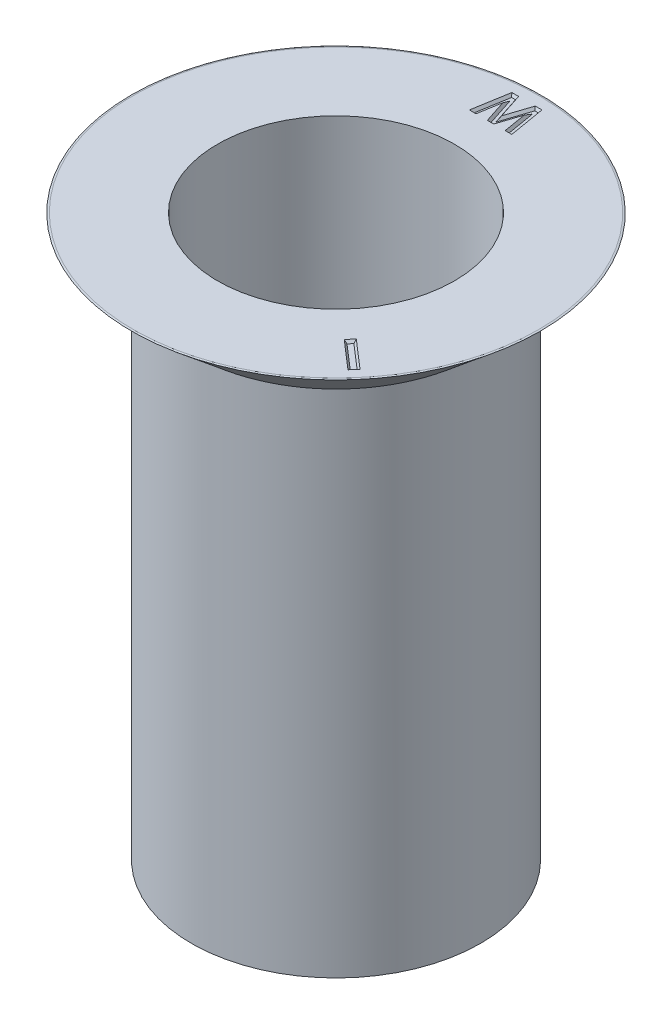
ISO-10303-21;
HEADER;
FILE_DESCRIPTION(('STEP AP214'),'2;1');
FILE_NAME('part.step','',(''),(''),'','','');
FILE_SCHEMA(('AUTOMOTIVE_DESIGN { 1 0 10303 214 1 1 1 1 }'));
ENDSEC;
DATA;
#1=APPLICATION_CONTEXT('core data for automotive mechanical design processes');
#2=APPLICATION_PROTOCOL_DEFINITION('international standard','automotive_design',2000,#1);
#3=PRODUCT_CONTEXT('',#1,'mechanical');
#4=PRODUCT('Part','Part','',(#3));
#5=PRODUCT_RELATED_PRODUCT_CATEGORY('part','',(#4));
#6=PRODUCT_DEFINITION_FORMATION('','',#4);
#7=PRODUCT_DEFINITION_CONTEXT('part definition',#1,'design');
#8=PRODUCT_DEFINITION('design','',#6,#7);
#9=PRODUCT_DEFINITION_SHAPE('','',#8);
#10=(LENGTH_UNIT() NAMED_UNIT(*) SI_UNIT(.MILLI.,.METRE.));
#11=(NAMED_UNIT(*) PLANE_ANGLE_UNIT() SI_UNIT($,.RADIAN.));
#12=(NAMED_UNIT(*) SI_UNIT($,.STERADIAN.) SOLID_ANGLE_UNIT());
#13=UNCERTAINTY_MEASURE_WITH_UNIT(LENGTH_MEASURE(1.E-05),#10,'distance_accuracy_value','');
#14=(GEOMETRIC_REPRESENTATION_CONTEXT(3) GLOBAL_UNCERTAINTY_ASSIGNED_CONTEXT((#13)) GLOBAL_UNIT_ASSIGNED_CONTEXT((#10,
#11,#12)) REPRESENTATION_CONTEXT('',''));
#15=CARTESIAN_POINT('',(0.,0.,0.));
#16=DIRECTION('',(0.,0.,1.));
#17=DIRECTION('',(1.,0.,0.));
#18=AXIS2_PLACEMENT_3D('',#15,#16,#17);
#19=CARTESIAN_POINT('',(-2.75034901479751,-1.82969337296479,3.52704224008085E-05));
#20=DIRECTION('',(0.,-1.,0.));
#21=DIRECTION('',(1.,0.,0.));
#22=AXIS2_PLACEMENT_3D('',#19,#20,#21);
#23=PLANE('',#22);
#24=DIRECTION('',(0.166512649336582,0.,-0.986039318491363));
#25=VECTOR('',#24,1.);
#26=CARTESIAN_POINT('',(-0.501665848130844,-1.82969337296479,-3.5336902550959));
#27=LINE('',#26,#25);
#28=CARTESIAN_POINT('',(-0.501665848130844,-1.82969337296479,-3.5336902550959));
#29=VERTEX_POINT('',#28);
#30=CARTESIAN_POINT('',(-0.362263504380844,-1.82969337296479,-4.3591902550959));
#31=VERTEX_POINT('',#30);
#32=EDGE_CURVE('E62',#29,#31,#27,.T.);
#33=ORIENTED_EDGE('',*,*,#32,.T.);
#34=DIRECTION('',(1.,0.,0.));
#35=VECTOR('',#34,1.);
#36=CARTESIAN_POINT('',(-0.362263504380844,-1.82969337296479,-4.3591902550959));
#37=LINE('',#36,#35);
#38=CARTESIAN_POINT('',(-0.208474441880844,-1.82969337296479,-4.3591902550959));
#39=VERTEX_POINT('',#38);
#40=EDGE_CURVE('E221',#31,#39,#37,.T.);
#41=ORIENTED_EDGE('',*,*,#40,.T.);
#42=DIRECTION('',(0.310900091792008,0.,0.950442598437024));
#43=VECTOR('',#42,1.);
#44=CARTESIAN_POINT('',(-0.208474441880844,-1.82969337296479,-4.3591902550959));
#45=LINE('',#44,#43);
#46=CARTESIAN_POINT('',(-0.0201241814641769,-1.82969337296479,-3.78339077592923));
#47=VERTEX_POINT('',#46);
#48=EDGE_CURVE('E224',#39,#47,#45,.T.);
#49=ORIENTED_EDGE('',*,*,#48,.T.);
#50=DIRECTION('',(0.312870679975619,0.,-0.949795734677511));
#51=VECTOR('',#50,1.);
#52=CARTESIAN_POINT('',(-0.0201241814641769,-1.82969337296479,-3.78339077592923));
#53=LINE('',#52,#51);
#54=CARTESIAN_POINT('',(0.169548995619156,-1.82969337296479,-4.3591902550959));
#55=VERTEX_POINT('',#54);
#56=EDGE_CURVE('E227',#47,#55,#53,.T.);
#57=ORIENTED_EDGE('',*,*,#56,.T.);
#58=DIRECTION('',(1.,0.,0.));
#59=VECTOR('',#58,1.);
#60=CARTESIAN_POINT('',(0.169548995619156,-1.82969337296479,-4.3591902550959));
#61=LINE('',#60,#59);
#62=CARTESIAN_POINT('',(0.321849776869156,-1.82969337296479,-4.3591902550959));
#63=VERTEX_POINT('',#62);
#64=EDGE_CURVE('E230',#55,#63,#61,.T.);
#65=ORIENTED_EDGE('',*,*,#64,.T.);
#66=DIRECTION('',(0.166704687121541,0.,0.98600686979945));
#67=VECTOR('',#66,1.);
#68=CARTESIAN_POINT('',(0.321849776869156,-1.82969337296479,-4.3591902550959));
#69=LINE('',#68,#67);
#70=CARTESIAN_POINT('',(0.46141748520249,-1.82969337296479,-3.5336902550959));
#71=VERTEX_POINT('',#70);
#72=EDGE_CURVE('E233',#63,#71,#69,.T.);
#73=ORIENTED_EDGE('',*,*,#72,.T.);
#74=DIRECTION('',(-1.,0.,0.));
#75=VECTOR('',#74,1.);
#76=CARTESIAN_POINT('',(0.46141748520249,-1.82969337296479,-3.5336902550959));
#77=LINE('',#76,#75);
#78=CARTESIAN_POINT('',(0.311431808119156,-1.82969337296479,-3.5336902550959));
#79=VERTEX_POINT('',#78);
#80=EDGE_CURVE('E236',#71,#79,#77,.T.);
#81=ORIENTED_EDGE('',*,*,#80,.T.);
#82=DIRECTION('',(-0.166680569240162,0.,-0.986010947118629));
#83=VECTOR('',#82,1.);
#84=CARTESIAN_POINT('',(0.311431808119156,-1.82969337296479,-3.5336902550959));
#85=LINE('',#84,#83);
#86=CARTESIAN_POINT('',(0.22329248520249,-1.82969337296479,-4.0550847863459));
#87=VERTEX_POINT('',#86);
#88=EDGE_CURVE('E239',#79,#87,#85,.T.);
#89=ORIENTED_EDGE('',*,*,#88,.T.);
#90=DIRECTION('',(-0.312700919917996,0.,0.949851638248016));
#91=VECTOR('',#90,1.);
#92=CARTESIAN_POINT('',(0.22329248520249,-1.82969337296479,-4.0550847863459));
#93=LINE('',#92,#91);
#94=CARTESIAN_POINT('',(0.0516440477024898,-1.82969337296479,-3.5336902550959));
#95=VERTEX_POINT('',#94);
#96=EDGE_CURVE('E242',#87,#95,#93,.T.);
#97=ORIENTED_EDGE('',*,*,#96,.T.);
#98=DIRECTION('',(-1.,0.,0.));
#99=VECTOR('',#98,1.);
#100=CARTESIAN_POINT('',(0.0516440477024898,-1.82969337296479,-3.5336902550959));
#101=LINE('',#100,#99);
#102=CARTESIAN_POINT('',(-0.0928845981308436,-1.82969337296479,-3.5336902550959));
#103=VERTEX_POINT('',#102);
#104=EDGE_CURVE('E245',#95,#103,#101,.T.);
#105=ORIENTED_EDGE('',*,*,#104,.T.);
#106=DIRECTION('',(-0.311068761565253,0.,-0.950387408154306));
#107=VECTOR('',#106,1.);
#108=CARTESIAN_POINT('',(-0.0928845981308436,-1.82969337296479,-3.5336902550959));
#109=LINE('',#108,#107);
#110=CARTESIAN_POINT('',(-0.263540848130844,-1.82969337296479,-4.0550847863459));
#111=VERTEX_POINT('',#110);
#112=EDGE_CURVE('E248',#103,#111,#109,.T.);
#113=ORIENTED_EDGE('',*,*,#112,.T.);
#114=DIRECTION('',(-0.166376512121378,0.,0.986062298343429));
#115=VECTOR('',#114,1.);
#116=CARTESIAN_POINT('',(-0.263540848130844,-1.82969337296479,-4.0550847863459));
#117=LINE('',#116,#115);
#118=CARTESIAN_POINT('',(-0.351514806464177,-1.82969337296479,-3.5336902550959));
#119=VERTEX_POINT('',#118);
#120=EDGE_CURVE('E251',#111,#119,#117,.T.);
#121=ORIENTED_EDGE('',*,*,#120,.T.);
#122=DIRECTION('',(-1.,0.,0.));
#123=VECTOR('',#122,1.);
#124=CARTESIAN_POINT('',(-0.351514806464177,-1.82969337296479,-3.5336902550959));
#125=LINE('',#124,#123);
#126=EDGE_CURVE('E254',#119,#29,#125,.T.);
#127=ORIENTED_EDGE('',*,*,#126,.T.);
#128=EDGE_LOOP('',(#33,#41,#49,#57,#65,#73,#81,#89,#97,#105,#113,#121,#127));
#129=FACE_BOUND('',#128,.T.);
#130=CARTESIAN_POINT('',(0.00104248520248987,-1.82969337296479,3.52704224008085E-05));
#131=DIRECTION('',(0.,-1.,0.));
#132=DIRECTION('',(1.,0.,0.));
#133=AXIS2_PLACEMENT_3D('',#130,#131,#132);
#134=CIRCLE('',#133,4.60629);
#135=CARTESIAN_POINT('',(4.60733248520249,-1.82969337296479,3.52704224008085E-05));
#136=VERTEX_POINT('',#135);
#137=EDGE_CURVE('E432',#136,#136,#134,.T.);
#138=ORIENTED_EDGE('',*,*,#137,.F.);
#139=EDGE_LOOP('',(#138));
#140=FACE_BOUND('',#139,.T.);
#141=CARTESIAN_POINT('',(0.00104248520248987,-1.82969337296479,3.52704224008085E-05));
#142=DIRECTION('',(0.,-1.,0.));
#143=DIRECTION('',(1.,0.,0.));
#144=AXIS2_PLACEMENT_3D('',#141,#142,#143);
#145=CIRCLE('',#144,2.6919555);
#146=CARTESIAN_POINT('',(2.69299798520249,-1.82969337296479,3.52704224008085E-05));
#147=VERTEX_POINT('',#146);
#148=EDGE_CURVE('E429',#147,#147,#145,.T.);
#149=ORIENTED_EDGE('',*,*,#148,.T.);
#150=EDGE_LOOP('',(#149));
#151=FACE_BOUND('',#150,.T.);
#152=DIRECTION('',(0.755766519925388,0.,0.654841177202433));
#153=VECTOR('',#152,1.);
#154=CARTESIAN_POINT('',(2.71997891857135,-1.82969337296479,2.25809990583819));
#155=LINE('',#154,#153);
#156=CARTESIAN_POINT('',(2.71997891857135,-1.82969337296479,2.25809990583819));
#157=VERTEX_POINT('',#156);
#158=CARTESIAN_POINT('',(3.35894766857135,-1.82969337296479,2.81174053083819));
#159=VERTEX_POINT('',#158);
#160=EDGE_CURVE('E54',#157,#159,#155,.T.);
#161=ORIENTED_EDGE('',*,*,#160,.T.);
#162=DIRECTION('',(-0.654638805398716,0.,0.755941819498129));
#163=VECTOR('',#162,1.);
#164=CARTESIAN_POINT('',(3.35894766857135,-1.82969337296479,2.81174053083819));
#165=LINE('',#164,#163);
#166=CARTESIAN_POINT('',(3.23178230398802,-1.82969337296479,2.95858428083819));
#167=VERTEX_POINT('',#166);
#168=EDGE_CURVE('E186',#159,#167,#165,.T.);
#169=ORIENTED_EDGE('',*,*,#168,.T.);
#170=DIRECTION('',(-0.755766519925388,0.,-0.654841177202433));
#171=VECTOR('',#170,1.);
#172=CARTESIAN_POINT('',(3.23178230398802,-1.82969337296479,2.95858428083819));
#173=LINE('',#172,#171);
#174=CARTESIAN_POINT('',(2.59281355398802,-1.82969337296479,2.40494365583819));
#175=VERTEX_POINT('',#174);
#176=EDGE_CURVE('E194',#167,#175,#173,.T.);
#177=ORIENTED_EDGE('',*,*,#176,.T.);
#178=DIRECTION('',(0.654638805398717,0.,-0.755941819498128));
#179=VECTOR('',#178,1.);
#180=CARTESIAN_POINT('',(2.59281355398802,-1.82969337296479,2.40494365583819));
#181=LINE('',#180,#179);
#182=EDGE_CURVE('E203',#175,#157,#181,.T.);
#183=ORIENTED_EDGE('',*,*,#182,.T.);
#184=EDGE_LOOP('',(#161,#169,#177,#183));
#185=FACE_BOUND('',#184,.T.);
#186=ADVANCED_FACE('F39',(#129,#140,#151,#185),#23,.F.);
#187=CARTESIAN_POINT('',(0.00104248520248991,-8.01846687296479,3.52704224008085E-05));
#188=DIRECTION('',(0.,1.,0.));
#189=DIRECTION('',(0.,0.,1.));
#190=AXIS2_PLACEMENT_3D('',#187,#188,#189);
#191=CONICAL_SURFACE('',#190,1.991106,0.785398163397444);
#192=CARTESIAN_POINT('',(0.00104248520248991,-7.52316687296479,3.52704224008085E-05));
#193=DIRECTION('',(0.,-1.,0.));
#194=DIRECTION('',(0.,0.,-1.));
#195=AXIS2_PLACEMENT_3D('',#192,#193,#194);
#196=CIRCLE('',#195,2.486406);
#197=CARTESIAN_POINT('',(0.00104248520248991,-7.52316687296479,-2.4863707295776));
#198=VERTEX_POINT('',#197);
#199=EDGE_CURVE('E417',#198,#198,#196,.T.);
#200=ORIENTED_EDGE('',*,*,#199,.F.);
#201=EDGE_LOOP('',(#200));
#202=FACE_BOUND('',#201,.T.);
#203=CARTESIAN_POINT('',(1.14280345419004,-8.01846687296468,-1.63118666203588));
#204=CARTESIAN_POINT('',(1.09870637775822,-8.0159711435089,-1.66510255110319));
#205=CARTESIAN_POINT('',(1.05312357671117,-8.01361553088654,-1.69703859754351));
#206=CARTESIAN_POINT('',(0.982878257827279,-8.01009005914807,-1.74200386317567));
#207=CARTESIAN_POINT('',(0.959152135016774,-8.00891626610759,-1.75650204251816));
#208=CARTESIAN_POINT('',(0.911128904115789,-8.0065372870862,-1.78452818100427));
#209=CARTESIAN_POINT('',(0.886831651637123,-8.00533209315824,-1.79805589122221));
#210=CARTESIAN_POINT('',(0.813188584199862,-8.00168817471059,-1.83710836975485));
#211=CARTESIAN_POINT('',(0.763037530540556,-7.99921841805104,-1.86113698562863));
#212=CARTESIAN_POINT('',(0.660955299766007,-7.99420915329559,-1.90503527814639));
#213=CARTESIAN_POINT('',(0.609023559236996,-7.99166962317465,-1.9249036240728));
#214=CARTESIAN_POINT('',(0.448752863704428,-7.98386340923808,-1.97882378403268));
#215=CARTESIAN_POINT('',(0.338033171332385,-7.97851285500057,-2.00607720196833));
#216=CARTESIAN_POINT('',(0.113688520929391,-7.96775856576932,-2.04183102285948));
#217=CARTESIAN_POINT('',(6.35618298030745E-05,-7.96235483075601,-2.050331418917));
#218=CARTESIAN_POINT('',(-0.228643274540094,-7.95156367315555,-2.04834005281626));
#219=CARTESIAN_POINT('',(-0.343724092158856,-7.94617745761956,-2.03759011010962));
#220=CARTESIAN_POINT('',(-0.513643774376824,-7.9382824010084,-2.00711818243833));
#221=CARTESIAN_POINT('',(-0.569856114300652,-7.93568038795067,-1.99456153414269));
#222=CARTESIAN_POINT('',(-0.681036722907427,-7.93055475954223,-1.96475083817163));
#223=CARTESIAN_POINT('',(-0.736005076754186,-7.92803113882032,-1.94749711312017));
#224=CARTESIAN_POINT('',(-0.844249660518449,-7.9230700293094,-1.90844021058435));
#225=CARTESIAN_POINT('',(-0.897527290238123,-7.92063246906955,-1.88664091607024));
#226=CARTESIAN_POINT('',(-1.00204825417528,-7.91589849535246,-1.8386011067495));
#227=CARTESIAN_POINT('',(-1.05329144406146,-7.91360209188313,-1.81236027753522));
#228=CARTESIAN_POINT('',(-1.15350984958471,-7.90891443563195,-1.7558346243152));
#229=CARTESIAN_POINT('',(-1.20248442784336,-7.90652315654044,-1.72554867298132));
#230=CARTESIAN_POINT('',(-1.29782666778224,-7.90166292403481,-1.6611484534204));
#231=CARTESIAN_POINT('',(-1.34419434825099,-7.89919397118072,-1.62703421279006));
#232=CARTESIAN_POINT('',(-1.48138459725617,-7.89156021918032,-1.5172948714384));
#233=CARTESIAN_POINT('',(-1.56760901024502,-7.88629411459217,-1.43578287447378));
#234=CARTESIAN_POINT('',(-1.72539261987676,-7.87566066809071,-1.25971316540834));
#235=CARTESIAN_POINT('',(-1.79695258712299,-7.87029333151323,-1.16515613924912));
#236=CARTESIAN_POINT('',(-1.9248044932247,-7.85949442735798,-0.963528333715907));
#237=CARTESIAN_POINT('',(-1.98075976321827,-7.85406374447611,-0.856243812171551));
#238=CARTESIAN_POINT('',(-2.07384287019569,-7.84339442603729,-0.633742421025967));
#239=CARTESIAN_POINT('',(-2.11097333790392,-7.83815576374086,-0.518526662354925));
#240=CARTESIAN_POINT('',(-2.15174548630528,-7.83055460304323,-0.342406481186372));
#241=CARTESIAN_POINT('',(-2.16284967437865,-7.82806321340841,-0.283138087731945));
#242=CARTESIAN_POINT('',(-2.180034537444,-7.82317480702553,-0.163849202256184));
#243=CARTESIAN_POINT('',(-2.1861152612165,-7.82077778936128,-0.103828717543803));
#244=CARTESIAN_POINT('',(-2.191418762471,-7.8172765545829,-0.0135831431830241));
#245=CARTESIAN_POINT('',(-2.19255014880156,-7.81612493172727,0.0165416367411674));
#246=CARTESIAN_POINT('',(-2.19360222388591,-7.81379211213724,0.076811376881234));
#247=CARTESIAN_POINT('',(-2.19352290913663,-7.81261091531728,0.106956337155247));
#248=CARTESIAN_POINT('',(-2.19145832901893,-7.80903517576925,0.197349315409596));
#249=CARTESIAN_POINT('',(-2.18764691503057,-7.80660816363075,0.257563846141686));
#250=CARTESIAN_POINT('',(-2.17506461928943,-7.80163562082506,0.378595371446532));
#251=CARTESIAN_POINT('',(-2.16620313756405,-7.79908872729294,0.439402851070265));
#252=CARTESIAN_POINT('',(-2.14352291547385,-7.79393987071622,0.560066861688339));
#253=CARTESIAN_POINT('',(-2.12970439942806,-7.79133791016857,0.619923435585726));
#254=CARTESIAN_POINT('',(-2.08093178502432,-7.78347632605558,0.797464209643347));
#255=CARTESIAN_POINT('',(-2.03864978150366,-7.77815674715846,0.913222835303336));
#256=CARTESIAN_POINT('',(-1.93434277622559,-7.76737560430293,1.13916023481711));
#257=CARTESIAN_POINT('',(-1.87182462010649,-7.76191401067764,1.2491100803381));
#258=CARTESIAN_POINT('',(-1.72922684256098,-7.75113916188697,1.45693128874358));
#259=CARTESIAN_POINT('',(-1.64914962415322,-7.74582588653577,1.5548043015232));
#260=CARTESIAN_POINT('',(-1.4736141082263,-7.73549142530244,1.73573846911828));
#261=CARTESIAN_POINT('',(-1.37815945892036,-7.7304701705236,1.8188031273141));
#262=CARTESIAN_POINT('',(-1.25113552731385,-7.72445171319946,1.91179542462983));
#263=CARTESIAN_POINT('',(-1.22531777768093,-7.72325970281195,1.92986991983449));
#264=CARTESIAN_POINT('',(-1.17293856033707,-7.72091311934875,1.96490713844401));
#265=CARTESIAN_POINT('',(-1.14637722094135,-7.71975853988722,1.98187005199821));
#266=CARTESIAN_POINT('',(-1.06569036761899,-7.71626115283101,2.03112520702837));
#267=CARTESIAN_POINT('',(-1.01056031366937,-7.71388462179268,2.06178510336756));
#268=CARTESIAN_POINT('',(-0.897400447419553,-7.70901940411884,2.11885521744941));
#269=CARTESIAN_POINT('',(-0.839345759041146,-7.70652978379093,2.14521599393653));
#270=CARTESIAN_POINT('',(-0.721298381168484,-7.70148535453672,2.19310341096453));
#271=CARTESIAN_POINT('',(-0.661305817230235,-7.69893054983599,2.21463036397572));
#272=CARTESIAN_POINT('',(-0.478992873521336,-7.69119319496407,2.2717318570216));
#273=CARTESIAN_POINT('',(-0.354250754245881,-7.68593398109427,2.29987056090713));
#274=CARTESIAN_POINT('',(-0.0978642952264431,-7.67519958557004,2.33601688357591));
#275=CARTESIAN_POINT('',(0.0338730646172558,-7.66972289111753,2.34334918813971));
#276=CARTESIAN_POINT('',(0.29677417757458,-7.65886916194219,2.33575338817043));
#277=CARTESIAN_POINT('',(0.42793800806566,-7.65349211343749,2.3208283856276));
#278=CARTESIAN_POINT('',(0.621271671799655,-7.64561745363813,2.28212575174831));
#279=CARTESIAN_POINT('',(0.685173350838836,-7.6430233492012,2.26649580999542));
#280=CARTESIAN_POINT('',(0.811448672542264,-7.63791408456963,2.22990401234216));
#281=CARTESIAN_POINT('',(0.873822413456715,-7.63539891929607,2.20894250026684));
#282=CARTESIAN_POINT('',(0.996596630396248,-7.63046009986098,2.16183307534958));
#283=CARTESIAN_POINT('',(1.05699664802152,-7.6280364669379,2.13568396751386));
#284=CARTESIAN_POINT('',(1.17537769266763,-7.6233110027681,2.07837633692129));
#285=CARTESIAN_POINT('',(1.23335851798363,-7.62100918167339,2.04721739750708));
#286=CARTESIAN_POINT('',(1.34683504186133,-7.61627524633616,1.98020386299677));
#287=CARTESIAN_POINT('',(1.40232036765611,-7.61384266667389,1.94433173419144));
#288=CARTESIAN_POINT('',(1.51019405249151,-7.60890748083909,1.8681935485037));
#289=CARTESIAN_POINT('',(1.56258142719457,-7.60640485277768,1.827926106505));
#290=CARTESIAN_POINT('',(1.71453461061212,-7.59880722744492,1.70094543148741));
#291=CARTESIAN_POINT('',(1.80899975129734,-7.59361795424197,1.60798979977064));
#292=CARTESIAN_POINT('',(1.98478431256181,-7.58295433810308,1.40431605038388));
#293=CARTESIAN_POINT('',(2.06548358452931,-7.57747657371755,1.2930655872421));
#294=CARTESIAN_POINT('',(2.20704281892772,-7.56657582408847,1.0585714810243));
#295=CARTESIAN_POINT('',(2.26790805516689,-7.56115282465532,0.93533103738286));
#296=CARTESIAN_POINT('',(2.35512051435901,-7.55188837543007,0.71336898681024));
#297=CARTESIAN_POINT('',(2.38632176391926,-7.54799978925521,0.616522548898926));
#298=CARTESIAN_POINT('',(2.4363942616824,-7.54039512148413,0.41980084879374));
#299=CARTESIAN_POINT('',(2.45527903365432,-7.53667885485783,0.319929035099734));
#300=CARTESIAN_POINT('',(2.46782392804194,-7.53307287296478,0.219219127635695));
#301=B_SPLINE_CURVE_WITH_KNOTS('',3,(#203,#204,#205,#206,#207,#208,#209,#210,#211,#212,#213,
#214,#215,#216,#217,#218,#219,#220,#221,#222,#223,#224,#225,#226,#227,#228,#229,#230,#231,#232,
#233,#234,#235,#236,#237,#238,#239,#240,#241,#242,#243,#244,#245,#246,#247,#248,#249,#250,#251,
#252,#253,#254,#255,#256,#257,#258,#259,#260,#261,#262,#263,#264,#265,#266,#267,#268,#269,#270,
#271,#272,#273,#274,#275,#276,#277,#278,#279,#280,#281,#282,#283,#284,#285,#286,#287,#288,#289,
#290,#291,#292,#293,#294,#295,#296,#297,#298,#299,#300),.UNSPECIFIED.,.F.,.F.,(4,2,2,2,2,2,2,2,
2,2,2,2,2,2,2,2,2,2,2,2,2,2,2,2,2,2,2,2,2,2,2,2,2,2,2,2,2,2,2,2,2,2,2,2,2,2,2,2,4),(0.,
0.166944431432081,0.250410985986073,0.333898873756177,0.500682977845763,0.667520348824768,
1.00823434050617,1.34894845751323,1.69426641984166,1.86706848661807,2.03985868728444,
2.21250188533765,2.38515730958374,2.55786095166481,2.73056334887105,3.08510919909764,
3.43963641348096,3.80130663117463,4.16292629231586,4.34380884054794,4.52468963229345,
4.61517262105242,4.70565587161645,4.88659714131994,5.07089161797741,5.25517775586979,
5.6234417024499,6.00145743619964,6.37942146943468,6.7572959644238,6.85189655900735,
6.94648092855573,7.13564335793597,7.32684753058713,7.51803933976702,7.90013571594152,
8.29449933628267,8.68880799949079,8.8861261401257,9.08343155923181,9.28078248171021,
9.4781498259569,9.67627337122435,9.87445953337,10.2704586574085,10.6811968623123,
11.0918257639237,11.3965370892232,11.7009132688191),.UNSPECIFIED.);
#302=CARTESIAN_POINT('',(1.14280345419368,-8.01846687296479,-1.63118666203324));
#303=VERTEX_POINT('',#302);
#304=CARTESIAN_POINT('',(2.46782392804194,-7.53307287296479,0.219219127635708));
#305=VERTEX_POINT('',#304);
#306=EDGE_CURVE('E412',#303,#305,#301,.T.);
#307=ORIENTED_EDGE('',*,*,#306,.F.);
#308=CARTESIAN_POINT('',(0.00104248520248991,-8.01846687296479,3.52704224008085E-05));
#309=DIRECTION('',(0.,-1.,0.));
#310=DIRECTION('',(0.,0.,-1.));
#311=AXIS2_PLACEMENT_3D('',#308,#309,#310);
#312=CIRCLE('',#311,1.991106);
#313=CARTESIAN_POINT('',(1.99214848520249,-8.01846687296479,3.52704224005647E-05));
#314=VERTEX_POINT('',#313);
#315=EDGE_CURVE('E426',#303,#314,#312,.T.);
#316=ORIENTED_EDGE('',*,*,#315,.T.);
#317=CARTESIAN_POINT('',(1.51138887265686,-7.53307287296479,-1.96259206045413));
#318=CARTESIAN_POINT('',(1.54686828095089,-7.54400514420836,-1.92149463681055));
#319=CARTESIAN_POINT('',(1.58082409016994,-7.55513515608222,-1.87915690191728));
#320=CARTESIAN_POINT('',(1.64553687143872,-7.57776626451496,-1.79220660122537));
#321=CARTESIAN_POINT('',(1.67629426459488,-7.58926731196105,-1.74759433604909));
#322=CARTESIAN_POINT('',(1.76352466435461,-7.62428270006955,-1.61068499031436));
#323=CARTESIAN_POINT('',(1.81499304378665,-7.64832068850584,-1.51527225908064));
#324=CARTESIAN_POINT('',(1.91153759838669,-7.702001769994,-1.30011228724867));
#325=CARTESIAN_POINT('',(1.9537100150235,-7.7318642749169,-1.17911146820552));
#326=CARTESIAN_POINT('',(2.01651399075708,-7.79254558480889,-0.931865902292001));
#327=CARTESIAN_POINT('',(2.03714326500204,-7.82336449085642,-0.805620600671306));
#328=CARTESIAN_POINT('',(2.05524014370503,-7.88193980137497,-0.565024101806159));
#329=CARTESIAN_POINT('',(2.05493677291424,-7.90967349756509,-0.450835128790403));
#330=CARTESIAN_POINT('',(2.04125793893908,-7.95089110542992,-0.280595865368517));
#331=CARTESIAN_POINT('',(2.0344881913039,-7.96457270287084,-0.223997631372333));
#332=CARTESIAN_POINT('',(2.01658178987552,-7.99171170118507,-0.11143542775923));
#333=CARTESIAN_POINT('',(2.00544468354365,-8.00516907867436,-0.0554715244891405));
#334=CARTESIAN_POINT('',(1.99214848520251,-8.01846687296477,3.52704224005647E-05));
#335=B_SPLINE_CURVE_WITH_KNOTS('',3,(#317,#318,#319,#320,#321,#322,#323,#324,#325,#326,#327,
#328,#329,#330,#331,#332,#333,#334),.UNSPECIFIED.,.F.,.F.,(4,2,2,2,2,2,2,2,4),(0.,
0.166081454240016,0.332141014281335,0.664087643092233,1.05691670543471,1.4497874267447,
1.80089507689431,1.97661095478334,2.15234504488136),.UNSPECIFIED.);
#336=CARTESIAN_POINT('',(1.51138887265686,-7.53307287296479,-1.96259206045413));
#337=VERTEX_POINT('',#336);
#338=EDGE_CURVE('E341',#337,#314,#335,.T.);
#339=ORIENTED_EDGE('',*,*,#338,.F.);
#340=CARTESIAN_POINT('',(0.00104248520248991,-7.53307287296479,3.52704224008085E-05));
#341=DIRECTION('',(0.,1.,0.));
#342=DIRECTION('',(0.,0.,1.));
#343=AXIS2_PLACEMENT_3D('',#340,#341,#342);
#344=CIRCLE('',#343,2.4765);
#345=EDGE_CURVE('E352',#305,#337,#344,.T.);
#346=ORIENTED_EDGE('',*,*,#345,.F.);
#347=EDGE_LOOP('',(#307,#316,#339,#346));
#348=FACE_BOUND('',#347,.T.);
#349=ADVANCED_FACE('F354',(#202,#348),#191,.F.);
#350=CARTESIAN_POINT('',(0.00104248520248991,-14.5688093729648,3.52704224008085E-05));
#351=DIRECTION('',(0.,-1.,0.));
#352=DIRECTION('',(0.,0.,-1.));
#353=AXIS2_PLACEMENT_3D('',#350,#351,#352);
#354=CYLINDRICAL_SURFACE('',#353,1.991106);
#355=CARTESIAN_POINT('',(-1.99006351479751,-6.68491779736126,3.52704224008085E-05));
#356=CARTESIAN_POINT('',(-1.99006351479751,-6.76746779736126,-1.14953031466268));
#357=CARTESIAN_POINT('',(-0.99451051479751,-6.85001779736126,-1.72431310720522));
#358=CARTESIAN_POINT('',(0.00104248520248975,-6.93256779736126,-2.29909589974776));
#359=CARTESIAN_POINT('',(0.996595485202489,-7.01511779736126,-1.72431310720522));
#360=CARTESIAN_POINT('',(1.99214848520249,-7.09766779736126,-1.14953031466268));
#361=CARTESIAN_POINT('',(1.99214848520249,-7.18021779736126,3.52704224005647E-05));
#362=CARTESIAN_POINT('',(1.99214848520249,-7.26276779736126,1.14960085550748));
#363=CARTESIAN_POINT('',(0.99659548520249,-7.34531779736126,1.72438364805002));
#364=CARTESIAN_POINT('',(0.00104248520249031,-7.42786779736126,2.29916644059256));
#365=CARTESIAN_POINT('',(-0.994510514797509,-7.51041779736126,1.72438364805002));
#366=CARTESIAN_POINT('',(-1.99006351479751,-7.59296779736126,1.14960085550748));
#367=CARTESIAN_POINT('',(-1.99006351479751,-7.67551779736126,3.52704224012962E-05));
#368=CARTESIAN_POINT('',(-1.99006351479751,-7.75806779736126,-1.14953031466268));
#369=CARTESIAN_POINT('',(-0.994510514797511,-7.84061779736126,-1.72431310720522));
#370=CARTESIAN_POINT('',(0.00104248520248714,-7.92316779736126,-2.29909589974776));
#371=CARTESIAN_POINT('',(0.996595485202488,-8.00571779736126,-1.72431310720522));
#372=CARTESIAN_POINT('',(1.99214848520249,-8.08826779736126,-1.14953031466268));
#373=CARTESIAN_POINT('',(1.99214848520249,-8.17081779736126,3.5270422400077E-05));
#374=CARTESIAN_POINT('',(1.99214848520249,-8.25336779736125,1.14960085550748));
#375=CARTESIAN_POINT('',(0.996595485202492,-8.33591779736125,1.72438364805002));
#376=CARTESIAN_POINT('',(0.00104248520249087,-8.41846779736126,2.29916644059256));
#377=CARTESIAN_POINT('',(-0.994510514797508,-8.50101779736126,1.72438364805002));
#378=CARTESIAN_POINT('',(-1.99006351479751,-8.58356779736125,1.14960085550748));
#379=CARTESIAN_POINT('',(-1.99006351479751,-8.66611779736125,3.52704224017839E-05));
#380=CARTESIAN_POINT('',(-1.99006351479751,-8.74866779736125,-1.14953031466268));
#381=CARTESIAN_POINT('',(-0.994510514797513,-8.83121779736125,-1.72431310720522));
#382=CARTESIAN_POINT('',(0.00104248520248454,-8.91376779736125,-2.29909589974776));
#383=CARTESIAN_POINT('',(0.996595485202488,-8.99631779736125,-1.72431310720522));
#384=CARTESIAN_POINT('',(1.99214848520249,-9.07886779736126,-1.14953031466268));
#385=CARTESIAN_POINT('',(1.99214848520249,-9.16141779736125,3.52704223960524E-05));
#386=CARTESIAN_POINT('',(1.99214848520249,-9.24396779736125,1.14960085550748));
#387=CARTESIAN_POINT('',(0.996595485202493,-9.32651779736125,1.72438364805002));
#388=CARTESIAN_POINT('',(0.00104248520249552,-9.40906779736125,2.29916644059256));
#389=CARTESIAN_POINT('',(-0.994510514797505,-9.49161779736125,1.72438364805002));
#390=CARTESIAN_POINT('',(-1.99006351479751,-9.57416779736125,1.14960085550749));
#391=CARTESIAN_POINT('',(-1.99006351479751,-9.65671779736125,3.52704224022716E-05));
#392=CARTESIAN_POINT('',(-1.99006351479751,-9.73926779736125,-1.14953031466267));
#393=CARTESIAN_POINT('',(-0.994510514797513,-9.82181779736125,-1.72431310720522));
#394=CARTESIAN_POINT('',(0.00104248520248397,-9.90436779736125,-2.29909589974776));
#395=CARTESIAN_POINT('',(0.996595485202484,-9.98691779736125,-1.72431310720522));
#396=CARTESIAN_POINT('',(1.99214848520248,-10.0694677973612,-1.14953031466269));
#397=CARTESIAN_POINT('',(1.99214848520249,-10.1520177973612,3.52704223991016E-05));
#398=CARTESIAN_POINT('',(1.99214848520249,-10.2345677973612,1.14960085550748));
#399=CARTESIAN_POINT('',(0.996595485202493,-10.3171177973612,1.72438364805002));
#400=CARTESIAN_POINT('',(0.00104248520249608,-10.3996677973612,2.29916644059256));
#401=CARTESIAN_POINT('',(-0.994510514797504,-10.4822177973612,1.72438364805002));
#402=CARTESIAN_POINT('',(-1.99006351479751,-10.5647677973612,1.14960085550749));
#403=CARTESIAN_POINT('',(-1.99006351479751,-10.6473177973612,3.52704224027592E-05));
#404=CARTESIAN_POINT('',(-1.99006351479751,-10.7298677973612,-1.14953031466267));
#405=CARTESIAN_POINT('',(-0.994510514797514,-10.8124177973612,-1.72431310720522));
#406=CARTESIAN_POINT('',(0.00104248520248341,-10.8949677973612,-2.29909589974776));
#407=CARTESIAN_POINT('',(0.996595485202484,-10.9775177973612,-1.72431310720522));
#408=CARTESIAN_POINT('',(1.99214848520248,-11.0600677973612,-1.14953031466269));
#409=CARTESIAN_POINT('',(1.99214848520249,-11.1426177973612,3.52704223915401E-05));
#410=CARTESIAN_POINT('',(1.99214848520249,-11.2251677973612,1.14960085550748));
#411=CARTESIAN_POINT('',(0.996595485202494,-11.3077177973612,1.72438364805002));
#412=CARTESIAN_POINT('',(0.00104248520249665,-11.3902677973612,2.29916644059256));
#413=CARTESIAN_POINT('',(-0.994510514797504,-11.4728177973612,1.72438364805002));
#414=CARTESIAN_POINT('',(-1.99006351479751,-11.5553677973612,1.14960085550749));
#415=CARTESIAN_POINT('',(-1.99006351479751,-11.6379177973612,3.52704224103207E-05));
#416=CARTESIAN_POINT('',(-1.99006351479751,-11.7204677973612,-1.14953031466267));
#417=CARTESIAN_POINT('',(-0.994510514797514,-11.8030177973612,-1.72431310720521));
#418=CARTESIAN_POINT('',(0.00104248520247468,-11.8855677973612,-2.29909589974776));
#419=CARTESIAN_POINT('',(0.996595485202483,-11.9681177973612,-1.72431310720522));
#420=CARTESIAN_POINT('',(1.99214848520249,-12.0506677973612,-1.14953031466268));
#421=CARTESIAN_POINT('',(1.99214848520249,-12.1332177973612,3.52704223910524E-05));
#422=CARTESIAN_POINT('',(1.99214848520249,-12.2157677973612,1.14960085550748));
#423=CARTESIAN_POINT('',(0.9965954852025,-12.2983177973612,1.72438364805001));
#424=CARTESIAN_POINT('',(0.00104248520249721,-12.3808677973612,2.29916644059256));
#425=CARTESIAN_POINT('',(-0.994510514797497,-12.4634177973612,1.72438364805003));
#426=CARTESIAN_POINT('',(-1.9900635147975,-12.5459677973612,1.14960085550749));
#427=CARTESIAN_POINT('',(-1.99006351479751,-12.6285177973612,3.52704224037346E-05));
#428=CARTESIAN_POINT('',(-1.99006351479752,-12.7110677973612,-1.14953031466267));
#429=CARTESIAN_POINT('',(-0.994510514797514,-12.7936177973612,-1.72431310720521));
#430=CARTESIAN_POINT('',(0.00104248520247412,-12.8761677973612,-2.29909589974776));
#431=CARTESIAN_POINT('',(0.996595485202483,-12.9587177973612,-1.72431310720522));
#432=CARTESIAN_POINT('',(1.99214848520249,-13.0412677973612,-1.14953031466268));
#433=CARTESIAN_POINT('',(1.99214848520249,-13.1238177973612,3.52704223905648E-05));
#434=CARTESIAN_POINT('',(1.99214848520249,-13.2063677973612,1.14960085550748));
#435=CARTESIAN_POINT('',(0.996595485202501,-13.2889177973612,1.72438364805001));
#436=CARTESIAN_POINT('',(0.00104248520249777,-13.3714677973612,2.29916644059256));
#437=CARTESIAN_POINT('',(-0.994510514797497,-13.4540177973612,1.72438364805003));
#438=CARTESIAN_POINT('',(-1.9900635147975,-13.5365677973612,1.14960085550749));
#439=CARTESIAN_POINT('',(-1.99006351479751,-13.6191177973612,3.52704224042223E-05));
#440=CARTESIAN_POINT('',(-1.99006351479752,-13.7016677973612,-1.14953031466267));
#441=CARTESIAN_POINT('',(-0.994510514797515,-13.7842177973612,-1.72431310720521));
#442=CARTESIAN_POINT('',(0.00104248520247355,-13.8667677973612,-2.29909589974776));
#443=CARTESIAN_POINT('',(0.996595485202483,-13.9493177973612,-1.72431310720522));
#444=CARTESIAN_POINT('',(1.99214848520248,-14.0318677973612,-1.14953031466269));
#445=CARTESIAN_POINT('',(1.99214848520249,-14.1144177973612,3.52704223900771E-05));
#446=CARTESIAN_POINT('',(1.99214848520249,-14.1969677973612,1.14960085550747));
#447=CARTESIAN_POINT('',(0.996595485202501,-14.2795177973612,1.72438364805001));
#448=CARTESIAN_POINT('',(0.00104248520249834,-14.3620677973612,2.29916644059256));
#449=CARTESIAN_POINT('',(-0.994510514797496,-14.4446177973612,1.72438364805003));
#450=CARTESIAN_POINT('',(-1.9900635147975,-14.5271677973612,1.14960085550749));
#451=CARTESIAN_POINT('',(-1.99006351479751,-14.6097177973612,3.52704224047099E-05));
#452=CARTESIAN_POINT('',(-1.99006351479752,-14.6922677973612,-1.14953031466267));
#453=CARTESIAN_POINT('',(-0.994510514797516,-14.7748177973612,-1.72431310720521));
#454=CARTESIAN_POINT('',(0.00104248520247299,-14.8573677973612,-2.29909589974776));
#455=CARTESIAN_POINT('',(0.996595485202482,-14.9399177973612,-1.72431310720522));
#456=CARTESIAN_POINT('',(1.99214848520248,-15.0224677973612,-1.14953031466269));
#457=CARTESIAN_POINT('',(1.99214848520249,-15.1050177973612,3.52704223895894E-05));
#458=CARTESIAN_POINT('',(1.99214848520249,-15.1875677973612,1.14960085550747));
#459=CARTESIAN_POINT('',(0.996595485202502,-15.2701177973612,1.72438364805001));
#460=CARTESIAN_POINT('',(0.0010424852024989,-15.3526677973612,2.29916644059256));
#461=CARTESIAN_POINT('',(-0.994510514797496,-15.4352177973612,1.72438364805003));
#462=CARTESIAN_POINT('',(-1.9900635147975,-15.5177677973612,1.14960085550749));
#463=CARTESIAN_POINT('',(-1.99006351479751,-15.6003177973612,3.52704224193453E-05));
#464=(BOUNDED_CURVE() B_SPLINE_CURVE(2,(#355,#356,#357,#358,#359,#360,#361,#362,#363,#364,#365,
#366,#367,#368,#369,#370,#371,#372,#373,#374,#375,#376,#377,#378,#379,#380,#381,#382,#383,#384,
#385,#386,#387,#388,#389,#390,#391,#392,#393,#394,#395,#396,#397,#398,#399,#400,#401,#402,#403,
#404,#405,#406,#407,#408,#409,#410,#411,#412,#413,#414,#415,#416,#417,#418,#419,#420,#421,#422,
#423,#424,#425,#426,#427,#428,#429,#430,#431,#432,#433,#434,#435,#436,#437,#438,#439,#440,#441,
#442,#443,#444,#445,#446,#447,#448,#449,#450,#451,#452,#453,#454,#455,#456,#457,#458,#459,#460,
#461,#462,#463),.UNSPECIFIED.,.F.,.F.) B_SPLINE_CURVE_WITH_KNOTS((3,2,2,2,2,2,2,2,2,2,2,2,2,2,2,
2,2,2,2,2,2,2,2,2,2,2,2,2,2,2,2,2,2,2,2,2,2,2,2,2,2,2,2,2,2,2,2,2,2,2,2,2,2,2,3),(0.,
0.0185185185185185,0.037037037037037,0.0555555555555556,0.0740740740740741,0.0925925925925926,
0.111111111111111,0.12962962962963,0.148148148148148,0.166666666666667,0.185185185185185,
0.203703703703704,0.222222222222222,0.240740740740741,0.259259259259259,0.277777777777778,
0.296296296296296,0.314814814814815,0.333333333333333,0.351851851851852,0.37037037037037,
0.388888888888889,0.407407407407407,0.425925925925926,0.444444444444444,0.462962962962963,
0.481481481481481,0.5,0.518518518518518,0.537037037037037,0.555555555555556,0.574074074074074,
0.592592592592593,0.611111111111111,0.62962962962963,0.648148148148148,0.666666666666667,
0.685185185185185,0.703703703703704,0.722222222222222,0.740740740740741,0.759259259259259,
0.777777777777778,0.796296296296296,0.814814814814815,0.833333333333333,0.851851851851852,
0.87037037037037,0.888888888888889,0.907407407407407,0.925925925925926,0.944444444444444,
0.962962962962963,0.981481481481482,1.),
.UNSPECIFIED.) CURVE() GEOMETRIC_REPRESENTATION_ITEM() RATIONAL_B_SPLINE_CURVE((1.,
0.866025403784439,1.,0.866025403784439,1.,0.866025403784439,1.,0.866025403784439,1.,
0.866025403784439,1.,0.866025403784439,1.,0.866025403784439,1.,0.866025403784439,1.,
0.866025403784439,1.,0.866025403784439,1.,0.866025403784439,1.,0.866025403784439,1.,
0.866025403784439,1.,0.866025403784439,1.,0.866025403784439,1.,0.866025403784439,1.,
0.866025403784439,1.,0.866025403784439,1.,0.866025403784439,1.,0.866025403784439,1.,
0.866025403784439,1.,0.866025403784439,1.,0.866025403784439,1.,0.866025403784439,1.,
0.866025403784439,1.,0.866025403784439,1.,0.866025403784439,1.,0.866025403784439,1.,
0.866025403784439,1.,0.866025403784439,1.,0.866025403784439,1.,0.866025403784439,1.,
0.866025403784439,1.,0.866025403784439,1.,0.866025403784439,1.,0.866025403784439,1.,
0.866025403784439,1.,0.866025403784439,1.,0.866025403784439,1.,0.866025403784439,1.,
0.866025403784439,1.,0.866025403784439,1.,0.866025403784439,1.,0.866025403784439,1.,
0.866025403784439,1.,0.866025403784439,1.,0.866025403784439,1.,0.866025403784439,1.,
0.866025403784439,1.,0.866025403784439,1.,0.866025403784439,1.,0.866025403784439,1.,
0.866025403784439,1.,0.866025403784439,1.)) REPRESENTATION_ITEM(''));
#465=CARTESIAN_POINT('',(1.92074109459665,-14.0735093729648,-0.528415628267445));
#466=VERTEX_POINT('',#465);
#467=EDGE_CURVE('E260',#303,#466,#464,.T.);
#468=ORIENTED_EDGE('',*,*,#467,.T.);
#469=CARTESIAN_POINT('',(0.00104248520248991,-14.0735093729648,3.52704224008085E-05));
#470=DIRECTION('',(0.,-1.,0.));
#471=DIRECTION('',(0.,0.,-1.));
#472=AXIS2_PLACEMENT_3D('',#469,#470,#471);
#473=CIRCLE('',#472,1.991106);
#474=CARTESIAN_POINT('',(1.52455969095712,-14.0735093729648,1.28198629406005));
#475=VERTEX_POINT('',#474);
#476=EDGE_CURVE('E423',#466,#475,#473,.T.);
#477=ORIENTED_EDGE('',*,*,#476,.T.);
#478=CARTESIAN_POINT('',(-1.99006351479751,-7.52316687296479,3.52704224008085E-05));
#479=CARTESIAN_POINT('',(-1.99006351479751,-7.60571687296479,-1.14953031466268));
#480=CARTESIAN_POINT('',(-0.99451051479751,-7.68826687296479,-1.72431310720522));
#481=CARTESIAN_POINT('',(0.00104248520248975,-7.77081687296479,-2.29909589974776));
#482=CARTESIAN_POINT('',(0.996595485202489,-7.85336687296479,-1.72431310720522));
#483=CARTESIAN_POINT('',(1.99214848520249,-7.93591687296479,-1.14953031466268));
#484=CARTESIAN_POINT('',(1.99214848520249,-8.01846687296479,3.52704224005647E-05));
#485=CARTESIAN_POINT('',(1.99214848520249,-8.10101687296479,1.14960085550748));
#486=CARTESIAN_POINT('',(0.99659548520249,-8.18356687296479,1.72438364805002));
#487=CARTESIAN_POINT('',(0.00104248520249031,-8.26611687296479,2.29916644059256));
#488=CARTESIAN_POINT('',(-0.994510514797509,-8.34866687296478,1.72438364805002));
#489=CARTESIAN_POINT('',(-1.99006351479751,-8.43121687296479,1.14960085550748));
#490=CARTESIAN_POINT('',(-1.99006351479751,-8.51376687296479,3.52704224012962E-05));
#491=CARTESIAN_POINT('',(-1.99006351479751,-8.59631687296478,-1.14953031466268));
#492=CARTESIAN_POINT('',(-0.994510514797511,-8.67886687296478,-1.72431310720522));
#493=CARTESIAN_POINT('',(0.00104248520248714,-8.76141687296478,-2.29909589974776));
#494=CARTESIAN_POINT('',(0.996595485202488,-8.84396687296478,-1.72431310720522));
#495=CARTESIAN_POINT('',(1.99214848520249,-8.92651687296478,-1.14953031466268));
#496=CARTESIAN_POINT('',(1.99214848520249,-9.00906687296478,3.5270422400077E-05));
#497=CARTESIAN_POINT('',(1.99214848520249,-9.09161687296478,1.14960085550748));
#498=CARTESIAN_POINT('',(0.996595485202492,-9.17416687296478,1.72438364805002));
#499=CARTESIAN_POINT('',(0.00104248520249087,-9.25671687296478,2.29916644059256));
#500=CARTESIAN_POINT('',(-0.994510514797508,-9.33926687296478,1.72438364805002));
#501=CARTESIAN_POINT('',(-1.99006351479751,-9.42181687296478,1.14960085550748));
#502=CARTESIAN_POINT('',(-1.99006351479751,-9.50436687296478,3.52704224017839E-05));
#503=CARTESIAN_POINT('',(-1.99006351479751,-9.58691687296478,-1.14953031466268));
#504=CARTESIAN_POINT('',(-0.994510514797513,-9.66946687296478,-1.72431310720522));
#505=CARTESIAN_POINT('',(0.00104248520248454,-9.75201687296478,-2.29909589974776));
#506=CARTESIAN_POINT('',(0.996595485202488,-9.83456687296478,-1.72431310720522));
#507=CARTESIAN_POINT('',(1.99214848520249,-9.91711687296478,-1.14953031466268));
#508=CARTESIAN_POINT('',(1.99214848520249,-9.99966687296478,3.52704223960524E-05));
#509=CARTESIAN_POINT('',(1.99214848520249,-10.0822168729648,1.14960085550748));
#510=CARTESIAN_POINT('',(0.996595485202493,-10.1647668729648,1.72438364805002));
#511=CARTESIAN_POINT('',(0.00104248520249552,-10.2473168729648,2.29916644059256));
#512=CARTESIAN_POINT('',(-0.994510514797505,-10.3298668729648,1.72438364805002));
#513=CARTESIAN_POINT('',(-1.99006351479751,-10.4124168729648,1.14960085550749));
#514=CARTESIAN_POINT('',(-1.99006351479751,-10.4949668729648,3.52704224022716E-05));
#515=CARTESIAN_POINT('',(-1.99006351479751,-10.5775168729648,-1.14953031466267));
#516=CARTESIAN_POINT('',(-0.994510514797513,-10.6600668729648,-1.72431310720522));
#517=CARTESIAN_POINT('',(0.00104248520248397,-10.7426168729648,-2.29909589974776));
#518=CARTESIAN_POINT('',(0.996595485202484,-10.8251668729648,-1.72431310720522));
#519=CARTESIAN_POINT('',(1.99214848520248,-10.9077168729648,-1.14953031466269));
#520=CARTESIAN_POINT('',(1.99214848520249,-10.9902668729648,3.52704223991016E-05));
#521=CARTESIAN_POINT('',(1.99214848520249,-11.0728168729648,1.14960085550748));
#522=CARTESIAN_POINT('',(0.996595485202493,-11.1553668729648,1.72438364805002));
#523=CARTESIAN_POINT('',(0.00104248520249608,-11.2379168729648,2.29916644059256));
#524=CARTESIAN_POINT('',(-0.994510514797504,-11.3204668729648,1.72438364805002));
#525=CARTESIAN_POINT('',(-1.99006351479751,-11.4030168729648,1.14960085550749));
#526=CARTESIAN_POINT('',(-1.99006351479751,-11.4855668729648,3.52704224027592E-05));
#527=CARTESIAN_POINT('',(-1.99006351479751,-11.5681168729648,-1.14953031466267));
#528=CARTESIAN_POINT('',(-0.994510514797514,-11.6506668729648,-1.72431310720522));
#529=CARTESIAN_POINT('',(0.00104248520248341,-11.7332168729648,-2.29909589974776));
#530=CARTESIAN_POINT('',(0.996595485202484,-11.8157668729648,-1.72431310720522));
#531=CARTESIAN_POINT('',(1.99214848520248,-11.8983168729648,-1.14953031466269));
#532=CARTESIAN_POINT('',(1.99214848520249,-11.9808668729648,3.52704223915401E-05));
#533=CARTESIAN_POINT('',(1.99214848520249,-12.0634168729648,1.14960085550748));
#534=CARTESIAN_POINT('',(0.996595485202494,-12.1459668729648,1.72438364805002));
#535=CARTESIAN_POINT('',(0.00104248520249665,-12.2285168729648,2.29916644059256));
#536=CARTESIAN_POINT('',(-0.994510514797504,-12.3110668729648,1.72438364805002));
#537=CARTESIAN_POINT('',(-1.99006351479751,-12.3936168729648,1.14960085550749));
#538=CARTESIAN_POINT('',(-1.99006351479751,-12.4761668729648,3.52704224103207E-05));
#539=CARTESIAN_POINT('',(-1.99006351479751,-12.5587168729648,-1.14953031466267));
#540=CARTESIAN_POINT('',(-0.994510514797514,-12.6412668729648,-1.72431310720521));
#541=CARTESIAN_POINT('',(0.00104248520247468,-12.7238168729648,-2.29909589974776));
#542=CARTESIAN_POINT('',(0.996595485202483,-12.8063668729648,-1.72431310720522));
#543=CARTESIAN_POINT('',(1.99214848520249,-12.8889168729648,-1.14953031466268));
#544=CARTESIAN_POINT('',(1.99214848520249,-12.9714668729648,3.52704223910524E-05));
#545=CARTESIAN_POINT('',(1.99214848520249,-13.0540168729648,1.14960085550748));
#546=CARTESIAN_POINT('',(0.9965954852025,-13.1365668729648,1.72438364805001));
#547=CARTESIAN_POINT('',(0.00104248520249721,-13.2191168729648,2.29916644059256));
#548=CARTESIAN_POINT('',(-0.994510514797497,-13.3016668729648,1.72438364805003));
#549=CARTESIAN_POINT('',(-1.9900635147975,-13.3842168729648,1.14960085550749));
#550=CARTESIAN_POINT('',(-1.99006351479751,-13.4667668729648,3.52704224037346E-05));
#551=CARTESIAN_POINT('',(-1.99006351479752,-13.5493168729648,-1.14953031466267));
#552=CARTESIAN_POINT('',(-0.994510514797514,-13.6318668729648,-1.72431310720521));
#553=CARTESIAN_POINT('',(0.00104248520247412,-13.7144168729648,-2.29909589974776));
#554=CARTESIAN_POINT('',(0.996595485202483,-13.7969668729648,-1.72431310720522));
#555=CARTESIAN_POINT('',(1.99214848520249,-13.8795168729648,-1.14953031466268));
#556=CARTESIAN_POINT('',(1.99214848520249,-13.9620668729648,3.52704223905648E-05));
#557=CARTESIAN_POINT('',(1.99214848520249,-14.0446168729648,1.14960085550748));
#558=CARTESIAN_POINT('',(0.996595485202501,-14.1271668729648,1.72438364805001));
#559=CARTESIAN_POINT('',(0.00104248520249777,-14.2097168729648,2.29916644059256));
#560=CARTESIAN_POINT('',(-0.994510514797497,-14.2922668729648,1.72438364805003));
#561=CARTESIAN_POINT('',(-1.9900635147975,-14.3748168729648,1.14960085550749));
#562=CARTESIAN_POINT('',(-1.99006351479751,-14.4573668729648,3.52704224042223E-05));
#563=CARTESIAN_POINT('',(-1.99006351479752,-14.5399168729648,-1.14953031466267));
#564=CARTESIAN_POINT('',(-0.994510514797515,-14.6224668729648,-1.72431310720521));
#565=CARTESIAN_POINT('',(0.00104248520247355,-14.7050168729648,-2.29909589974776));
#566=CARTESIAN_POINT('',(0.996595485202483,-14.7875668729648,-1.72431310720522));
#567=CARTESIAN_POINT('',(1.99214848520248,-14.8701168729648,-1.14953031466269));
#568=CARTESIAN_POINT('',(1.99214848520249,-14.9526668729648,3.52704223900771E-05));
#569=CARTESIAN_POINT('',(1.99214848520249,-15.0352168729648,1.14960085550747));
#570=CARTESIAN_POINT('',(0.996595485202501,-15.1177668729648,1.72438364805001));
#571=CARTESIAN_POINT('',(0.00104248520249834,-15.2003168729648,2.29916644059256));
#572=CARTESIAN_POINT('',(-0.994510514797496,-15.2828668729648,1.72438364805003));
#573=CARTESIAN_POINT('',(-1.9900635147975,-15.3654168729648,1.14960085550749));
#574=CARTESIAN_POINT('',(-1.99006351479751,-15.4479668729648,3.52704224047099E-05));
#575=CARTESIAN_POINT('',(-1.99006351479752,-15.5305168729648,-1.14953031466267));
#576=CARTESIAN_POINT('',(-0.994510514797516,-15.6130668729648,-1.72431310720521));
#577=CARTESIAN_POINT('',(0.00104248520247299,-15.6956168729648,-2.29909589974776));
#578=CARTESIAN_POINT('',(0.996595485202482,-15.7781668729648,-1.72431310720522));
#579=CARTESIAN_POINT('',(1.99214848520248,-15.8607168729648,-1.14953031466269));
#580=CARTESIAN_POINT('',(1.99214848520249,-15.9432668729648,3.52704223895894E-05));
#581=CARTESIAN_POINT('',(1.99214848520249,-16.0258168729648,1.14960085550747));
#582=CARTESIAN_POINT('',(0.996595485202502,-16.1083668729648,1.72438364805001));
#583=CARTESIAN_POINT('',(0.0010424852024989,-16.1909168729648,2.29916644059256));
#584=CARTESIAN_POINT('',(-0.994510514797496,-16.2734668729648,1.72438364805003));
#585=CARTESIAN_POINT('',(-1.9900635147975,-16.3560168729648,1.14960085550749));
#586=CARTESIAN_POINT('',(-1.99006351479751,-16.4385668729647,3.52704224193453E-05));
#587=(BOUNDED_CURVE() B_SPLINE_CURVE(2,(#478,#479,#480,#481,#482,#483,#484,#485,#486,#487,#488,
#489,#490,#491,#492,#493,#494,#495,#496,#497,#498,#499,#500,#501,#502,#503,#504,#505,#506,#507,
#508,#509,#510,#511,#512,#513,#514,#515,#516,#517,#518,#519,#520,#521,#522,#523,#524,#525,#526,
#527,#528,#529,#530,#531,#532,#533,#534,#535,#536,#537,#538,#539,#540,#541,#542,#543,#544,#545,
#546,#547,#548,#549,#550,#551,#552,#553,#554,#555,#556,#557,#558,#559,#560,#561,#562,#563,#564,
#565,#566,#567,#568,#569,#570,#571,#572,#573,#574,#575,#576,#577,#578,#579,#580,#581,#582,#583,
#584,#585,#586),.UNSPECIFIED.,.F.,.F.) B_SPLINE_CURVE_WITH_KNOTS((3,2,2,2,2,2,2,2,2,2,2,2,2,2,2,
2,2,2,2,2,2,2,2,2,2,2,2,2,2,2,2,2,2,2,2,2,2,2,2,2,2,2,2,2,2,2,2,2,2,2,2,2,2,2,3),(0.,
0.0185185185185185,0.037037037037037,0.0555555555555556,0.0740740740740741,0.0925925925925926,
0.111111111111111,0.12962962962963,0.148148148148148,0.166666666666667,0.185185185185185,
0.203703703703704,0.222222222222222,0.240740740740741,0.259259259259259,0.277777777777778,
0.296296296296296,0.314814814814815,0.333333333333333,0.351851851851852,0.37037037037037,
0.388888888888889,0.407407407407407,0.425925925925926,0.444444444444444,0.462962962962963,
0.481481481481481,0.5,0.518518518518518,0.537037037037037,0.555555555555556,0.574074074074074,
0.592592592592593,0.611111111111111,0.62962962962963,0.648148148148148,0.666666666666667,
0.685185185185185,0.703703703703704,0.722222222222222,0.740740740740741,0.759259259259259,
0.777777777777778,0.796296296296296,0.814814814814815,0.833333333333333,0.851851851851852,
0.87037037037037,0.888888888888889,0.907407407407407,0.925925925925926,0.944444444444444,
0.962962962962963,0.981481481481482,1.),
.UNSPECIFIED.) CURVE() GEOMETRIC_REPRESENTATION_ITEM() RATIONAL_B_SPLINE_CURVE((1.,
0.866025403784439,1.,0.866025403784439,1.,0.866025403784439,1.,0.866025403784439,1.,
0.866025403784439,1.,0.866025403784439,1.,0.866025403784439,1.,0.866025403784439,1.,
0.866025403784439,1.,0.866025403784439,1.,0.866025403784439,1.,0.866025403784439,1.,
0.866025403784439,1.,0.866025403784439,1.,0.866025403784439,1.,0.866025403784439,1.,
0.866025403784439,1.,0.866025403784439,1.,0.866025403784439,1.,0.866025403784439,1.,
0.866025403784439,1.,0.866025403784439,1.,0.866025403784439,1.,0.866025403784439,1.,
0.866025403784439,1.,0.866025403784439,1.,0.866025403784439,1.,0.866025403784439,1.,
0.866025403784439,1.,0.866025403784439,1.,0.866025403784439,1.,0.866025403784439,1.,
0.866025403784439,1.,0.866025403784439,1.,0.866025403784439,1.,0.866025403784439,1.,
0.866025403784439,1.,0.866025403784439,1.,0.866025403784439,1.,0.866025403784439,1.,
0.866025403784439,1.,0.866025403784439,1.,0.866025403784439,1.,0.866025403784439,1.,
0.866025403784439,1.,0.866025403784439,1.,0.866025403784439,1.,0.866025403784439,1.,
0.866025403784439,1.,0.866025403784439,1.,0.866025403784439,1.,0.866025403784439,1.,
0.866025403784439,1.,0.866025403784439,1.)) REPRESENTATION_ITEM(''));
#588=EDGE_CURVE('E333',#314,#475,#587,.T.);
#589=ORIENTED_EDGE('',*,*,#588,.F.);
#590=ORIENTED_EDGE('',*,*,#315,.F.);
#591=EDGE_LOOP('',(#468,#477,#589,#590));
#592=FACE_BOUND('',#591,.T.);
#593=ADVANCED_FACE('F462',(#592),#354,.F.);
#594=CARTESIAN_POINT('',(0.00104248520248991,-14.5688093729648,3.52704224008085E-05));
#595=DIRECTION('',(0.,-1.,0.));
#596=DIRECTION('',(0.,0.,-1.));
#597=AXIS2_PLACEMENT_3D('',#594,#595,#596);
#598=CONICAL_SURFACE('',#597,2.486406,0.785398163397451);
#599=CARTESIAN_POINT('',(0.00104248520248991,-14.5688093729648,3.52704224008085E-05));
#600=DIRECTION('',(0.,-1.,0.));
#601=DIRECTION('',(0.,0.,-1.));
#602=AXIS2_PLACEMENT_3D('',#599,#600,#601);
#603=CIRCLE('',#602,2.486406);
#604=CARTESIAN_POINT('',(0.00104248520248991,-14.5688093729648,-2.4863707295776));
#605=VERTEX_POINT('',#604);
#606=EDGE_CURVE('E420',#605,#605,#603,.T.);
#607=ORIENTED_EDGE('',*,*,#606,.T.);
#608=EDGE_LOOP('',(#607));
#609=FACE_BOUND('',#608,.T.);
#610=CARTESIAN_POINT('',(1.96108205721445,-14.5589033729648,1.51373838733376));
#611=CARTESIAN_POINT('',(1.98986715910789,-14.5443852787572,1.45272217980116));
#612=CARTESIAN_POINT('',(2.0160046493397,-14.5296768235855,1.39050378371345));
#613=CARTESIAN_POINT('',(2.06283410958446,-14.4999511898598,1.26410334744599));
#614=CARTESIAN_POINT('',(2.0835247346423,-14.4849339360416,1.19992082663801));
#615=CARTESIAN_POINT('',(2.11941029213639,-14.4545730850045,1.06964783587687));
#616=CARTESIAN_POINT('',(2.13456920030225,-14.4392280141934,1.00354778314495));
#617=CARTESIAN_POINT('',(2.15909401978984,-14.4083979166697,0.870329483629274));
#618=CARTESIAN_POINT('',(2.1684612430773,-14.3929129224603,0.803211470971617));
#619=CARTESIAN_POINT('',(2.18133331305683,-14.3619157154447,0.668498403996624));
#620=CARTESIAN_POINT('',(2.18484422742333,-14.3464035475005,0.600903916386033));
#621=CARTESIAN_POINT('',(2.1859970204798,-14.3154390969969,0.465609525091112));
#622=CARTESIAN_POINT('',(2.18363627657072,-14.2999868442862,0.397909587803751));
#623=CARTESIAN_POINT('',(2.17571615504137,-14.2769917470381,0.29683637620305));
#624=CARTESIAN_POINT('',(2.17235777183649,-14.2693729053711,0.263293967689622));
#625=CARTESIAN_POINT('',(2.16419868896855,-14.254202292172,0.196362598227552));
#626=CARTESIAN_POINT('',(2.1593977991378,-14.2466505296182,0.162973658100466));
#627=CARTESIAN_POINT('',(2.14835415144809,-14.2316267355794,0.0964417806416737));
#628=CARTESIAN_POINT('',(2.14211237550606,-14.2241546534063,0.0632986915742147));
#629=CARTESIAN_POINT('',(2.13171051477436,-14.2130523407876,0.013783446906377));
#630=CARTESIAN_POINT('',(2.12807034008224,-14.2093694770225,-0.00268717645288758));
#631=CARTESIAN_POINT('',(2.12034757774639,-14.2019426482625,-0.035510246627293));
#632=CARTESIAN_POINT('',(2.11626500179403,-14.1981986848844,-0.0518626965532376));
#633=CARTESIAN_POINT('',(2.10129570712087,-14.1850668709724,-0.108527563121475));
#634=CARTESIAN_POINT('',(2.08927522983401,-14.1755205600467,-0.148510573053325));
#635=CARTESIAN_POINT('',(2.06259141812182,-14.1560730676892,-0.227483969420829));
#636=CARTESIAN_POINT('',(2.04792852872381,-14.1461719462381,-0.266474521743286));
#637=CARTESIAN_POINT('',(2.0159786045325,-14.125999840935,-0.34341256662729));
#638=CARTESIAN_POINT('',(1.99868386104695,-14.1157278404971,-0.381356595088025));
#639=CARTESIAN_POINT('',(1.96157810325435,-14.0948573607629,-0.455924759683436));
#640=CARTESIAN_POINT('',(1.94176588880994,-14.0842587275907,-0.49254825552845));
#641=CARTESIAN_POINT('',(1.92074109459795,-14.0735093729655,-0.528415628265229));
#642=B_SPLINE_CURVE_WITH_KNOTS('',3,(#610,#611,#612,#613,#614,#615,#616,#617,#618,#619,#620,
#621,#622,#623,#624,#625,#626,#627,#628,#629,#630,#631,#632,#633,#634,#635,#636,#637,#638,#639,
#640,#641),.UNSPECIFIED.,.F.,.F.,(4,2,2,2,2,2,2,2,2,2,2,2,2,2,2,4),(0.,0.206966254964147,
0.413983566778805,0.622325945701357,0.830621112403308,1.03870033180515,1.2468725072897,
1.35052866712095,1.45419849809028,1.5577978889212,1.60958982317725,1.66138038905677,
1.78976109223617,1.91812019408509,2.04686276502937,2.17566694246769),.UNSPECIFIED.);
#643=CARTESIAN_POINT('',(1.96108205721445,-14.5589033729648,1.51373838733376));
#644=VERTEX_POINT('',#643);
#645=EDGE_CURVE('E389',#644,#466,#642,.T.);
#646=ORIENTED_EDGE('',*,*,#645,.F.);
#647=CARTESIAN_POINT('',(0.00104248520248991,-14.5589033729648,3.52704224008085E-05));
#648=DIRECTION('',(0.,-1.,0.));
#649=DIRECTION('',(0.,0.,-1.));
#650=AXIS2_PLACEMENT_3D('',#647,#648,#649);
#651=CIRCLE('',#650,2.4765);
#652=CARTESIAN_POINT('',(2.32815856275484,-14.5589033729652,-0.847067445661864));
#653=VERTEX_POINT('',#652);
#654=EDGE_CURVE('E385',#653,#644,#651,.T.);
#655=ORIENTED_EDGE('',*,*,#654,.F.);
#656=CARTESIAN_POINT('',(1.52455969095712,-14.0735093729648,1.28198629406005));
#657=CARTESIAN_POINT('',(1.49086740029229,-14.0761746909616,1.32617664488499));
#658=CARTESIAN_POINT('',(1.45529704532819,-14.0788147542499,1.36893638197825));
#659=CARTESIAN_POINT('',(1.38068095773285,-14.0840270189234,1.45129982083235));
#660=CARTESIAN_POINT('',(1.3416357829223,-14.0865992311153,1.49090402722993));
#661=CARTESIAN_POINT('',(1.26042625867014,-14.0916539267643,1.56659539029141));
#662=CARTESIAN_POINT('',(1.21826871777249,-14.0941365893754,1.60268984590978));
#663=CARTESIAN_POINT('',(1.13105463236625,-14.0990030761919,1.67120691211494));
#664=CARTESIAN_POINT('',(1.08599812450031,-14.1013869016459,1.70362956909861));
#665=CARTESIAN_POINT('',(1.01651558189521,-14.1048746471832,1.74931267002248));
#666=CARTESIAN_POINT('',(0.993046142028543,-14.1060222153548,1.76404437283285));
#667=CARTESIAN_POINT('',(0.945540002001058,-14.1083491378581,1.79256053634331));
#668=CARTESIAN_POINT('',(0.921503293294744,-14.1095284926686,1.80634498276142));
#669=CARTESIAN_POINT('',(0.848591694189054,-14.1130971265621,1.84623147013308));
#670=CARTESIAN_POINT('',(0.798908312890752,-14.1155173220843,1.87087126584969));
#671=CARTESIAN_POINT('',(0.6977050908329,-14.1204303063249,1.91609415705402));
#672=CARTESIAN_POINT('',(0.646184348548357,-14.1229231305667,1.93667522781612));
#673=CARTESIAN_POINT('',(0.541674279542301,-14.1279602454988,1.97363354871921));
#674=CARTESIAN_POINT('',(0.488684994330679,-14.1305045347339,1.99001091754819));
#675=CARTESIAN_POINT('',(0.322876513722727,-14.1384353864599,2.03402554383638));
#676=CARTESIAN_POINT('',(0.208028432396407,-14.1438860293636,2.05437766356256));
#677=CARTESIAN_POINT('',(-0.0233915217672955,-14.154780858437,2.07552029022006));
#678=CARTESIAN_POINT('',(-0.139963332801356,-14.1602250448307,2.07631149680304));
#679=CARTESIAN_POINT('',(-0.371887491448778,-14.1709747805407,2.05833295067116));
#680=CARTESIAN_POINT('',(-0.487235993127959,-14.1762799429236,2.03951354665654));
#681=CARTESIAN_POINT('',(-0.71320839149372,-14.1865949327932,1.9827080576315));
#682=CARTESIAN_POINT('',(-0.823832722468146,-14.1916047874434,1.94472373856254));
#683=CARTESIAN_POINT('',(-0.95695929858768,-14.1976038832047,1.88607757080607));
#684=CARTESIAN_POINT('',(-0.983323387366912,-14.1987903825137,1.87379184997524));
#685=CARTESIAN_POINT('',(-1.03550763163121,-14.201127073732,1.84811443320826));
#686=CARTESIAN_POINT('',(-1.06132787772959,-14.202277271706,1.83472292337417));
#687=CARTESIAN_POINT('',(-1.13795104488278,-14.2057641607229,1.79300282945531));
#688=CARTESIAN_POINT('',(-1.18791872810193,-14.2081372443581,1.76312764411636));
#689=CARTESIAN_POINT('',(-1.28530036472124,-14.2129661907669,1.6994465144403));
#690=CARTESIAN_POINT('',(-1.33271348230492,-14.2154220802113,1.66563929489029));
#691=CARTESIAN_POINT('',(-1.42465317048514,-14.2203969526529,1.59433503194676));
#692=CARTESIAN_POINT('',(-1.46917987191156,-14.2229159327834,1.55683815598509));
#693=CARTESIAN_POINT('',(-1.60122047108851,-14.2307333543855,1.4362019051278));
#694=CARTESIAN_POINT('',(-1.68357382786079,-14.2361129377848,1.34727323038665));
#695=CARTESIAN_POINT('',(-1.83227345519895,-14.2469129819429,1.15702762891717));
#696=CARTESIAN_POINT('',(-1.89862119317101,-14.2523334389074,1.05571183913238));
#697=CARTESIAN_POINT('',(-2.01413826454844,-14.2631273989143,0.842300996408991));
#698=CARTESIAN_POINT('',(-2.06312862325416,-14.2684998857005,0.730108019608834));
#699=CARTESIAN_POINT('',(-2.12193063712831,-14.2763647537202,0.556973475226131));
#700=CARTESIAN_POINT('',(-2.1390881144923,-14.2789550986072,0.498429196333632));
#701=CARTESIAN_POINT('',(-2.16841329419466,-14.2840562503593,0.380088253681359));
#702=CARTESIAN_POINT('',(-2.1805813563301,-14.2865670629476,0.320291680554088));
#703=CARTESIAN_POINT('',(-2.19982584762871,-14.2914930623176,0.199940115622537));
#704=CARTESIAN_POINT('',(-2.20690694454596,-14.2939083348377,0.13938587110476));
#705=CARTESIAN_POINT('',(-2.21593745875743,-14.2986194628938,0.0178907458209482));
#706=CARTESIAN_POINT('',(-2.21788645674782,-14.3009153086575,-0.0430501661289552));
#707=CARTESIAN_POINT('',(-2.21689226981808,-14.3056286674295,-0.164894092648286));
#708=CARTESIAN_POINT('',(-2.21394854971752,-14.3080461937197,-0.225797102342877));
#709=CARTESIAN_POINT('',(-2.20315698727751,-14.3129491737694,-0.347170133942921));
#710=CARTESIAN_POINT('',(-2.19530753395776,-14.3154346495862,-0.407640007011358));
#711=CARTESIAN_POINT('',(-2.1638903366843,-14.3231205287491,-0.59115387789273));
#712=CARTESIAN_POINT('',(-2.13247592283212,-14.328420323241,-0.712948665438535));
#713=CARTESIAN_POINT('',(-2.04995992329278,-14.3391069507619,-0.94959250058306));
#714=CARTESIAN_POINT('',(-1.99885963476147,-14.3444937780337,-1.06444200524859));
#715=CARTESIAN_POINT('',(-1.8773739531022,-14.3553018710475,-1.28597120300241));
#716=CARTESIAN_POINT('',(-1.80667976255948,-14.3607222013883,-1.39248175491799));
#717=CARTESIAN_POINT('',(-1.64834448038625,-14.3713545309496,-1.59213378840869));
#718=CARTESIAN_POINT('',(-1.56070552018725,-14.3765665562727,-1.68527694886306));
#719=CARTESIAN_POINT('',(-1.41859298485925,-14.3841282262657,-1.81287333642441));
#720=CARTESIAN_POINT('',(-1.36943784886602,-14.3866064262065,-1.853391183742));
#721=CARTESIAN_POINT('',(-1.26785785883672,-14.3914477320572,-1.93015048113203));
#722=CARTESIAN_POINT('',(-1.21543294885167,-14.3938108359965,-1.96639185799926));
#723=CARTESIAN_POINT('',(-1.13467799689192,-14.3973100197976,-2.01737546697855));
#724=CARTESIAN_POINT('',(-1.10740006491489,-14.3984691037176,-2.03381040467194));
#725=CARTESIAN_POINT('',(-1.0522083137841,-14.4008215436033,-2.06557302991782));
#726=CARTESIAN_POINT('',(-1.02429450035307,-14.4020148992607,-2.08090072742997));
#727=CARTESIAN_POINT('',(-0.939656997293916,-14.4056244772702,-2.12516784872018));
#728=CARTESIAN_POINT('',(-0.882028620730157,-14.4080705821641,-2.15239674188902));
#729=CARTESIAN_POINT('',(-0.763594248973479,-14.4130832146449,-2.20260198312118));
#730=CARTESIAN_POINT('',(-0.70274779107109,-14.4156511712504,-2.22548262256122));
#731=CARTESIAN_POINT('',(-0.579394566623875,-14.4208388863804,-2.26614864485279));
#732=CARTESIAN_POINT('',(-0.516887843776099,-14.4234586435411,-2.28393416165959));
#733=CARTESIAN_POINT('',(-0.327506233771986,-14.4313684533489,-2.32944650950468));
#734=CARTESIAN_POINT('',(-0.198663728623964,-14.4367135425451,-2.34937403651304));
#735=CARTESIAN_POINT('',(0.0634482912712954,-14.4475144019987,-2.36797999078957));
#736=CARTESIAN_POINT('',(0.196751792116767,-14.4529699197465,-2.36616400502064));
#737=CARTESIAN_POINT('',(0.461144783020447,-14.4637114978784,-2.34016790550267));
#738=CARTESIAN_POINT('',(0.59223452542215,-14.468997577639,-2.31599035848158));
#739=CARTESIAN_POINT('',(0.848529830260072,-14.4792915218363,-2.24594579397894));
#740=CARTESIAN_POINT('',(0.973737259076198,-14.4842994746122,-2.20008570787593));
#741=CARTESIAN_POINT('',(1.15431156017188,-14.491415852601,-2.11603124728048));
#742=CARTESIAN_POINT('',(1.21332808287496,-14.4937232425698,-2.08544748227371));
#743=CARTESIAN_POINT('',(1.32870295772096,-14.4984309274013,-2.01959550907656));
#744=CARTESIAN_POINT('',(1.38506109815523,-14.5008312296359,-1.9843269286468));
#745=CARTESIAN_POINT('',(1.4954356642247,-14.5057443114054,-1.90886226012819));
#746=CARTESIAN_POINT('',(1.54941297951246,-14.5082581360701,-1.86860898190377));
#747=CARTESIAN_POINT('',(1.65387115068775,-14.5133482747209,-1.78383015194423));
#748=CARTESIAN_POINT('',(1.70435205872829,-14.5159245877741,-1.73930466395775));
#749=CARTESIAN_POINT('',(1.85000532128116,-14.5237195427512,-1.59976530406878));
#750=CARTESIAN_POINT('',(1.9395265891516,-14.5290103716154,-1.4986937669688));
#751=CARTESIAN_POINT('',(2.08280345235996,-14.538439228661,-1.30737479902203));
#752=CARTESIAN_POINT('',(2.1400851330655,-14.5425718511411,-1.21972195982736));
#753=CARTESIAN_POINT('',(2.24301968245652,-14.5507885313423,-1.03792892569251));
#754=CARTESIAN_POINT('',(2.28868204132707,-14.5548726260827,-0.943794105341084));
#755=CARTESIAN_POINT('',(2.32815856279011,-14.5589033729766,-0.847067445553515));
#756=B_SPLINE_CURVE_WITH_KNOTS('',3,(#656,#657,#658,#659,#660,#661,#662,#663,#664,#665,#666,
#667,#668,#669,#670,#671,#672,#673,#674,#675,#676,#677,#678,#679,#680,#681,#682,#683,#684,#685,
#686,#687,#688,#689,#690,#691,#692,#693,#694,#695,#696,#697,#698,#699,#700,#701,#702,#703,#704,
#705,#706,#707,#708,#709,#710,#711,#712,#713,#714,#715,#716,#717,#718,#719,#720,#721,#722,#723,
#724,#725,#726,#727,#728,#729,#730,#731,#732,#733,#734,#735,#736,#737,#738,#739,#740,#741,#742,
#743,#744,#745,#746,#747,#748,#749,#750,#751,#752,#753,#754,#755),.UNSPECIFIED.,.F.,.F.,(4,2,2,
2,2,2,2,2,2,2,2,2,2,2,2,2,2,2,2,2,2,2,2,2,2,2,2,2,2,2,2,2,2,2,2,2,2,2,2,2,2,2,2,2,2,2,2,2,2,4),
(0.,0.166850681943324,0.333674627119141,0.500143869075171,0.666611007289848,0.749792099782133,
0.832974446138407,0.999314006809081,1.1657363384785,1.33215397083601,1.68064895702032,
2.02913147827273,2.37849845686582,2.72783324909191,2.81515108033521,2.90245424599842,
3.07705293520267,3.25170840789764,3.42635595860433,3.78846981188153,4.15055045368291,
4.51626277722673,4.69927058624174,4.88226519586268,5.06509167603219,5.24793309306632,
5.43079451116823,5.61371601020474,5.98950830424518,6.36527584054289,6.74733980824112,
7.12935574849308,7.32042410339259,7.51149572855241,7.60707663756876,7.70265668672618,
7.89378626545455,8.08873006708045,8.28366874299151,8.67320418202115,9.07161354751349,
9.46997718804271,9.86821356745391,10.0675566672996,10.2669156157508,10.4688212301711,
10.6707238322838,11.0740314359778,11.3876115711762,11.7009347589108),.UNSPECIFIED.);
#757=EDGE_CURVE('E379',#475,#653,#756,.T.);
#758=ORIENTED_EDGE('',*,*,#757,.F.);
#759=ORIENTED_EDGE('',*,*,#476,.F.);
#760=EDGE_LOOP('',(#646,#655,#758,#759));
#761=FACE_BOUND('',#760,.T.);
#762=ADVANCED_FACE('F369',(#609,#761),#598,.F.);
#763=CARTESIAN_POINT('',(-3.28527301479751,-14.5688093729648,3.52704224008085E-05));
#764=DIRECTION('',(0.,1.,0.));
#765=DIRECTION('',(-1.,0.,0.));
#766=AXIS2_PLACEMENT_3D('',#763,#764,#765);
#767=PLANE('',#766);
#768=ORIENTED_EDGE('',*,*,#606,.F.);
#769=EDGE_LOOP('',(#768));
#770=FACE_BOUND('',#769,.T.);
#771=CARTESIAN_POINT('',(0.00104248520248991,-14.5688093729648,3.52704224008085E-05));
#772=DIRECTION('',(0.,-1.,0.));
#773=DIRECTION('',(1.,0.,0.));
#774=AXIS2_PLACEMENT_3D('',#771,#772,#773);
#775=CIRCLE('',#774,3.2863155);
#776=CARTESIAN_POINT('',(3.28735798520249,-14.5688093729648,3.52704224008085E-05));
#777=VERTEX_POINT('',#776);
#778=EDGE_CURVE('E386',#777,#777,#775,.T.);
#779=ORIENTED_EDGE('',*,*,#778,.T.);
#780=EDGE_LOOP('',(#779));
#781=FACE_BOUND('',#780,.T.);
#782=ADVANCED_FACE('F441',(#770,#781),#767,.F.);
#783=CARTESIAN_POINT('',(0.00104248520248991,-14.5688093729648,3.52704224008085E-05));
#784=DIRECTION('',(0.,-1.,0.));
#785=DIRECTION('',(1.,0.,0.));
#786=AXIS2_PLACEMENT_3D('',#783,#784,#785);
#787=CYLINDRICAL_SURFACE('',#786,3.2863155);
#788=ORIENTED_EDGE('',*,*,#778,.F.);
#789=EDGE_LOOP('',(#788));
#790=FACE_BOUND('',#789,.T.);
#791=CARTESIAN_POINT('',(0.00104248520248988,-2.97878937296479,3.52704224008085E-05));
#792=DIRECTION('',(0.,-1.,0.));
#793=DIRECTION('',(1.,0.,0.));
#794=AXIS2_PLACEMENT_3D('',#791,#792,#793);
#795=CIRCLE('',#794,3.2863155);
#796=CARTESIAN_POINT('',(3.28735798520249,-2.97878937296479,3.52704224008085E-05));
#797=VERTEX_POINT('',#796);
#798=EDGE_CURVE('E434',#797,#797,#795,.T.);
#799=ORIENTED_EDGE('',*,*,#798,.T.);
#800=EDGE_LOOP('',(#799));
#801=FACE_BOUND('',#800,.T.);
#802=ADVANCED_FACE('F443',(#790,#801),#787,.T.);
#803=CARTESIAN_POINT('',(-3.28527301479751,-2.97878937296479,3.52704224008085E-05));
#804=DIRECTION('',(0.,1.,0.));
#805=DIRECTION('',(-1.,0.,0.));
#806=AXIS2_PLACEMENT_3D('',#803,#804,#805);
#807=PLANE('',#806);
#808=CARTESIAN_POINT('',(0.00104248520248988,-2.97878937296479,3.52704224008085E-05));
#809=DIRECTION('',(0.,1.,0.));
#810=DIRECTION('',(-1.,0.,0.));
#811=AXIS2_PLACEMENT_3D('',#808,#809,#810);
#812=CIRCLE('',#811,3.28868866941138);
#813=CARTESIAN_POINT('',(-3.28764618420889,-2.97878937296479,3.52704224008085E-05));
#814=VERTEX_POINT('',#813);
#815=EDGE_CURVE('E47',#814,#814,#812,.F.);
#816=ORIENTED_EDGE('',*,*,#815,.T.);
#817=EDGE_LOOP('',(#816));
#818=FACE_BOUND('',#817,.T.);
#819=ORIENTED_EDGE('',*,*,#798,.F.);
#820=EDGE_LOOP('',(#819));
#821=FACE_BOUND('',#820,.T.);
#822=ADVANCED_FACE('F445',(#818,#821),#807,.F.);
#823=CARTESIAN_POINT('',(0.00104248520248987,-1.92875337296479,3.52704224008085E-05));
#824=DIRECTION('',(0.,-1.,0.));
#825=DIRECTION('',(1.,0.,0.));
#826=AXIS2_PLACEMENT_3D('',#823,#824,#825);
#827=TOROIDAL_SURFACE('',#826,4.60629,0.0990600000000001);
#828=CARTESIAN_POINT('',(0.00104248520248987,-1.83865071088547,3.52704224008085E-05));
#829=DIRECTION('',(0.,-1.,0.));
#830=DIRECTION('',(1.,0.,0.));
#831=AXIS2_PLACEMENT_3D('',#828,#829,#830);
#832=CIRCLE('',#831,4.64745301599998);
#833=CARTESIAN_POINT('',(-4.64641053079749,-1.83865071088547,3.52704224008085E-05));
#834=VERTEX_POINT('',#833);
#835=EDGE_CURVE('E11',#834,#834,#832,.F.);
#836=ORIENTED_EDGE('',*,*,#835,.T.);
#837=EDGE_LOOP('',(#836));
#838=FACE_BOUND('',#837,.T.);
#839=ORIENTED_EDGE('',*,*,#137,.T.);
#840=EDGE_LOOP('',(#839));
#841=FACE_BOUND('',#840,.T.);
#842=ADVANCED_FACE('F451',(#838,#841),#827,.T.);
#843=CARTESIAN_POINT('',(0.00104248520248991,-14.5688093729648,3.52704224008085E-05));
#844=DIRECTION('',(0.,-1.,0.));
#845=DIRECTION('',(1.,0.,0.));
#846=AXIS2_PLACEMENT_3D('',#843,#844,#845);
#847=CYLINDRICAL_SURFACE('',#846,2.6919555);
#848=CARTESIAN_POINT('',(0.00104248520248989,-7.17582947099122,3.52704224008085E-05));
#849=DIRECTION('',(0.,-1.,0.));
#850=DIRECTION('',(1.,0.,0.));
#851=AXIS2_PLACEMENT_3D('',#848,#849,#850);
#852=CIRCLE('',#851,2.6919555);
#853=CARTESIAN_POINT('',(2.69299798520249,-7.17582947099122,3.52704224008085E-05));
#854=VERTEX_POINT('',#853);
#855=EDGE_CURVE('E394',#854,#854,#852,.T.);
#856=ORIENTED_EDGE('',*,*,#855,.T.);
#857=EDGE_LOOP('',(#856));
#858=FACE_BOUND('',#857,.T.);
#859=ORIENTED_EDGE('',*,*,#148,.F.);
#860=EDGE_LOOP('',(#859));
#861=FACE_BOUND('',#860,.T.);
#862=ADVANCED_FACE('F401',(#858,#861),#847,.F.);
#863=CARTESIAN_POINT('',(-1.99006351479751,-6.68491779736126,3.52704224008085E-05));
#864=CARTESIAN_POINT('',(-1.99006351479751,-6.76746779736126,-1.14953031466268));
#865=CARTESIAN_POINT('',(-0.99451051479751,-6.85001779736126,-1.72431310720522));
#866=CARTESIAN_POINT('',(0.00104248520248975,-6.93256779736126,-2.29909589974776));
#867=CARTESIAN_POINT('',(0.996595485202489,-7.01511779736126,-1.72431310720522));
#868=CARTESIAN_POINT('',(1.99214848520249,-7.09766779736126,-1.14953031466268));
#869=CARTESIAN_POINT('',(1.99214848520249,-7.18021779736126,3.52704224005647E-05));
#870=CARTESIAN_POINT('',(1.99214848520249,-7.26276779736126,1.14960085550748));
#871=CARTESIAN_POINT('',(0.99659548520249,-7.34531779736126,1.72438364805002));
#872=CARTESIAN_POINT('',(0.00104248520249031,-7.42786779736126,2.29916644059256));
#873=CARTESIAN_POINT('',(-0.994510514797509,-7.51041779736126,1.72438364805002));
#874=CARTESIAN_POINT('',(-1.99006351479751,-7.59296779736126,1.14960085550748));
#875=CARTESIAN_POINT('',(-1.99006351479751,-7.67551779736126,3.52704224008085E-05));
#876=CARTESIAN_POINT('',(-1.99006351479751,-7.75806779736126,-1.14953031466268));
#877=CARTESIAN_POINT('',(-0.99451051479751,-7.84061779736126,-1.72431310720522));
#878=CARTESIAN_POINT('',(0.00104248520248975,-7.92316779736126,-2.29909589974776));
#879=CARTESIAN_POINT('',(0.996595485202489,-8.00571779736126,-1.72431310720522));
#880=CARTESIAN_POINT('',(1.99214848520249,-8.08826779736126,-1.14953031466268));
#881=CARTESIAN_POINT('',(1.99214848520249,-8.17081779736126,3.52704224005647E-05));
#882=CARTESIAN_POINT('',(1.99214848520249,-8.25336779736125,1.14960085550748));
#883=CARTESIAN_POINT('',(0.99659548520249,-8.33591779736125,1.72438364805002));
#884=CARTESIAN_POINT('',(0.00104248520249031,-8.41846779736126,2.29916644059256));
#885=CARTESIAN_POINT('',(-0.994510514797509,-8.50101779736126,1.72438364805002));
#886=CARTESIAN_POINT('',(-1.99006351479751,-8.58356779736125,1.14960085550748));
#887=CARTESIAN_POINT('',(-1.99006351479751,-8.66611779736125,3.52704224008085E-05));
#888=CARTESIAN_POINT('',(-1.99006351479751,-8.74866779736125,-1.14953031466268));
#889=CARTESIAN_POINT('',(-0.99451051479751,-8.83121779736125,-1.72431310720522));
#890=CARTESIAN_POINT('',(0.00104248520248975,-8.91376779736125,-2.29909589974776));
#891=CARTESIAN_POINT('',(0.996595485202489,-8.99631779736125,-1.72431310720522));
#892=CARTESIAN_POINT('',(1.99214848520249,-9.07886779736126,-1.14953031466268));
#893=CARTESIAN_POINT('',(1.99214848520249,-9.16141779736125,3.52704224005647E-05));
#894=CARTESIAN_POINT('',(1.99214848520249,-9.24396779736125,1.14960085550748));
#895=CARTESIAN_POINT('',(0.99659548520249,-9.32651779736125,1.72438364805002));
#896=CARTESIAN_POINT('',(0.00104248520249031,-9.40906779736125,2.29916644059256));
#897=CARTESIAN_POINT('',(-0.994510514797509,-9.49161779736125,1.72438364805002));
#898=CARTESIAN_POINT('',(-1.99006351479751,-9.57416779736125,1.14960085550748));
#899=CARTESIAN_POINT('',(-1.99006351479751,-9.65671779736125,3.52704224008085E-05));
#900=CARTESIAN_POINT('',(-1.99006351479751,-9.73926779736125,-1.14953031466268));
#901=CARTESIAN_POINT('',(-0.99451051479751,-9.82181779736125,-1.72431310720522));
#902=CARTESIAN_POINT('',(0.00104248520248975,-9.90436779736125,-2.29909589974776));
#903=CARTESIAN_POINT('',(0.996595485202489,-9.98691779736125,-1.72431310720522));
#904=CARTESIAN_POINT('',(1.99214848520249,-10.0694677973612,-1.14953031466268));
#905=CARTESIAN_POINT('',(1.99214848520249,-10.1520177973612,3.52704224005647E-05));
#906=CARTESIAN_POINT('',(1.99214848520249,-10.2345677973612,1.14960085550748));
#907=CARTESIAN_POINT('',(0.99659548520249,-10.3171177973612,1.72438364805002));
#908=CARTESIAN_POINT('',(0.00104248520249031,-10.3996677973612,2.29916644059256));
#909=CARTESIAN_POINT('',(-0.994510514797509,-10.4822177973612,1.72438364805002));
#910=CARTESIAN_POINT('',(-1.99006351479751,-10.5647677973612,1.14960085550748));
#911=CARTESIAN_POINT('',(-1.99006351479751,-10.6473177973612,3.52704224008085E-05));
#912=CARTESIAN_POINT('',(-1.99006351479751,-10.7298677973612,-1.14953031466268));
#913=CARTESIAN_POINT('',(-0.99451051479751,-10.8124177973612,-1.72431310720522));
#914=CARTESIAN_POINT('',(0.00104248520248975,-10.8949677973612,-2.29909589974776));
#915=CARTESIAN_POINT('',(0.996595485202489,-10.9775177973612,-1.72431310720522));
#916=CARTESIAN_POINT('',(1.99214848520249,-11.0600677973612,-1.14953031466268));
#917=CARTESIAN_POINT('',(1.99214848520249,-11.1426177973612,3.52704224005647E-05));
#918=CARTESIAN_POINT('',(1.99214848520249,-11.2251677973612,1.14960085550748));
#919=CARTESIAN_POINT('',(0.99659548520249,-11.3077177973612,1.72438364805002));
#920=CARTESIAN_POINT('',(0.00104248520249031,-11.3902677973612,2.29916644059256));
#921=CARTESIAN_POINT('',(-0.994510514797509,-11.4728177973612,1.72438364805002));
#922=CARTESIAN_POINT('',(-1.99006351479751,-11.5553677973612,1.14960085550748));
#923=CARTESIAN_POINT('',(-1.99006351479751,-11.6379177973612,3.52704224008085E-05));
#924=CARTESIAN_POINT('',(-1.99006351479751,-11.7204677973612,-1.14953031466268));
#925=CARTESIAN_POINT('',(-0.99451051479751,-11.8030177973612,-1.72431310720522));
#926=CARTESIAN_POINT('',(0.00104248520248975,-11.8855677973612,-2.29909589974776));
#927=CARTESIAN_POINT('',(0.996595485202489,-11.9681177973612,-1.72431310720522));
#928=CARTESIAN_POINT('',(1.99214848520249,-12.0506677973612,-1.14953031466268));
#929=CARTESIAN_POINT('',(1.99214848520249,-12.1332177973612,3.52704224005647E-05));
#930=CARTESIAN_POINT('',(1.99214848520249,-12.2157677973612,1.14960085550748));
#931=CARTESIAN_POINT('',(0.99659548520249,-12.2983177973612,1.72438364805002));
#932=CARTESIAN_POINT('',(0.00104248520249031,-12.3808677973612,2.29916644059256));
#933=CARTESIAN_POINT('',(-0.994510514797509,-12.4634177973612,1.72438364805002));
#934=CARTESIAN_POINT('',(-1.99006351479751,-12.5459677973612,1.14960085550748));
#935=CARTESIAN_POINT('',(-1.99006351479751,-12.6285177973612,3.52704224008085E-05));
#936=CARTESIAN_POINT('',(-1.99006351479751,-12.7110677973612,-1.14953031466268));
#937=CARTESIAN_POINT('',(-0.99451051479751,-12.7936177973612,-1.72431310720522));
#938=CARTESIAN_POINT('',(0.00104248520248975,-12.8761677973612,-2.29909589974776));
#939=CARTESIAN_POINT('',(0.996595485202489,-12.9587177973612,-1.72431310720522));
#940=CARTESIAN_POINT('',(1.99214848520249,-13.0412677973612,-1.14953031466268));
#941=CARTESIAN_POINT('',(1.99214848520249,-13.1238177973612,3.52704224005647E-05));
#942=CARTESIAN_POINT('',(1.99214848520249,-13.2063677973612,1.14960085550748));
#943=CARTESIAN_POINT('',(0.99659548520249,-13.2889177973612,1.72438364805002));
#944=CARTESIAN_POINT('',(0.00104248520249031,-13.3714677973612,2.29916644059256));
#945=CARTESIAN_POINT('',(-0.994510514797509,-13.4540177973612,1.72438364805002));
#946=CARTESIAN_POINT('',(-1.99006351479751,-13.5365677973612,1.14960085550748));
#947=CARTESIAN_POINT('',(-1.99006351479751,-13.6191177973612,3.52704224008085E-05));
#948=CARTESIAN_POINT('',(-1.99006351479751,-13.7016677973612,-1.14953031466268));
#949=CARTESIAN_POINT('',(-0.99451051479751,-13.7842177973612,-1.72431310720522));
#950=CARTESIAN_POINT('',(0.00104248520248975,-13.8667677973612,-2.29909589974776));
#951=CARTESIAN_POINT('',(0.996595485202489,-13.9493177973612,-1.72431310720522));
#952=CARTESIAN_POINT('',(1.99214848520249,-14.0318677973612,-1.14953031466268));
#953=CARTESIAN_POINT('',(1.99214848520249,-14.1144177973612,3.52704224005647E-05));
#954=CARTESIAN_POINT('',(1.99214848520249,-14.1969677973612,1.14960085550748));
#955=CARTESIAN_POINT('',(0.99659548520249,-14.2795177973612,1.72438364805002));
#956=CARTESIAN_POINT('',(0.00104248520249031,-14.3620677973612,2.29916644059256));
#957=CARTESIAN_POINT('',(-0.994510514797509,-14.4446177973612,1.72438364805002));
#958=CARTESIAN_POINT('',(-1.99006351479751,-14.5271677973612,1.14960085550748));
#959=CARTESIAN_POINT('',(-1.99006351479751,-14.6097177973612,3.52704224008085E-05));
#960=CARTESIAN_POINT('',(-2.47545751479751,-7.02479433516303,3.52704224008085E-05));
#961=CARTESIAN_POINT('',(-2.47545751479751,-7.10734433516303,-1.42977267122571));
#962=CARTESIAN_POINT('',(-1.23720751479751,-7.18989433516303,-2.14467664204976));
#963=CARTESIAN_POINT('',(0.00104248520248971,-7.27244433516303,-2.85958061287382));
#964=CARTESIAN_POINT('',(1.23929248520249,-7.35499433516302,-2.14467664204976));
#965=CARTESIAN_POINT('',(2.47754248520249,-7.43754433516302,-1.42977267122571));
#966=CARTESIAN_POINT('',(2.47754248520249,-7.52009433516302,3.52704224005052E-05));
#967=CARTESIAN_POINT('',(2.47754248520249,-7.60264433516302,1.42984321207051));
#968=CARTESIAN_POINT('',(1.23929248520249,-7.68519433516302,2.14474718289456));
#969=CARTESIAN_POINT('',(0.00104248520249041,-7.76774433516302,2.85965115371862));
#970=CARTESIAN_POINT('',(-1.23720751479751,-7.85029433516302,2.14474718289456));
#971=CARTESIAN_POINT('',(-2.47545751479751,-7.93284433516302,1.42984321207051));
#972=CARTESIAN_POINT('',(-2.47545751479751,-8.01539433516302,3.52704224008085E-05));
#973=CARTESIAN_POINT('',(-2.47545751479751,-8.09794433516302,-1.42977267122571));
#974=CARTESIAN_POINT('',(-1.23720751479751,-8.18049433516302,-2.14467664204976));
#975=CARTESIAN_POINT('',(0.00104248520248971,-8.26304433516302,-2.85958061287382));
#976=CARTESIAN_POINT('',(1.23929248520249,-8.34559433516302,-2.14467664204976));
#977=CARTESIAN_POINT('',(2.47754248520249,-8.42814433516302,-1.42977267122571));
#978=CARTESIAN_POINT('',(2.47754248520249,-8.51069433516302,3.52704224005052E-05));
#979=CARTESIAN_POINT('',(2.47754248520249,-8.59324433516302,1.42984321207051));
#980=CARTESIAN_POINT('',(1.23929248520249,-8.67579433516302,2.14474718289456));
#981=CARTESIAN_POINT('',(0.00104248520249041,-8.75834433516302,2.85965115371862));
#982=CARTESIAN_POINT('',(-1.23720751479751,-8.84089433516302,2.14474718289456));
#983=CARTESIAN_POINT('',(-2.47545751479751,-8.92344433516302,1.42984321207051));
#984=CARTESIAN_POINT('',(-2.47545751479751,-9.00599433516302,3.52704224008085E-05));
#985=CARTESIAN_POINT('',(-2.47545751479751,-9.08854433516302,-1.42977267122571));
#986=CARTESIAN_POINT('',(-1.23720751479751,-9.17109433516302,-2.14467664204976));
#987=CARTESIAN_POINT('',(0.00104248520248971,-9.25364433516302,-2.85958061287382));
#988=CARTESIAN_POINT('',(1.23929248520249,-9.33619433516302,-2.14467664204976));
#989=CARTESIAN_POINT('',(2.47754248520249,-9.41874433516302,-1.42977267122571));
#990=CARTESIAN_POINT('',(2.47754248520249,-9.50129433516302,3.52704224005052E-05));
#991=CARTESIAN_POINT('',(2.47754248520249,-9.58384433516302,1.42984321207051));
#992=CARTESIAN_POINT('',(1.23929248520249,-9.66639433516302,2.14474718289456));
#993=CARTESIAN_POINT('',(0.00104248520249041,-9.74894433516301,2.85965115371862));
#994=CARTESIAN_POINT('',(-1.23720751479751,-9.83149433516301,2.14474718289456));
#995=CARTESIAN_POINT('',(-2.47545751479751,-9.91404433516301,1.42984321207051));
#996=CARTESIAN_POINT('',(-2.47545751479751,-9.99659433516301,3.52704224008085E-05));
#997=CARTESIAN_POINT('',(-2.47545751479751,-10.079144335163,-1.42977267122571));
#998=CARTESIAN_POINT('',(-1.23720751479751,-10.161694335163,-2.14467664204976));
#999=CARTESIAN_POINT('',(0.00104248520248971,-10.244244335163,-2.85958061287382));
#1000=CARTESIAN_POINT('',(1.23929248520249,-10.326794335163,-2.14467664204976));
#1001=CARTESIAN_POINT('',(2.47754248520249,-10.409344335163,-1.42977267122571));
#1002=CARTESIAN_POINT('',(2.47754248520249,-10.491894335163,3.52704224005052E-05));
#1003=CARTESIAN_POINT('',(2.47754248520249,-10.574444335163,1.42984321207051));
#1004=CARTESIAN_POINT('',(1.23929248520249,-10.656994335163,2.14474718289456));
#1005=CARTESIAN_POINT('',(0.00104248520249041,-10.739544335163,2.85965115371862));
#1006=CARTESIAN_POINT('',(-1.23720751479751,-10.822094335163,2.14474718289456));
#1007=CARTESIAN_POINT('',(-2.47545751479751,-10.904644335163,1.42984321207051));
#1008=CARTESIAN_POINT('',(-2.47545751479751,-10.987194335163,3.52704224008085E-05));
#1009=CARTESIAN_POINT('',(-2.47545751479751,-11.069744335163,-1.42977267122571));
#1010=CARTESIAN_POINT('',(-1.23720751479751,-11.152294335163,-2.14467664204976));
#1011=CARTESIAN_POINT('',(0.00104248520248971,-11.234844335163,-2.85958061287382));
#1012=CARTESIAN_POINT('',(1.23929248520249,-11.317394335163,-2.14467664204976));
#1013=CARTESIAN_POINT('',(2.47754248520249,-11.399944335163,-1.42977267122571));
#1014=CARTESIAN_POINT('',(2.47754248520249,-11.482494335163,3.52704224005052E-05));
#1015=CARTESIAN_POINT('',(2.47754248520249,-11.565044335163,1.42984321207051));
#1016=CARTESIAN_POINT('',(1.23929248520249,-11.647594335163,2.14474718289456));
#1017=CARTESIAN_POINT('',(0.00104248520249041,-11.730144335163,2.85965115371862));
#1018=CARTESIAN_POINT('',(-1.23720751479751,-11.812694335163,2.14474718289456));
#1019=CARTESIAN_POINT('',(-2.47545751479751,-11.895244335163,1.42984321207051));
#1020=CARTESIAN_POINT('',(-2.47545751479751,-11.977794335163,3.52704224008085E-05));
#1021=CARTESIAN_POINT('',(-2.47545751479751,-12.060344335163,-1.42977267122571));
#1022=CARTESIAN_POINT('',(-1.23720751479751,-12.142894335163,-2.14467664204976));
#1023=CARTESIAN_POINT('',(0.00104248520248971,-12.225444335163,-2.85958061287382));
#1024=CARTESIAN_POINT('',(1.23929248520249,-12.307994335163,-2.14467664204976));
#1025=CARTESIAN_POINT('',(2.47754248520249,-12.390544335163,-1.42977267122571));
#1026=CARTESIAN_POINT('',(2.47754248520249,-12.473094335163,3.52704224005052E-05));
#1027=CARTESIAN_POINT('',(2.47754248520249,-12.555644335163,1.42984321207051));
#1028=CARTESIAN_POINT('',(1.23929248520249,-12.638194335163,2.14474718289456));
#1029=CARTESIAN_POINT('',(0.00104248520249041,-12.720744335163,2.85965115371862));
#1030=CARTESIAN_POINT('',(-1.23720751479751,-12.803294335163,2.14474718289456));
#1031=CARTESIAN_POINT('',(-2.47545751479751,-12.885844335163,1.42984321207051));
#1032=CARTESIAN_POINT('',(-2.47545751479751,-12.968394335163,3.52704224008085E-05));
#1033=CARTESIAN_POINT('',(-2.47545751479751,-13.050944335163,-1.42977267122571));
#1034=CARTESIAN_POINT('',(-1.23720751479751,-13.133494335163,-2.14467664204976));
#1035=CARTESIAN_POINT('',(0.00104248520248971,-13.216044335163,-2.85958061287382));
#1036=CARTESIAN_POINT('',(1.23929248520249,-13.298594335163,-2.14467664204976));
#1037=CARTESIAN_POINT('',(2.47754248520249,-13.381144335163,-1.42977267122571));
#1038=CARTESIAN_POINT('',(2.47754248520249,-13.463694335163,3.52704224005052E-05));
#1039=CARTESIAN_POINT('',(2.47754248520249,-13.546244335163,1.42984321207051));
#1040=CARTESIAN_POINT('',(1.23929248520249,-13.628794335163,2.14474718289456));
#1041=CARTESIAN_POINT('',(0.00104248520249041,-13.711344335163,2.85965115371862));
#1042=CARTESIAN_POINT('',(-1.23720751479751,-13.793894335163,2.14474718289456));
#1043=CARTESIAN_POINT('',(-2.47545751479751,-13.876444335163,1.42984321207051));
#1044=CARTESIAN_POINT('',(-2.47545751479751,-13.958994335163,3.52704224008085E-05));
#1045=CARTESIAN_POINT('',(-2.47545751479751,-14.041544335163,-1.42977267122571));
#1046=CARTESIAN_POINT('',(-1.23720751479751,-14.124094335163,-2.14467664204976));
#1047=CARTESIAN_POINT('',(0.00104248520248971,-14.206644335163,-2.85958061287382));
#1048=CARTESIAN_POINT('',(1.23929248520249,-14.289194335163,-2.14467664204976));
#1049=CARTESIAN_POINT('',(2.47754248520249,-14.371744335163,-1.42977267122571));
#1050=CARTESIAN_POINT('',(2.47754248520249,-14.454294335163,3.52704224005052E-05));
#1051=CARTESIAN_POINT('',(2.47754248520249,-14.536844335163,1.42984321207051));
#1052=CARTESIAN_POINT('',(1.23929248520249,-14.619394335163,2.14474718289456));
#1053=CARTESIAN_POINT('',(0.00104248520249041,-14.701944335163,2.85965115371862));
#1054=CARTESIAN_POINT('',(-1.23720751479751,-14.784494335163,2.14474718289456));
#1055=CARTESIAN_POINT('',(-2.47545751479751,-14.867044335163,1.42984321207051));
#1056=CARTESIAN_POINT('',(-2.47545751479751,-14.949594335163,3.52704224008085E-05));
#1057=(BOUNDED_SURFACE() B_SPLINE_SURFACE(1,2,((#863,#864,#865,#866,#867,#868,#869,#870,#871,
#872,#873,#874,#875,#876,#877,#878,#879,#880,#881,#882,#883,#884,#885,#886,#887,#888,#889,#890,
#891,#892,#893,#894,#895,#896,#897,#898,#899,#900,#901,#902,#903,#904,#905,#906,#907,#908,#909,
#910,#911,#912,#913,#914,#915,#916,#917,#918,#919,#920,#921,#922,#923,#924,#925,#926,#927,#928,
#929,#930,#931,#932,#933,#934,#935,#936,#937,#938,#939,#940,#941,#942,#943,#944,#945,#946,#947,
#948,#949,#950,#951,#952,#953,#954,#955,#956,#957,#958,#959),(#960,#961,#962,#963,#964,#965,
#966,#967,#968,#969,#970,#971,#972,#973,#974,#975,#976,#977,#978,#979,#980,#981,#982,#983,#984,
#985,#986,#987,#988,#989,#990,#991,#992,#993,#994,#995,#996,#997,#998,#999,#1000,#1001,#1002,
#1003,#1004,#1005,#1006,#1007,#1008,#1009,#1010,#1011,#1012,#1013,#1014,#1015,#1016,#1017,#1018,
#1019,#1020,#1021,#1022,#1023,#1024,#1025,#1026,#1027,#1028,#1029,#1030,#1031,#1032,#1033,#1034,
#1035,#1036,#1037,#1038,#1039,#1040,#1041,#1042,#1043,#1044,#1045,#1046,#1047,#1048,#1049,#1050,
#1051,#1052,#1053,#1054,#1055,#1056)),.UNSPECIFIED.,.F.,.F.,.F.) B_SPLINE_SURFACE_WITH_KNOTS((2,
2),(3,2,2,2,2,2,2,2,2,2,2,2,2,2,2,2,2,2,2,2,2,2,2,2,2,2,2,2,2,2,2,2,2,2,2,2,2,2,2,2,2,2,2,2,2,2,
2,2,3),(0.,1.),(0.,0.0208333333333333,0.0416666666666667,0.0625,0.0833333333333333,
0.104166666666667,0.125,0.145833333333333,0.166666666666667,0.1875,0.208333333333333,
0.229166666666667,0.25,0.270833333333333,0.291666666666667,0.3125,0.333333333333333,
0.354166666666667,0.375,0.395833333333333,0.416666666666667,0.4375,0.458333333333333,
0.479166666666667,0.5,0.520833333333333,0.541666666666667,0.5625,0.583333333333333,
0.604166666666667,0.625,0.645833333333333,0.666666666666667,0.6875,0.708333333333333,
0.729166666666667,0.75,0.770833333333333,0.791666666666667,0.8125,0.833333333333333,
0.854166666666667,0.875,0.895833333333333,0.916666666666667,0.9375,0.958333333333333,
0.979166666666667,1.),
.UNSPECIFIED.) GEOMETRIC_REPRESENTATION_ITEM() RATIONAL_B_SPLINE_SURFACE(((1.,0.866025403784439,
1.,0.866025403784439,1.,0.866025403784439,1.,0.866025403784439,1.,0.866025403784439,1.,
0.866025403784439,1.,0.866025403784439,1.,0.866025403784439,1.,0.866025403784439,1.,
0.866025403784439,1.,0.866025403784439,1.,0.866025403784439,1.,0.866025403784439,1.,
0.866025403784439,1.,0.866025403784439,1.,0.866025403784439,1.,0.866025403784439,1.,
0.866025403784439,1.,0.866025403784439,1.,0.866025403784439,1.,0.866025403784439,1.,
0.866025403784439,1.,0.866025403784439,1.,0.866025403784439,1.,0.866025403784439,1.,
0.866025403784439,1.,0.866025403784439,1.,0.866025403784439,1.,0.866025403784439,1.,
0.866025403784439,1.,0.866025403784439,1.,0.866025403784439,1.,0.866025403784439,1.,
0.866025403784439,1.,0.866025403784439,1.,0.866025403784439,1.,0.866025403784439,1.,
0.866025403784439,1.,0.866025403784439,1.,0.866025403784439,1.,0.866025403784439,1.,
0.866025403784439,1.,0.866025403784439,1.,0.866025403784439,1.,0.866025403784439,1.,
0.866025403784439,1.,0.866025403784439,1.,0.866025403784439,1.),(1.,0.866025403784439,1.,
0.866025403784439,1.,0.866025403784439,1.,0.866025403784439,1.,0.866025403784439,1.,
0.866025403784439,1.,0.866025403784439,1.,0.866025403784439,1.,0.866025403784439,1.,
0.866025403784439,1.,0.866025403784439,1.,0.866025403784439,1.,0.866025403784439,1.,
0.866025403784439,1.,0.866025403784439,1.,0.866025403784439,1.,0.866025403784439,1.,
0.866025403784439,1.,0.866025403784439,1.,0.866025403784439,1.,0.866025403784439,1.,
0.866025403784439,1.,0.866025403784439,1.,0.866025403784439,1.,0.866025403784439,1.,
0.866025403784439,1.,0.866025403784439,1.,0.866025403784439,1.,0.866025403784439,1.,
0.866025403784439,1.,0.866025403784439,1.,0.866025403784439,1.,0.866025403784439,1.,
0.866025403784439,1.,0.866025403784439,1.,0.866025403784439,1.,0.866025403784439,1.,
0.866025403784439,1.,0.866025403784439,1.,0.866025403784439,1.,0.866025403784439,1.,
0.866025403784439,1.,0.866025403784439,1.,0.866025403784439,1.,0.866025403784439,1.,
0.866025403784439,1.,0.866025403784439,1.,0.866025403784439,1.))) REPRESENTATION_ITEM('') SURFACE());
#1058=CARTESIAN_POINT('',(-2.47545751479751,-7.02479433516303,3.52704224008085E-05));
#1059=CARTESIAN_POINT('',(-2.47545751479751,-7.10734433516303,-1.42977267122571));
#1060=CARTESIAN_POINT('',(-1.23720751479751,-7.18989433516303,-2.14467664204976));
#1061=CARTESIAN_POINT('',(0.00104248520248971,-7.27244433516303,-2.85958061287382));
#1062=CARTESIAN_POINT('',(1.23929248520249,-7.35499433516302,-2.14467664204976));
#1063=CARTESIAN_POINT('',(2.47754248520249,-7.43754433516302,-1.42977267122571));
#1064=CARTESIAN_POINT('',(2.47754248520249,-7.52009433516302,3.52704224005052E-05));
#1065=CARTESIAN_POINT('',(2.47754248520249,-7.60264433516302,1.42984321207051));
#1066=CARTESIAN_POINT('',(1.23929248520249,-7.68519433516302,2.14474718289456));
#1067=CARTESIAN_POINT('',(0.00104248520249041,-7.76774433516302,2.85965115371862));
#1068=CARTESIAN_POINT('',(-1.23720751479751,-7.85029433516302,2.14474718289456));
#1069=CARTESIAN_POINT('',(-2.47545751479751,-7.93284433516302,1.42984321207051));
#1070=CARTESIAN_POINT('',(-2.47545751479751,-8.01539433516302,3.52704224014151E-05));
#1071=CARTESIAN_POINT('',(-2.47545751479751,-8.09794433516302,-1.42977267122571));
#1072=CARTESIAN_POINT('',(-1.23720751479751,-8.18049433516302,-2.14467664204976));
#1073=CARTESIAN_POINT('',(0.00104248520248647,-8.26304433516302,-2.85958061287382));
#1074=CARTESIAN_POINT('',(1.23929248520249,-8.34559433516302,-2.14467664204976));
#1075=CARTESIAN_POINT('',(2.47754248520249,-8.42814433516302,-1.42977267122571));
#1076=CARTESIAN_POINT('',(2.47754248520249,-8.51069433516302,3.52704223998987E-05));
#1077=CARTESIAN_POINT('',(2.47754248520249,-8.59324433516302,1.42984321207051));
#1078=CARTESIAN_POINT('',(1.23929248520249,-8.67579433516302,2.14474718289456));
#1079=CARTESIAN_POINT('',(0.00104248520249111,-8.75834433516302,2.85965115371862));
#1080=CARTESIAN_POINT('',(-1.23720751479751,-8.84089433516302,2.14474718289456));
#1081=CARTESIAN_POINT('',(-2.47545751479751,-8.92344433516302,1.42984321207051));
#1082=CARTESIAN_POINT('',(-2.47545751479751,-9.00599433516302,3.52704224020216E-05));
#1083=CARTESIAN_POINT('',(-2.47545751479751,-9.08854433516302,-1.4297726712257));
#1084=CARTESIAN_POINT('',(-1.23720751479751,-9.17109433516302,-2.14467664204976));
#1085=CARTESIAN_POINT('',(0.00104248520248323,-9.25364433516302,-2.85958061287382));
#1086=CARTESIAN_POINT('',(1.23929248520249,-9.33619433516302,-2.14467664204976));
#1087=CARTESIAN_POINT('',(2.47754248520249,-9.41874433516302,-1.42977267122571));
#1088=CARTESIAN_POINT('',(2.47754248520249,-9.50129433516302,3.52704223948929E-05));
#1089=CARTESIAN_POINT('',(2.47754248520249,-9.58384433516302,1.42984321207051));
#1090=CARTESIAN_POINT('',(1.23929248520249,-9.66639433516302,2.14474718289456));
#1091=CARTESIAN_POINT('',(0.00104248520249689,-9.74894433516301,2.85965115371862));
#1092=CARTESIAN_POINT('',(-1.2372075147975,-9.83149433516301,2.14474718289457));
#1093=CARTESIAN_POINT('',(-2.4754575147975,-9.91404433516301,1.42984321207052));
#1094=CARTESIAN_POINT('',(-2.47545751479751,-9.99659433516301,3.52704224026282E-05));
#1095=CARTESIAN_POINT('',(-2.47545751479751,-10.079144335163,-1.4297726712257));
#1096=CARTESIAN_POINT('',(-1.23720751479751,-10.161694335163,-2.14467664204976));
#1097=CARTESIAN_POINT('',(0.00104248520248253,-10.244244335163,-2.85958061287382));
#1098=CARTESIAN_POINT('',(1.23929248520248,-10.326794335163,-2.14467664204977));
#1099=CARTESIAN_POINT('',(2.47754248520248,-10.409344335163,-1.42977267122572));
#1100=CARTESIAN_POINT('',(2.47754248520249,-10.491894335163,3.52704223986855E-05));
#1101=CARTESIAN_POINT('',(2.47754248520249,-10.574444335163,1.42984321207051));
#1102=CARTESIAN_POINT('',(1.23929248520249,-10.656994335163,2.14474718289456));
#1103=CARTESIAN_POINT('',(0.00104248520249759,-10.739544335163,2.85965115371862));
#1104=CARTESIAN_POINT('',(-1.2372075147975,-10.822094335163,2.14474718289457));
#1105=CARTESIAN_POINT('',(-2.4754575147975,-10.904644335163,1.42984321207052));
#1106=CARTESIAN_POINT('',(-2.47545751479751,-10.987194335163,3.52704224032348E-05));
#1107=CARTESIAN_POINT('',(-2.47545751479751,-11.069744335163,-1.4297726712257));
#1108=CARTESIAN_POINT('',(-1.23720751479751,-11.152294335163,-2.14467664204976));
#1109=CARTESIAN_POINT('',(0.00104248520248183,-11.234844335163,-2.85958061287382));
#1110=CARTESIAN_POINT('',(1.23929248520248,-11.317394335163,-2.14467664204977));
#1111=CARTESIAN_POINT('',(2.47754248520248,-11.399944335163,-1.42977267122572));
#1112=CARTESIAN_POINT('',(2.47754248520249,-11.482494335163,3.52704223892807E-05));
#1113=CARTESIAN_POINT('',(2.47754248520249,-11.565044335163,1.4298432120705));
#1114=CARTESIAN_POINT('',(1.23929248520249,-11.647594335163,2.14474718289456));
#1115=CARTESIAN_POINT('',(0.00104248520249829,-11.730144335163,2.85965115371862));
#1116=CARTESIAN_POINT('',(-1.2372075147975,-11.812694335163,2.14474718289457));
#1117=CARTESIAN_POINT('',(-2.4754575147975,-11.895244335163,1.42984321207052));
#1118=CARTESIAN_POINT('',(-2.47545751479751,-11.977794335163,3.52704224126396E-05));
#1119=CARTESIAN_POINT('',(-2.47545751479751,-12.060344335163,-1.4297726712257));
#1120=CARTESIAN_POINT('',(-1.23720751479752,-12.142894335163,-2.14467664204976));
#1121=CARTESIAN_POINT('',(0.00104248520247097,-12.225444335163,-2.85958061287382));
#1122=CARTESIAN_POINT('',(1.23929248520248,-12.307994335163,-2.14467664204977));
#1123=CARTESIAN_POINT('',(2.47754248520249,-12.390544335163,-1.42977267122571));
#1124=CARTESIAN_POINT('',(2.47754248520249,-12.473094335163,3.52704223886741E-05));
#1125=CARTESIAN_POINT('',(2.47754248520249,-12.555644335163,1.4298432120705));
#1126=CARTESIAN_POINT('',(1.2392924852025,-12.638194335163,2.14474718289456));
#1127=CARTESIAN_POINT('',(0.00104248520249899,-12.720744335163,2.85965115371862));
#1128=CARTESIAN_POINT('',(-1.23720751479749,-12.803294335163,2.14474718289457));
#1129=CARTESIAN_POINT('',(-2.4754575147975,-12.885844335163,1.42984321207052));
#1130=CARTESIAN_POINT('',(-2.47545751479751,-12.968394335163,3.52704224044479E-05));
#1131=CARTESIAN_POINT('',(-2.47545751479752,-13.050944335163,-1.42977267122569));
#1132=CARTESIAN_POINT('',(-1.23720751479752,-13.133494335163,-2.14467664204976));
#1133=CARTESIAN_POINT('',(0.00104248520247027,-13.216044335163,-2.85958061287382));
#1134=CARTESIAN_POINT('',(1.23929248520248,-13.298594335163,-2.14467664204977));
#1135=CARTESIAN_POINT('',(2.47754248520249,-13.381144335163,-1.42977267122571));
#1136=CARTESIAN_POINT('',(2.47754248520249,-13.463694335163,3.52704223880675E-05));
#1137=CARTESIAN_POINT('',(2.47754248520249,-13.546244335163,1.4298432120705));
#1138=CARTESIAN_POINT('',(1.2392924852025,-13.628794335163,2.14474718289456));
#1139=CARTESIAN_POINT('',(0.0010424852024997,-13.711344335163,2.85965115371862));
#1140=CARTESIAN_POINT('',(-1.23720751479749,-13.793894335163,2.14474718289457));
#1141=CARTESIAN_POINT('',(-2.4754575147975,-13.876444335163,1.42984321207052));
#1142=CARTESIAN_POINT('',(-2.47545751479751,-13.958994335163,3.52704224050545E-05));
#1143=CARTESIAN_POINT('',(-2.47545751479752,-14.041544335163,-1.42977267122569));
#1144=CARTESIAN_POINT('',(-1.23720751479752,-14.124094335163,-2.14467664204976));
#1145=CARTESIAN_POINT('',(0.00104248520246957,-14.206644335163,-2.85958061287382));
#1146=CARTESIAN_POINT('',(1.23929248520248,-14.289194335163,-2.14467664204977));
#1147=CARTESIAN_POINT('',(2.47754248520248,-14.371744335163,-1.42977267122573));
#1148=CARTESIAN_POINT('',(2.47754248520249,-14.454294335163,3.5270422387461E-05));
#1149=CARTESIAN_POINT('',(2.47754248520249,-14.536844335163,1.4298432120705));
#1150=CARTESIAN_POINT('',(1.2392924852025,-14.619394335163,2.14474718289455));
#1151=CARTESIAN_POINT('',(0.0010424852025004,-14.701944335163,2.85965115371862));
#1152=CARTESIAN_POINT('',(-1.23720751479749,-14.784494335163,2.14474718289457));
#1153=CARTESIAN_POINT('',(-2.4754575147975,-14.867044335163,1.42984321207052));
#1154=CARTESIAN_POINT('',(-2.47545751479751,-14.949594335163,3.5270422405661E-05));
#1155=(BOUNDED_CURVE() B_SPLINE_CURVE(2,(#1058,#1059,#1060,#1061,#1062,#1063,#1064,#1065,#1066,
#1067,#1068,#1069,#1070,#1071,#1072,#1073,#1074,#1075,#1076,#1077,#1078,#1079,#1080,#1081,#1082,
#1083,#1084,#1085,#1086,#1087,#1088,#1089,#1090,#1091,#1092,#1093,#1094,#1095,#1096,#1097,#1098,
#1099,#1100,#1101,#1102,#1103,#1104,#1105,#1106,#1107,#1108,#1109,#1110,#1111,#1112,#1113,#1114,
#1115,#1116,#1117,#1118,#1119,#1120,#1121,#1122,#1123,#1124,#1125,#1126,#1127,#1128,#1129,#1130,
#1131,#1132,#1133,#1134,#1135,#1136,#1137,#1138,#1139,#1140,#1141,#1142,#1143,#1144,#1145,#1146,
#1147,#1148,#1149,#1150,#1151,#1152,#1153,#1154),.UNSPECIFIED.,.F.,
.F.) B_SPLINE_CURVE_WITH_KNOTS((3,2,2,2,2,2,2,2,2,2,2,2,2,2,2,2,2,2,2,2,2,2,2,2,2,2,2,2,2,2,2,2,
2,2,2,2,2,2,2,2,2,2,2,2,2,2,2,2,3),(0.,0.0208333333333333,0.0416666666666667,0.0625,
0.0833333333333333,0.104166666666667,0.125,0.145833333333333,0.166666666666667,0.1875,
0.208333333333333,0.229166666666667,0.25,0.270833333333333,0.291666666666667,0.3125,
0.333333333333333,0.354166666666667,0.375,0.395833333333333,0.416666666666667,0.4375,
0.458333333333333,0.479166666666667,0.5,0.520833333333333,0.541666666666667,0.5625,
0.583333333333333,0.604166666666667,0.625,0.645833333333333,0.666666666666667,0.6875,
0.708333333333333,0.729166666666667,0.75,0.770833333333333,0.791666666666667,0.8125,
0.833333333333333,0.854166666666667,0.875,0.895833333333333,0.916666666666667,0.9375,
0.958333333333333,0.979166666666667,1.),
.UNSPECIFIED.) CURVE() GEOMETRIC_REPRESENTATION_ITEM() RATIONAL_B_SPLINE_CURVE((1.,
0.866025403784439,1.,0.866025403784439,1.,0.866025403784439,1.,0.866025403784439,1.,
0.866025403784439,1.,0.866025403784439,1.,0.866025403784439,1.,0.866025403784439,1.,
0.866025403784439,1.,0.866025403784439,1.,0.866025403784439,1.,0.866025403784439,1.,
0.866025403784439,1.,0.866025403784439,1.,0.866025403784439,1.,0.866025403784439,1.,
0.866025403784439,1.,0.866025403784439,1.,0.866025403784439,1.,0.866025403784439,1.,
0.866025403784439,1.,0.866025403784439,1.,0.866025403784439,1.,0.866025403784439,1.,
0.866025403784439,1.,0.866025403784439,1.,0.866025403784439,1.,0.866025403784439,1.,
0.866025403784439,1.,0.866025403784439,1.,0.866025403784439,1.,0.866025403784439,1.,
0.866025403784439,1.,0.866025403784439,1.,0.866025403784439,1.,0.866025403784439,1.,
0.866025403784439,1.,0.866025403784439,1.,0.866025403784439,1.,0.866025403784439,1.,
0.866025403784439,1.,0.866025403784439,1.,0.866025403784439,1.,0.866025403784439,1.,
0.866025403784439,1.,0.866025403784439,1.,0.866025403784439,1.,0.866025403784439,1.)) REPRESENTATION_ITEM(''));
#1156=EDGE_CURVE('E315',#305,#644,#1155,.T.);
#1157=ORIENTED_EDGE('',*,*,#306,.T.);
#1158=ORIENTED_EDGE('',*,*,#1156,.T.);
#1159=ORIENTED_EDGE('',*,*,#645,.T.);
#1160=ORIENTED_EDGE('',*,*,#467,.F.);
#1161=EDGE_LOOP('',(#1157,#1158,#1159,#1160));
#1162=FACE_BOUND('',#1161,.T.);
#1163=ADVANCED_FACE('F395',(#1162),#1057,.T.);
#1164=CARTESIAN_POINT('',(0.00104248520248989,-7.52316687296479,3.52704224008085E-05));
#1165=DIRECTION('',(0.,-1.,0.));
#1166=DIRECTION('',(0.,0.,-1.));
#1167=AXIS2_PLACEMENT_3D('',#1164,#1165,#1166);
#1168=CYLINDRICAL_SURFACE('',#1167,2.4765);
#1169=ORIENTED_EDGE('',*,*,#345,.T.);
#1170=CARTESIAN_POINT('',(-2.47545751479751,-7.18329033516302,3.52704224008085E-05));
#1171=CARTESIAN_POINT('',(-2.47545751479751,-7.26584033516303,-1.42977267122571));
#1172=CARTESIAN_POINT('',(-1.23720751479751,-7.34839033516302,-2.14467664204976));
#1173=CARTESIAN_POINT('',(0.00104248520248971,-7.43094033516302,-2.85958061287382));
#1174=CARTESIAN_POINT('',(1.23929248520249,-7.51349033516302,-2.14467664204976));
#1175=CARTESIAN_POINT('',(2.47754248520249,-7.59604033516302,-1.42977267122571));
#1176=CARTESIAN_POINT('',(2.47754248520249,-7.67859033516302,3.52704224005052E-05));
#1177=CARTESIAN_POINT('',(2.47754248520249,-7.76114033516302,1.42984321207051));
#1178=CARTESIAN_POINT('',(1.23929248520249,-7.84369033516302,2.14474718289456));
#1179=CARTESIAN_POINT('',(0.00104248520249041,-7.92624033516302,2.85965115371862));
#1180=CARTESIAN_POINT('',(-1.23720751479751,-8.00879033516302,2.14474718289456));
#1181=CARTESIAN_POINT('',(-2.47545751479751,-8.09134033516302,1.42984321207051));
#1182=CARTESIAN_POINT('',(-2.47545751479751,-8.17389033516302,3.52704224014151E-05));
#1183=CARTESIAN_POINT('',(-2.47545751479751,-8.25644033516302,-1.42977267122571));
#1184=CARTESIAN_POINT('',(-1.23720751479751,-8.33899033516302,-2.14467664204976));
#1185=CARTESIAN_POINT('',(0.00104248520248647,-8.42154033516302,-2.85958061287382));
#1186=CARTESIAN_POINT('',(1.23929248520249,-8.50409033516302,-2.14467664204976));
#1187=CARTESIAN_POINT('',(2.47754248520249,-8.58664033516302,-1.42977267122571));
#1188=CARTESIAN_POINT('',(2.47754248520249,-8.66919033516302,3.52704223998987E-05));
#1189=CARTESIAN_POINT('',(2.47754248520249,-8.75174033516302,1.42984321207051));
#1190=CARTESIAN_POINT('',(1.23929248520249,-8.83429033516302,2.14474718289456));
#1191=CARTESIAN_POINT('',(0.00104248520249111,-8.91684033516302,2.85965115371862));
#1192=CARTESIAN_POINT('',(-1.23720751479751,-8.99939033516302,2.14474718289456));
#1193=CARTESIAN_POINT('',(-2.47545751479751,-9.08194033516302,1.42984321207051));
#1194=CARTESIAN_POINT('',(-2.47545751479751,-9.16449033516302,3.52704224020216E-05));
#1195=CARTESIAN_POINT('',(-2.47545751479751,-9.24704033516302,-1.4297726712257));
#1196=CARTESIAN_POINT('',(-1.23720751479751,-9.32959033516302,-2.14467664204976));
#1197=CARTESIAN_POINT('',(0.00104248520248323,-9.41214033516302,-2.85958061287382));
#1198=CARTESIAN_POINT('',(1.23929248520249,-9.49469033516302,-2.14467664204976));
#1199=CARTESIAN_POINT('',(2.47754248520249,-9.57724033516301,-1.42977267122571));
#1200=CARTESIAN_POINT('',(2.47754248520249,-9.65979033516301,3.52704223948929E-05));
#1201=CARTESIAN_POINT('',(2.47754248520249,-9.74234033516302,1.42984321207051));
#1202=CARTESIAN_POINT('',(1.23929248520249,-9.82489033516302,2.14474718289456));
#1203=CARTESIAN_POINT('',(0.00104248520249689,-9.90744033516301,2.85965115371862));
#1204=CARTESIAN_POINT('',(-1.2372075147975,-9.98999033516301,2.14474718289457));
#1205=CARTESIAN_POINT('',(-2.4754575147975,-10.072540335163,1.42984321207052));
#1206=CARTESIAN_POINT('',(-2.47545751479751,-10.155090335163,3.52704224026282E-05));
#1207=CARTESIAN_POINT('',(-2.47545751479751,-10.237640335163,-1.4297726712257));
#1208=CARTESIAN_POINT('',(-1.23720751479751,-10.320190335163,-2.14467664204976));
#1209=CARTESIAN_POINT('',(0.00104248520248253,-10.402740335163,-2.85958061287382));
#1210=CARTESIAN_POINT('',(1.23929248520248,-10.485290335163,-2.14467664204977));
#1211=CARTESIAN_POINT('',(2.47754248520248,-10.567840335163,-1.42977267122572));
#1212=CARTESIAN_POINT('',(2.47754248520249,-10.650390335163,3.52704223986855E-05));
#1213=CARTESIAN_POINT('',(2.47754248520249,-10.732940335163,1.42984321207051));
#1214=CARTESIAN_POINT('',(1.23929248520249,-10.815490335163,2.14474718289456));
#1215=CARTESIAN_POINT('',(0.00104248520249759,-10.898040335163,2.85965115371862));
#1216=CARTESIAN_POINT('',(-1.2372075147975,-10.980590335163,2.14474718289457));
#1217=CARTESIAN_POINT('',(-2.4754575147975,-11.063140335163,1.42984321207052));
#1218=CARTESIAN_POINT('',(-2.47545751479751,-11.145690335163,3.52704224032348E-05));
#1219=CARTESIAN_POINT('',(-2.47545751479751,-11.228240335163,-1.4297726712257));
#1220=CARTESIAN_POINT('',(-1.23720751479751,-11.310790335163,-2.14467664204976));
#1221=CARTESIAN_POINT('',(0.00104248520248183,-11.393340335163,-2.85958061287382));
#1222=CARTESIAN_POINT('',(1.23929248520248,-11.475890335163,-2.14467664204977));
#1223=CARTESIAN_POINT('',(2.47754248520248,-11.558440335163,-1.42977267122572));
#1224=CARTESIAN_POINT('',(2.47754248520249,-11.640990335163,3.52704223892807E-05));
#1225=CARTESIAN_POINT('',(2.47754248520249,-11.723540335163,1.4298432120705));
#1226=CARTESIAN_POINT('',(1.23929248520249,-11.806090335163,2.14474718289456));
#1227=CARTESIAN_POINT('',(0.00104248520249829,-11.888640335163,2.85965115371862));
#1228=CARTESIAN_POINT('',(-1.2372075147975,-11.971190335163,2.14474718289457));
#1229=CARTESIAN_POINT('',(-2.4754575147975,-12.053740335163,1.42984321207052));
#1230=CARTESIAN_POINT('',(-2.47545751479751,-12.136290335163,3.52704224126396E-05));
#1231=CARTESIAN_POINT('',(-2.47545751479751,-12.218840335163,-1.4297726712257));
#1232=CARTESIAN_POINT('',(-1.23720751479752,-12.301390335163,-2.14467664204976));
#1233=CARTESIAN_POINT('',(0.00104248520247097,-12.383940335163,-2.85958061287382));
#1234=CARTESIAN_POINT('',(1.23929248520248,-12.466490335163,-2.14467664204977));
#1235=CARTESIAN_POINT('',(2.47754248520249,-12.549040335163,-1.42977267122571));
#1236=CARTESIAN_POINT('',(2.47754248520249,-12.631590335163,3.52704223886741E-05));
#1237=CARTESIAN_POINT('',(2.47754248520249,-12.714140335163,1.4298432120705));
#1238=CARTESIAN_POINT('',(1.2392924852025,-12.796690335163,2.14474718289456));
#1239=CARTESIAN_POINT('',(0.00104248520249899,-12.879240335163,2.85965115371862));
#1240=CARTESIAN_POINT('',(-1.23720751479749,-12.961790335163,2.14474718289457));
#1241=CARTESIAN_POINT('',(-2.4754575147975,-13.044340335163,1.42984321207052));
#1242=CARTESIAN_POINT('',(-2.47545751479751,-13.126890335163,3.52704224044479E-05));
#1243=CARTESIAN_POINT('',(-2.47545751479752,-13.209440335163,-1.42977267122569));
#1244=CARTESIAN_POINT('',(-1.23720751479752,-13.291990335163,-2.14467664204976));
#1245=CARTESIAN_POINT('',(0.00104248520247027,-13.374540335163,-2.85958061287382));
#1246=CARTESIAN_POINT('',(1.23929248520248,-13.457090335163,-2.14467664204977));
#1247=CARTESIAN_POINT('',(2.47754248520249,-13.539640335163,-1.42977267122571));
#1248=CARTESIAN_POINT('',(2.47754248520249,-13.622190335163,3.52704223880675E-05));
#1249=CARTESIAN_POINT('',(2.47754248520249,-13.704740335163,1.4298432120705));
#1250=CARTESIAN_POINT('',(1.2392924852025,-13.787290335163,2.14474718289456));
#1251=CARTESIAN_POINT('',(0.0010424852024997,-13.869840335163,2.85965115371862));
#1252=CARTESIAN_POINT('',(-1.23720751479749,-13.952390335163,2.14474718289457));
#1253=CARTESIAN_POINT('',(-2.4754575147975,-14.034940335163,1.42984321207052));
#1254=CARTESIAN_POINT('',(-2.47545751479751,-14.117490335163,3.52704224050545E-05));
#1255=CARTESIAN_POINT('',(-2.47545751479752,-14.200040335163,-1.42977267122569));
#1256=CARTESIAN_POINT('',(-1.23720751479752,-14.282590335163,-2.14467664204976));
#1257=CARTESIAN_POINT('',(0.00104248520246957,-14.365140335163,-2.85958061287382));
#1258=CARTESIAN_POINT('',(1.23929248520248,-14.447690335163,-2.14467664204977));
#1259=CARTESIAN_POINT('',(2.47754248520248,-14.530240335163,-1.42977267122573));
#1260=CARTESIAN_POINT('',(2.47754248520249,-14.612790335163,3.5270422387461E-05));
#1261=CARTESIAN_POINT('',(2.47754248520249,-14.695340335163,1.4298432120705));
#1262=CARTESIAN_POINT('',(1.2392924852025,-14.777890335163,2.14474718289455));
#1263=CARTESIAN_POINT('',(0.0010424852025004,-14.860440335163,2.85965115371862));
#1264=CARTESIAN_POINT('',(-1.23720751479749,-14.942990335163,2.14474718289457));
#1265=CARTESIAN_POINT('',(-2.4754575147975,-15.025540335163,1.42984321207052));
#1266=CARTESIAN_POINT('',(-2.47545751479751,-15.108090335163,3.5270422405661E-05));
#1267=CARTESIAN_POINT('',(-2.47545751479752,-15.190640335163,-1.42977267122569));
#1268=CARTESIAN_POINT('',(-1.23720751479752,-15.273190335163,-2.14467664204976));
#1269=CARTESIAN_POINT('',(0.00104248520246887,-15.355740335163,-2.85958061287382));
#1270=CARTESIAN_POINT('',(1.23929248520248,-15.438290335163,-2.14467664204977));
#1271=CARTESIAN_POINT('',(2.47754248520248,-15.520840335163,-1.42977267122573));
#1272=CARTESIAN_POINT('',(2.47754248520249,-15.603390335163,3.52704223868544E-05));
#1273=CARTESIAN_POINT('',(2.47754248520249,-15.685940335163,1.4298432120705));
#1274=CARTESIAN_POINT('',(1.2392924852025,-15.768490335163,2.14474718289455));
#1275=CARTESIAN_POINT('',(0.0010424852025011,-15.851040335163,2.85965115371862));
#1276=CARTESIAN_POINT('',(-1.23720751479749,-15.933590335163,2.14474718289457));
#1277=CARTESIAN_POINT('',(-2.4754575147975,-16.016140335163,1.42984321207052));
#1278=CARTESIAN_POINT('',(-2.47545751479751,-16.098690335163,3.52704224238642E-05));
#1279=(BOUNDED_CURVE() B_SPLINE_CURVE(2,(#1170,#1171,#1172,#1173,#1174,#1175,#1176,#1177,#1178,
#1179,#1180,#1181,#1182,#1183,#1184,#1185,#1186,#1187,#1188,#1189,#1190,#1191,#1192,#1193,#1194,
#1195,#1196,#1197,#1198,#1199,#1200,#1201,#1202,#1203,#1204,#1205,#1206,#1207,#1208,#1209,#1210,
#1211,#1212,#1213,#1214,#1215,#1216,#1217,#1218,#1219,#1220,#1221,#1222,#1223,#1224,#1225,#1226,
#1227,#1228,#1229,#1230,#1231,#1232,#1233,#1234,#1235,#1236,#1237,#1238,#1239,#1240,#1241,#1242,
#1243,#1244,#1245,#1246,#1247,#1248,#1249,#1250,#1251,#1252,#1253,#1254,#1255,#1256,#1257,#1258,
#1259,#1260,#1261,#1262,#1263,#1264,#1265,#1266,#1267,#1268,#1269,#1270,#1271,#1272,#1273,#1274,
#1275,#1276,#1277,#1278),.UNSPECIFIED.,.F.,.F.) B_SPLINE_CURVE_WITH_KNOTS((3,2,2,2,2,2,2,2,2,2,
2,2,2,2,2,2,2,2,2,2,2,2,2,2,2,2,2,2,2,2,2,2,2,2,2,2,2,2,2,2,2,2,2,2,2,2,2,2,2,2,2,2,2,2,3),(0.,
0.0185185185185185,0.037037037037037,0.0555555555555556,0.0740740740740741,0.0925925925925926,
0.111111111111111,0.12962962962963,0.148148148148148,0.166666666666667,0.185185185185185,
0.203703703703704,0.222222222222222,0.240740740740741,0.259259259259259,0.277777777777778,
0.296296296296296,0.314814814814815,0.333333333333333,0.351851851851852,0.37037037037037,
0.388888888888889,0.407407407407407,0.425925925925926,0.444444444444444,0.462962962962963,
0.481481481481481,0.5,0.518518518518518,0.537037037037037,0.555555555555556,0.574074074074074,
0.592592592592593,0.611111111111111,0.62962962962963,0.648148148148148,0.666666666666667,
0.685185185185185,0.703703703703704,0.722222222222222,0.740740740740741,0.759259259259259,
0.777777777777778,0.796296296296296,0.814814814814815,0.833333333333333,0.851851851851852,
0.87037037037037,0.888888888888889,0.907407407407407,0.925925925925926,0.944444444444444,
0.962962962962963,0.981481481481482,1.),
.UNSPECIFIED.) CURVE() GEOMETRIC_REPRESENTATION_ITEM() RATIONAL_B_SPLINE_CURVE((1.,
0.866025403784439,1.,0.866025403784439,1.,0.866025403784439,1.,0.866025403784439,1.,
0.866025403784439,1.,0.866025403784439,1.,0.866025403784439,1.,0.866025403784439,1.,
0.866025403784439,1.,0.866025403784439,1.,0.866025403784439,1.,0.866025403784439,1.,
0.866025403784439,1.,0.866025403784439,1.,0.866025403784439,1.,0.866025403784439,1.,
0.866025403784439,1.,0.866025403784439,1.,0.866025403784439,1.,0.866025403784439,1.,
0.866025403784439,1.,0.866025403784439,1.,0.866025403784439,1.,0.866025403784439,1.,
0.866025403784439,1.,0.866025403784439,1.,0.866025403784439,1.,0.866025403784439,1.,
0.866025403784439,1.,0.866025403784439,1.,0.866025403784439,1.,0.866025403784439,1.,
0.866025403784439,1.,0.866025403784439,1.,0.866025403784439,1.,0.866025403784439,1.,
0.866025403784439,1.,0.866025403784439,1.,0.866025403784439,1.,0.866025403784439,1.,
0.866025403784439,1.,0.866025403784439,1.,0.866025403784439,1.,0.866025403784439,1.,
0.866025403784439,1.,0.866025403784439,1.,0.866025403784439,1.,0.866025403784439,1.,
0.866025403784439,1.,0.866025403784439,1.,0.866025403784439,1.,0.866025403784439,1.,
0.866025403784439,1.,0.866025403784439,1.)) REPRESENTATION_ITEM(''));
#1280=EDGE_CURVE('E324',#337,#653,#1279,.T.);
#1281=ORIENTED_EDGE('',*,*,#1280,.T.);
#1282=ORIENTED_EDGE('',*,*,#654,.T.);
#1283=ORIENTED_EDGE('',*,*,#1156,.F.);
#1284=EDGE_LOOP('',(#1169,#1281,#1282,#1283));
#1285=FACE_BOUND('',#1284,.T.);
#1286=ADVANCED_FACE('F366',(#1285),#1168,.F.);
#1287=CARTESIAN_POINT('',(-2.47545751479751,-7.18329033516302,3.52704224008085E-05));
#1288=CARTESIAN_POINT('',(-2.47545751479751,-7.26584033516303,-1.42977267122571));
#1289=CARTESIAN_POINT('',(-1.23720751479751,-7.34839033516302,-2.14467664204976));
#1290=CARTESIAN_POINT('',(0.00104248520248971,-7.43094033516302,-2.85958061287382));
#1291=CARTESIAN_POINT('',(1.23929248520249,-7.51349033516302,-2.14467664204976));
#1292=CARTESIAN_POINT('',(2.47754248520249,-7.59604033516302,-1.42977267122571));
#1293=CARTESIAN_POINT('',(2.47754248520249,-7.67859033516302,3.52704224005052E-05));
#1294=CARTESIAN_POINT('',(2.47754248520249,-7.76114033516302,1.42984321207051));
#1295=CARTESIAN_POINT('',(1.23929248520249,-7.84369033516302,2.14474718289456));
#1296=CARTESIAN_POINT('',(0.00104248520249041,-7.92624033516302,2.85965115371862));
#1297=CARTESIAN_POINT('',(-1.23720751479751,-8.00879033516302,2.14474718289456));
#1298=CARTESIAN_POINT('',(-2.47545751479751,-8.09134033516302,1.42984321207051));
#1299=CARTESIAN_POINT('',(-2.47545751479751,-8.17389033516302,3.52704224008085E-05));
#1300=CARTESIAN_POINT('',(-2.47545751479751,-8.25644033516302,-1.42977267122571));
#1301=CARTESIAN_POINT('',(-1.23720751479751,-8.33899033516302,-2.14467664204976));
#1302=CARTESIAN_POINT('',(0.00104248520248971,-8.42154033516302,-2.85958061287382));
#1303=CARTESIAN_POINT('',(1.23929248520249,-8.50409033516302,-2.14467664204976));
#1304=CARTESIAN_POINT('',(2.47754248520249,-8.58664033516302,-1.42977267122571));
#1305=CARTESIAN_POINT('',(2.47754248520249,-8.66919033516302,3.52704224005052E-05));
#1306=CARTESIAN_POINT('',(2.47754248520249,-8.75174033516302,1.42984321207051));
#1307=CARTESIAN_POINT('',(1.23929248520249,-8.83429033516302,2.14474718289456));
#1308=CARTESIAN_POINT('',(0.00104248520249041,-8.91684033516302,2.85965115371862));
#1309=CARTESIAN_POINT('',(-1.23720751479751,-8.99939033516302,2.14474718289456));
#1310=CARTESIAN_POINT('',(-2.47545751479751,-9.08194033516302,1.42984321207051));
#1311=CARTESIAN_POINT('',(-2.47545751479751,-9.16449033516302,3.52704224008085E-05));
#1312=CARTESIAN_POINT('',(-2.47545751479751,-9.24704033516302,-1.42977267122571));
#1313=CARTESIAN_POINT('',(-1.23720751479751,-9.32959033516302,-2.14467664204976));
#1314=CARTESIAN_POINT('',(0.00104248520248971,-9.41214033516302,-2.85958061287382));
#1315=CARTESIAN_POINT('',(1.23929248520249,-9.49469033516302,-2.14467664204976));
#1316=CARTESIAN_POINT('',(2.47754248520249,-9.57724033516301,-1.42977267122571));
#1317=CARTESIAN_POINT('',(2.47754248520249,-9.65979033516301,3.52704224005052E-05));
#1318=CARTESIAN_POINT('',(2.47754248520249,-9.74234033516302,1.42984321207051));
#1319=CARTESIAN_POINT('',(1.23929248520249,-9.82489033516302,2.14474718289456));
#1320=CARTESIAN_POINT('',(0.00104248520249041,-9.90744033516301,2.85965115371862));
#1321=CARTESIAN_POINT('',(-1.23720751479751,-9.98999033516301,2.14474718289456));
#1322=CARTESIAN_POINT('',(-2.47545751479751,-10.072540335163,1.42984321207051));
#1323=CARTESIAN_POINT('',(-2.47545751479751,-10.155090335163,3.52704224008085E-05));
#1324=CARTESIAN_POINT('',(-2.47545751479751,-10.237640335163,-1.42977267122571));
#1325=CARTESIAN_POINT('',(-1.23720751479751,-10.320190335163,-2.14467664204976));
#1326=CARTESIAN_POINT('',(0.00104248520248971,-10.402740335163,-2.85958061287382));
#1327=CARTESIAN_POINT('',(1.23929248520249,-10.485290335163,-2.14467664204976));
#1328=CARTESIAN_POINT('',(2.47754248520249,-10.567840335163,-1.42977267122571));
#1329=CARTESIAN_POINT('',(2.47754248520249,-10.650390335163,3.52704224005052E-05));
#1330=CARTESIAN_POINT('',(2.47754248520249,-10.732940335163,1.42984321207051));
#1331=CARTESIAN_POINT('',(1.23929248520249,-10.815490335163,2.14474718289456));
#1332=CARTESIAN_POINT('',(0.00104248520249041,-10.898040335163,2.85965115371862));
#1333=CARTESIAN_POINT('',(-1.23720751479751,-10.980590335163,2.14474718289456));
#1334=CARTESIAN_POINT('',(-2.47545751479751,-11.063140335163,1.42984321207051));
#1335=CARTESIAN_POINT('',(-2.47545751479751,-11.145690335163,3.52704224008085E-05));
#1336=CARTESIAN_POINT('',(-2.47545751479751,-11.228240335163,-1.42977267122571));
#1337=CARTESIAN_POINT('',(-1.23720751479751,-11.310790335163,-2.14467664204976));
#1338=CARTESIAN_POINT('',(0.00104248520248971,-11.393340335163,-2.85958061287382));
#1339=CARTESIAN_POINT('',(1.23929248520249,-11.475890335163,-2.14467664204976));
#1340=CARTESIAN_POINT('',(2.47754248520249,-11.558440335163,-1.42977267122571));
#1341=CARTESIAN_POINT('',(2.47754248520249,-11.640990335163,3.52704224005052E-05));
#1342=CARTESIAN_POINT('',(2.47754248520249,-11.723540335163,1.42984321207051));
#1343=CARTESIAN_POINT('',(1.23929248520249,-11.806090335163,2.14474718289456));
#1344=CARTESIAN_POINT('',(0.00104248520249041,-11.888640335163,2.85965115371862));
#1345=CARTESIAN_POINT('',(-1.23720751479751,-11.971190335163,2.14474718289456));
#1346=CARTESIAN_POINT('',(-2.47545751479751,-12.053740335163,1.42984321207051));
#1347=CARTESIAN_POINT('',(-2.47545751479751,-12.136290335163,3.52704224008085E-05));
#1348=CARTESIAN_POINT('',(-2.47545751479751,-12.218840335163,-1.42977267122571));
#1349=CARTESIAN_POINT('',(-1.23720751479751,-12.301390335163,-2.14467664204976));
#1350=CARTESIAN_POINT('',(0.00104248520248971,-12.383940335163,-2.85958061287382));
#1351=CARTESIAN_POINT('',(1.23929248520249,-12.466490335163,-2.14467664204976));
#1352=CARTESIAN_POINT('',(2.47754248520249,-12.549040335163,-1.42977267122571));
#1353=CARTESIAN_POINT('',(2.47754248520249,-12.631590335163,3.52704224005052E-05));
#1354=CARTESIAN_POINT('',(2.47754248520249,-12.714140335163,1.42984321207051));
#1355=CARTESIAN_POINT('',(1.23929248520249,-12.796690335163,2.14474718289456));
#1356=CARTESIAN_POINT('',(0.00104248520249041,-12.879240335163,2.85965115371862));
#1357=CARTESIAN_POINT('',(-1.23720751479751,-12.961790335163,2.14474718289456));
#1358=CARTESIAN_POINT('',(-2.47545751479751,-13.044340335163,1.42984321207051));
#1359=CARTESIAN_POINT('',(-2.47545751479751,-13.126890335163,3.52704224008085E-05));
#1360=CARTESIAN_POINT('',(-2.47545751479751,-13.209440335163,-1.42977267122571));
#1361=CARTESIAN_POINT('',(-1.23720751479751,-13.291990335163,-2.14467664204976));
#1362=CARTESIAN_POINT('',(0.00104248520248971,-13.374540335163,-2.85958061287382));
#1363=CARTESIAN_POINT('',(1.23929248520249,-13.457090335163,-2.14467664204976));
#1364=CARTESIAN_POINT('',(2.47754248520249,-13.539640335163,-1.42977267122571));
#1365=CARTESIAN_POINT('',(2.47754248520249,-13.622190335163,3.52704224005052E-05));
#1366=CARTESIAN_POINT('',(2.47754248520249,-13.704740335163,1.42984321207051));
#1367=CARTESIAN_POINT('',(1.23929248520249,-13.787290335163,2.14474718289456));
#1368=CARTESIAN_POINT('',(0.00104248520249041,-13.869840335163,2.85965115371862));
#1369=CARTESIAN_POINT('',(-1.23720751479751,-13.952390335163,2.14474718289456));
#1370=CARTESIAN_POINT('',(-2.47545751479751,-14.034940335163,1.42984321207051));
#1371=CARTESIAN_POINT('',(-2.47545751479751,-14.117490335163,3.52704224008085E-05));
#1372=CARTESIAN_POINT('',(-2.47545751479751,-14.200040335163,-1.42977267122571));
#1373=CARTESIAN_POINT('',(-1.23720751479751,-14.282590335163,-2.14467664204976));
#1374=CARTESIAN_POINT('',(0.00104248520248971,-14.365140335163,-2.85958061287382));
#1375=CARTESIAN_POINT('',(1.23929248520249,-14.447690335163,-2.14467664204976));
#1376=CARTESIAN_POINT('',(2.47754248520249,-14.530240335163,-1.42977267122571));
#1377=CARTESIAN_POINT('',(2.47754248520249,-14.612790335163,3.52704224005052E-05));
#1378=CARTESIAN_POINT('',(2.47754248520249,-14.695340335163,1.42984321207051));
#1379=CARTESIAN_POINT('',(1.23929248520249,-14.777890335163,2.14474718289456));
#1380=CARTESIAN_POINT('',(0.00104248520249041,-14.860440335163,2.85965115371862));
#1381=CARTESIAN_POINT('',(-1.23720751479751,-14.942990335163,2.14474718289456));
#1382=CARTESIAN_POINT('',(-2.47545751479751,-15.025540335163,1.42984321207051));
#1383=CARTESIAN_POINT('',(-2.47545751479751,-15.108090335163,3.52704224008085E-05));
#1384=CARTESIAN_POINT('',(-2.47545751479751,-15.190640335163,-1.42977267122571));
#1385=CARTESIAN_POINT('',(-1.23720751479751,-15.273190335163,-2.14467664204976));
#1386=CARTESIAN_POINT('',(0.00104248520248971,-15.355740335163,-2.85958061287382));
#1387=CARTESIAN_POINT('',(1.23929248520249,-15.438290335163,-2.14467664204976));
#1388=CARTESIAN_POINT('',(2.47754248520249,-15.520840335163,-1.42977267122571));
#1389=CARTESIAN_POINT('',(2.47754248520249,-15.603390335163,3.52704224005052E-05));
#1390=CARTESIAN_POINT('',(2.47754248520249,-15.685940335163,1.42984321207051));
#1391=CARTESIAN_POINT('',(1.23929248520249,-15.768490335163,2.14474718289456));
#1392=CARTESIAN_POINT('',(0.00104248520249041,-15.851040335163,2.85965115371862));
#1393=CARTESIAN_POINT('',(-1.23720751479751,-15.933590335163,2.14474718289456));
#1394=CARTESIAN_POINT('',(-2.47545751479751,-16.016140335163,1.42984321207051));
#1395=CARTESIAN_POINT('',(-2.47545751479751,-16.098690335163,3.52704224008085E-05));
#1396=CARTESIAN_POINT('',(-1.99006351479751,-7.52316687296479,3.52704224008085E-05));
#1397=CARTESIAN_POINT('',(-1.99006351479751,-7.60571687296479,-1.14953031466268));
#1398=CARTESIAN_POINT('',(-0.99451051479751,-7.68826687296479,-1.72431310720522));
#1399=CARTESIAN_POINT('',(0.00104248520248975,-7.77081687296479,-2.29909589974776));
#1400=CARTESIAN_POINT('',(0.996595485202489,-7.85336687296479,-1.72431310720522));
#1401=CARTESIAN_POINT('',(1.99214848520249,-7.93591687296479,-1.14953031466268));
#1402=CARTESIAN_POINT('',(1.99214848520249,-8.01846687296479,3.52704224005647E-05));
#1403=CARTESIAN_POINT('',(1.99214848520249,-8.10101687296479,1.14960085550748));
#1404=CARTESIAN_POINT('',(0.99659548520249,-8.18356687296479,1.72438364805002));
#1405=CARTESIAN_POINT('',(0.00104248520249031,-8.26611687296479,2.29916644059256));
#1406=CARTESIAN_POINT('',(-0.994510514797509,-8.34866687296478,1.72438364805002));
#1407=CARTESIAN_POINT('',(-1.99006351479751,-8.43121687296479,1.14960085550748));
#1408=CARTESIAN_POINT('',(-1.99006351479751,-8.51376687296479,3.52704224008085E-05));
#1409=CARTESIAN_POINT('',(-1.99006351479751,-8.59631687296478,-1.14953031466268));
#1410=CARTESIAN_POINT('',(-0.99451051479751,-8.67886687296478,-1.72431310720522));
#1411=CARTESIAN_POINT('',(0.00104248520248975,-8.76141687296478,-2.29909589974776));
#1412=CARTESIAN_POINT('',(0.996595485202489,-8.84396687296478,-1.72431310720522));
#1413=CARTESIAN_POINT('',(1.99214848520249,-8.92651687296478,-1.14953031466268));
#1414=CARTESIAN_POINT('',(1.99214848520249,-9.00906687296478,3.52704224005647E-05));
#1415=CARTESIAN_POINT('',(1.99214848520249,-9.09161687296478,1.14960085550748));
#1416=CARTESIAN_POINT('',(0.99659548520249,-9.17416687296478,1.72438364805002));
#1417=CARTESIAN_POINT('',(0.00104248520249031,-9.25671687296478,2.29916644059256));
#1418=CARTESIAN_POINT('',(-0.994510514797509,-9.33926687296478,1.72438364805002));
#1419=CARTESIAN_POINT('',(-1.99006351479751,-9.42181687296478,1.14960085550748));
#1420=CARTESIAN_POINT('',(-1.99006351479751,-9.50436687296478,3.52704224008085E-05));
#1421=CARTESIAN_POINT('',(-1.99006351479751,-9.58691687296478,-1.14953031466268));
#1422=CARTESIAN_POINT('',(-0.99451051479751,-9.66946687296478,-1.72431310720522));
#1423=CARTESIAN_POINT('',(0.00104248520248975,-9.75201687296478,-2.29909589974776));
#1424=CARTESIAN_POINT('',(0.996595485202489,-9.83456687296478,-1.72431310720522));
#1425=CARTESIAN_POINT('',(1.99214848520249,-9.91711687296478,-1.14953031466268));
#1426=CARTESIAN_POINT('',(1.99214848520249,-9.99966687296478,3.52704224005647E-05));
#1427=CARTESIAN_POINT('',(1.99214848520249,-10.0822168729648,1.14960085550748));
#1428=CARTESIAN_POINT('',(0.99659548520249,-10.1647668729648,1.72438364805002));
#1429=CARTESIAN_POINT('',(0.00104248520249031,-10.2473168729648,2.29916644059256));
#1430=CARTESIAN_POINT('',(-0.994510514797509,-10.3298668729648,1.72438364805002));
#1431=CARTESIAN_POINT('',(-1.99006351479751,-10.4124168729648,1.14960085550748));
#1432=CARTESIAN_POINT('',(-1.99006351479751,-10.4949668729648,3.52704224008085E-05));
#1433=CARTESIAN_POINT('',(-1.99006351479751,-10.5775168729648,-1.14953031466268));
#1434=CARTESIAN_POINT('',(-0.99451051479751,-10.6600668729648,-1.72431310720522));
#1435=CARTESIAN_POINT('',(0.00104248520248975,-10.7426168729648,-2.29909589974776));
#1436=CARTESIAN_POINT('',(0.996595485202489,-10.8251668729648,-1.72431310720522));
#1437=CARTESIAN_POINT('',(1.99214848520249,-10.9077168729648,-1.14953031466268));
#1438=CARTESIAN_POINT('',(1.99214848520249,-10.9902668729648,3.52704224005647E-05));
#1439=CARTESIAN_POINT('',(1.99214848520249,-11.0728168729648,1.14960085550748));
#1440=CARTESIAN_POINT('',(0.99659548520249,-11.1553668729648,1.72438364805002));
#1441=CARTESIAN_POINT('',(0.00104248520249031,-11.2379168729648,2.29916644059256));
#1442=CARTESIAN_POINT('',(-0.994510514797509,-11.3204668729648,1.72438364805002));
#1443=CARTESIAN_POINT('',(-1.99006351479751,-11.4030168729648,1.14960085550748));
#1444=CARTESIAN_POINT('',(-1.99006351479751,-11.4855668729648,3.52704224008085E-05));
#1445=CARTESIAN_POINT('',(-1.99006351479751,-11.5681168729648,-1.14953031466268));
#1446=CARTESIAN_POINT('',(-0.99451051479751,-11.6506668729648,-1.72431310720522));
#1447=CARTESIAN_POINT('',(0.00104248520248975,-11.7332168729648,-2.29909589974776));
#1448=CARTESIAN_POINT('',(0.996595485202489,-11.8157668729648,-1.72431310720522));
#1449=CARTESIAN_POINT('',(1.99214848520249,-11.8983168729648,-1.14953031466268));
#1450=CARTESIAN_POINT('',(1.99214848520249,-11.9808668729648,3.52704224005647E-05));
#1451=CARTESIAN_POINT('',(1.99214848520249,-12.0634168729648,1.14960085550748));
#1452=CARTESIAN_POINT('',(0.99659548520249,-12.1459668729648,1.72438364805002));
#1453=CARTESIAN_POINT('',(0.00104248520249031,-12.2285168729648,2.29916644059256));
#1454=CARTESIAN_POINT('',(-0.994510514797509,-12.3110668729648,1.72438364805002));
#1455=CARTESIAN_POINT('',(-1.99006351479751,-12.3936168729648,1.14960085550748));
#1456=CARTESIAN_POINT('',(-1.99006351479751,-12.4761668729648,3.52704224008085E-05));
#1457=CARTESIAN_POINT('',(-1.99006351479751,-12.5587168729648,-1.14953031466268));
#1458=CARTESIAN_POINT('',(-0.99451051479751,-12.6412668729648,-1.72431310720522));
#1459=CARTESIAN_POINT('',(0.00104248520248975,-12.7238168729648,-2.29909589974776));
#1460=CARTESIAN_POINT('',(0.996595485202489,-12.8063668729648,-1.72431310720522));
#1461=CARTESIAN_POINT('',(1.99214848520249,-12.8889168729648,-1.14953031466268));
#1462=CARTESIAN_POINT('',(1.99214848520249,-12.9714668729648,3.52704224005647E-05));
#1463=CARTESIAN_POINT('',(1.99214848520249,-13.0540168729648,1.14960085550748));
#1464=CARTESIAN_POINT('',(0.99659548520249,-13.1365668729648,1.72438364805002));
#1465=CARTESIAN_POINT('',(0.00104248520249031,-13.2191168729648,2.29916644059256));
#1466=CARTESIAN_POINT('',(-0.994510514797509,-13.3016668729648,1.72438364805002));
#1467=CARTESIAN_POINT('',(-1.99006351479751,-13.3842168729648,1.14960085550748));
#1468=CARTESIAN_POINT('',(-1.99006351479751,-13.4667668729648,3.52704224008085E-05));
#1469=CARTESIAN_POINT('',(-1.99006351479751,-13.5493168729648,-1.14953031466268));
#1470=CARTESIAN_POINT('',(-0.99451051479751,-13.6318668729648,-1.72431310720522));
#1471=CARTESIAN_POINT('',(0.00104248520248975,-13.7144168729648,-2.29909589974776));
#1472=CARTESIAN_POINT('',(0.996595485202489,-13.7969668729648,-1.72431310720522));
#1473=CARTESIAN_POINT('',(1.99214848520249,-13.8795168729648,-1.14953031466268));
#1474=CARTESIAN_POINT('',(1.99214848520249,-13.9620668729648,3.52704224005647E-05));
#1475=CARTESIAN_POINT('',(1.99214848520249,-14.0446168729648,1.14960085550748));
#1476=CARTESIAN_POINT('',(0.99659548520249,-14.1271668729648,1.72438364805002));
#1477=CARTESIAN_POINT('',(0.00104248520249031,-14.2097168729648,2.29916644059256));
#1478=CARTESIAN_POINT('',(-0.994510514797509,-14.2922668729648,1.72438364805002));
#1479=CARTESIAN_POINT('',(-1.99006351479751,-14.3748168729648,1.14960085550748));
#1480=CARTESIAN_POINT('',(-1.99006351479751,-14.4573668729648,3.52704224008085E-05));
#1481=CARTESIAN_POINT('',(-1.99006351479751,-14.5399168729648,-1.14953031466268));
#1482=CARTESIAN_POINT('',(-0.99451051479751,-14.6224668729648,-1.72431310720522));
#1483=CARTESIAN_POINT('',(0.00104248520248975,-14.7050168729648,-2.29909589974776));
#1484=CARTESIAN_POINT('',(0.996595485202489,-14.7875668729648,-1.72431310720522));
#1485=CARTESIAN_POINT('',(1.99214848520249,-14.8701168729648,-1.14953031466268));
#1486=CARTESIAN_POINT('',(1.99214848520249,-14.9526668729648,3.52704224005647E-05));
#1487=CARTESIAN_POINT('',(1.99214848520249,-15.0352168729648,1.14960085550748));
#1488=CARTESIAN_POINT('',(0.99659548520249,-15.1177668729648,1.72438364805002));
#1489=CARTESIAN_POINT('',(0.00104248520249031,-15.2003168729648,2.29916644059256));
#1490=CARTESIAN_POINT('',(-0.994510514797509,-15.2828668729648,1.72438364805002));
#1491=CARTESIAN_POINT('',(-1.99006351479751,-15.3654168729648,1.14960085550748));
#1492=CARTESIAN_POINT('',(-1.99006351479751,-15.4479668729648,3.52704224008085E-05));
#1493=CARTESIAN_POINT('',(-1.99006351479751,-15.5305168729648,-1.14953031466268));
#1494=CARTESIAN_POINT('',(-0.99451051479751,-15.6130668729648,-1.72431310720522));
#1495=CARTESIAN_POINT('',(0.00104248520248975,-15.6956168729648,-2.29909589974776));
#1496=CARTESIAN_POINT('',(0.996595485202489,-15.7781668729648,-1.72431310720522));
#1497=CARTESIAN_POINT('',(1.99214848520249,-15.8607168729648,-1.14953031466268));
#1498=CARTESIAN_POINT('',(1.99214848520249,-15.9432668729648,3.52704224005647E-05));
#1499=CARTESIAN_POINT('',(1.99214848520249,-16.0258168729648,1.14960085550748));
#1500=CARTESIAN_POINT('',(0.99659548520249,-16.1083668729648,1.72438364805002));
#1501=CARTESIAN_POINT('',(0.00104248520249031,-16.1909168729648,2.29916644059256));
#1502=CARTESIAN_POINT('',(-0.994510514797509,-16.2734668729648,1.72438364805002));
#1503=CARTESIAN_POINT('',(-1.99006351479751,-16.3560168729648,1.14960085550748));
#1504=CARTESIAN_POINT('',(-1.99006351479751,-16.4385668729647,3.52704224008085E-05));
#1505=(BOUNDED_SURFACE() B_SPLINE_SURFACE(1,2,((#1287,#1288,#1289,#1290,#1291,#1292,#1293,#1294,
#1295,#1296,#1297,#1298,#1299,#1300,#1301,#1302,#1303,#1304,#1305,#1306,#1307,#1308,#1309,#1310,
#1311,#1312,#1313,#1314,#1315,#1316,#1317,#1318,#1319,#1320,#1321,#1322,#1323,#1324,#1325,#1326,
#1327,#1328,#1329,#1330,#1331,#1332,#1333,#1334,#1335,#1336,#1337,#1338,#1339,#1340,#1341,#1342,
#1343,#1344,#1345,#1346,#1347,#1348,#1349,#1350,#1351,#1352,#1353,#1354,#1355,#1356,#1357,#1358,
#1359,#1360,#1361,#1362,#1363,#1364,#1365,#1366,#1367,#1368,#1369,#1370,#1371,#1372,#1373,#1374,
#1375,#1376,#1377,#1378,#1379,#1380,#1381,#1382,#1383,#1384,#1385,#1386,#1387,#1388,#1389,#1390,
#1391,#1392,#1393,#1394,#1395),(#1396,#1397,#1398,#1399,#1400,#1401,#1402,#1403,#1404,#1405,
#1406,#1407,#1408,#1409,#1410,#1411,#1412,#1413,#1414,#1415,#1416,#1417,#1418,#1419,#1420,#1421,
#1422,#1423,#1424,#1425,#1426,#1427,#1428,#1429,#1430,#1431,#1432,#1433,#1434,#1435,#1436,#1437,
#1438,#1439,#1440,#1441,#1442,#1443,#1444,#1445,#1446,#1447,#1448,#1449,#1450,#1451,#1452,#1453,
#1454,#1455,#1456,#1457,#1458,#1459,#1460,#1461,#1462,#1463,#1464,#1465,#1466,#1467,#1468,#1469,
#1470,#1471,#1472,#1473,#1474,#1475,#1476,#1477,#1478,#1479,#1480,#1481,#1482,#1483,#1484,#1485,
#1486,#1487,#1488,#1489,#1490,#1491,#1492,#1493,#1494,#1495,#1496,#1497,#1498,#1499,#1500,#1501,
#1502,#1503,#1504)),.UNSPECIFIED.,.F.,.F.,.F.) B_SPLINE_SURFACE_WITH_KNOTS((2,2),(3,2,2,2,2,2,2,
2,2,2,2,2,2,2,2,2,2,2,2,2,2,2,2,2,2,2,2,2,2,2,2,2,2,2,2,2,2,2,2,2,2,2,2,2,2,2,2,2,2,2,2,2,2,2,
3),(0.,1.),(0.,0.0185185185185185,0.037037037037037,0.0555555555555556,0.0740740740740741,
0.0925925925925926,0.111111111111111,0.12962962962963,0.148148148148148,0.166666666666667,
0.185185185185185,0.203703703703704,0.222222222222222,0.240740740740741,0.259259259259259,
0.277777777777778,0.296296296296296,0.314814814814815,0.333333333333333,0.351851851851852,
0.37037037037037,0.388888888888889,0.407407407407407,0.425925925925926,0.444444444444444,
0.462962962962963,0.481481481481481,0.5,0.518518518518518,0.537037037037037,0.555555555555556,
0.574074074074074,0.592592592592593,0.611111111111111,0.62962962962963,0.648148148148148,
0.666666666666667,0.685185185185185,0.703703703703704,0.722222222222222,0.740740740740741,
0.759259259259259,0.777777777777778,0.796296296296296,0.814814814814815,0.833333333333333,
0.851851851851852,0.87037037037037,0.888888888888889,0.907407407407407,0.925925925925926,
0.944444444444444,0.962962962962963,0.981481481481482,1.),
.UNSPECIFIED.) GEOMETRIC_REPRESENTATION_ITEM() RATIONAL_B_SPLINE_SURFACE(((1.,0.866025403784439,
1.,0.866025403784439,1.,0.866025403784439,1.,0.866025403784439,1.,0.866025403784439,1.,
0.866025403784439,1.,0.866025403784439,1.,0.866025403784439,1.,0.866025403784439,1.,
0.866025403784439,1.,0.866025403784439,1.,0.866025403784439,1.,0.866025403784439,1.,
0.866025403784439,1.,0.866025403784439,1.,0.866025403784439,1.,0.866025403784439,1.,
0.866025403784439,1.,0.866025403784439,1.,0.866025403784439,1.,0.866025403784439,1.,
0.866025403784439,1.,0.866025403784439,1.,0.866025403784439,1.,0.866025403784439,1.,
0.866025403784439,1.,0.866025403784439,1.,0.866025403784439,1.,0.866025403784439,1.,
0.866025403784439,1.,0.866025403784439,1.,0.866025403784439,1.,0.866025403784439,1.,
0.866025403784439,1.,0.866025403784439,1.,0.866025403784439,1.,0.866025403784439,1.,
0.866025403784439,1.,0.866025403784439,1.,0.866025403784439,1.,0.866025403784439,1.,
0.866025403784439,1.,0.866025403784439,1.,0.866025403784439,1.,0.866025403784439,1.,
0.866025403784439,1.,0.866025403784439,1.,0.866025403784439,1.,0.866025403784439,1.,
0.866025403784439,1.,0.866025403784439,1.,0.866025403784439,1.,0.866025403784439,1.,
0.866025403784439,1.),(1.,0.866025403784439,1.,0.866025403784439,1.,0.866025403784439,1.,
0.866025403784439,1.,0.866025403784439,1.,0.866025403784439,1.,0.866025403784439,1.,
0.866025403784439,1.,0.866025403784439,1.,0.866025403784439,1.,0.866025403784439,1.,
0.866025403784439,1.,0.866025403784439,1.,0.866025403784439,1.,0.866025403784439,1.,
0.866025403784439,1.,0.866025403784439,1.,0.866025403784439,1.,0.866025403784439,1.,
0.866025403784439,1.,0.866025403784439,1.,0.866025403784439,1.,0.866025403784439,1.,
0.866025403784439,1.,0.866025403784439,1.,0.866025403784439,1.,0.866025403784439,1.,
0.866025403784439,1.,0.866025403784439,1.,0.866025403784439,1.,0.866025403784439,1.,
0.866025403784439,1.,0.866025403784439,1.,0.866025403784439,1.,0.866025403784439,1.,
0.866025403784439,1.,0.866025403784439,1.,0.866025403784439,1.,0.866025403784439,1.,
0.866025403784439,1.,0.866025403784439,1.,0.866025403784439,1.,0.866025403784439,1.,
0.866025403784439,1.,0.866025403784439,1.,0.866025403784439,1.,0.866025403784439,1.,
0.866025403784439,1.,0.866025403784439,1.,0.866025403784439,1.,0.866025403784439,1.,
0.866025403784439,1.,0.866025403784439,1.,0.866025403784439,1.))) REPRESENTATION_ITEM('') SURFACE());
#1506=ORIENTED_EDGE('',*,*,#338,.T.);
#1507=ORIENTED_EDGE('',*,*,#588,.T.);
#1508=ORIENTED_EDGE('',*,*,#757,.T.);
#1509=ORIENTED_EDGE('',*,*,#1280,.F.);
#1510=EDGE_LOOP('',(#1506,#1507,#1508,#1509));
#1511=FACE_BOUND('',#1510,.T.);
#1512=ADVANCED_FACE('F358',(#1511),#1505,.T.);
#1513=CARTESIAN_POINT('',(0.00104248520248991,-7.17582947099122,3.52704224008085E-05));
#1514=DIRECTION('',(0.,-1.,0.));
#1515=DIRECTION('',(1.,0.,0.));
#1516=AXIS2_PLACEMENT_3D('',#1513,#1514,#1515);
#1517=TOROIDAL_SURFACE('',#1516,2.2957155,0.39624);
#1518=ORIENTED_EDGE('',*,*,#199,.T.);
#1519=EDGE_LOOP('',(#1518));
#1520=FACE_BOUND('',#1519,.T.);
#1521=ORIENTED_EDGE('',*,*,#855,.F.);
#1522=EDGE_LOOP('',(#1521));
#1523=FACE_BOUND('',#1522,.T.);
#1524=ADVANCED_FACE('F365',(#1520,#1523),#1517,.F.);
#1525=CARTESIAN_POINT('',(-0.501665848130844,-1.82969337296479,-3.5336902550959));
#1526=DIRECTION('',(-0.807716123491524,-0.573576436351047,-0.136399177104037));
#1527=DIRECTION('',(0.578987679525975,-0.815336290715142,0.));
#1528=AXIS2_PLACEMENT_3D('',#1525,#1526,#1527);
#1529=PLANE('',#1528);
#1530=ORIENTED_EDGE('',*,*,#32,.F.);
#1531=DIRECTION('',(-0.56149340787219,0.677832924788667,0.474623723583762));
#1532=VECTOR('',#1531,1.);
#1533=CARTESIAN_POINT('',(-0.501665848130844,-1.82969337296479,-3.5336902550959));
#1534=LINE('',#1533,#1532);
#1535=CARTESIAN_POINT('',(-0.452431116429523,-1.88912937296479,-3.57530779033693));
#1536=VERTEX_POINT('',#1535);
#1537=EDGE_CURVE('E262',#1536,#29,#1534,.T.);
#1538=ORIENTED_EDGE('',*,*,#1537,.F.);
#1539=DIRECTION('',(-0.166512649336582,0.,0.986039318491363));
#1540=VECTOR('',#1539,1.);
#1541=CARTESIAN_POINT('',(-0.460629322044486,-1.88912937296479,-3.52676040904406));
#1542=LINE('',#1541,#1540);
#1543=CARTESIAN_POINT('',(-0.327084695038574,-1.88912937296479,-4.31757271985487));
#1544=VERTEX_POINT('',#1543);
#1545=EDGE_CURVE('E257',#1536,#1544,#1542,.F.);
#1546=ORIENTED_EDGE('',*,*,#1545,.T.);
#1547=DIRECTION('',(-0.436265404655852,0.737087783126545,-0.516114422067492));
#1548=VECTOR('',#1547,1.);
#1549=CARTESIAN_POINT('',(-0.362263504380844,-1.82969337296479,-4.3591902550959));
#1550=LINE('',#1549,#1548);
#1551=EDGE_CURVE('E258',#1544,#31,#1550,.T.);
#1552=ORIENTED_EDGE('',*,*,#1551,.T.);
#1553=EDGE_LOOP('',(#1530,#1538,#1546,#1552));
#1554=FACE_BOUND('',#1553,.T.);
#1555=ADVANCED_FACE('F488',(#1554),#1529,.F.);
#1556=CARTESIAN_POINT('',(-0.362263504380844,-1.82969337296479,-4.3591902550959));
#1557=DIRECTION('',(0.,-0.573576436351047,-0.819152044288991));
#1558=DIRECTION('',(0.,0.819152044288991,-0.573576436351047));
#1559=AXIS2_PLACEMENT_3D('',#1556,#1557,#1558);
#1560=PLANE('',#1559);
#1561=ORIENTED_EDGE('',*,*,#40,.F.);
#1562=ORIENTED_EDGE('',*,*,#1551,.F.);
#1563=DIRECTION('',(-1.,0.,0.));
#1564=VECTOR('',#1563,1.);
#1565=CARTESIAN_POINT('',(-0.362263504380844,-1.88912937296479,-4.31757271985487));
#1566=LINE('',#1565,#1564);
#1567=CARTESIAN_POINT('',(-0.238648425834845,-1.88912937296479,-4.31757271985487));
#1568=VERTEX_POINT('',#1567);
#1569=EDGE_CURVE('E288',#1544,#1568,#1566,.F.);
#1570=ORIENTED_EDGE('',*,*,#1569,.T.);
#1571=DIRECTION('',(0.383980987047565,0.756356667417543,-0.52960664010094));
#1572=VECTOR('',#1571,1.);
#1573=CARTESIAN_POINT('',(-0.208474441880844,-1.82969337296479,-4.3591902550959));
#1574=LINE('',#1573,#1572);
#1575=EDGE_CURVE('E261',#1568,#39,#1574,.T.);
#1576=ORIENTED_EDGE('',*,*,#1575,.T.);
#1577=EDGE_LOOP('',(#1561,#1562,#1570,#1576));
#1578=FACE_BOUND('',#1577,.T.);
#1579=ADVANCED_FACE('F403',(#1578),#1560,.F.);
#1580=CARTESIAN_POINT('',(-0.208474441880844,-1.82969337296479,-4.3591902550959));
#1581=DIRECTION('',(0.778556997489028,-0.573576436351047,-0.254674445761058));
#1582=DIRECTION('',(0.593133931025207,0.805103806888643,0.));
#1583=AXIS2_PLACEMENT_3D('',#1580,#1581,#1582);
#1584=PLANE('',#1583);
#1585=ORIENTED_EDGE('',*,*,#48,.F.);
#1586=ORIENTED_EDGE('',*,*,#1575,.F.);
#1587=DIRECTION('',(-0.310900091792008,0.,-0.950442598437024));
#1588=VECTOR('',#1587,1.);
#1589=CARTESIAN_POINT('',(-0.248029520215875,-1.88912937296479,-4.34625135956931));
#1590=LINE('',#1589,#1588);
#1591=CARTESIAN_POINT('',(-0.020262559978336,-1.88912937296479,-3.64995236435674));
#1592=VERTEX_POINT('',#1591);
#1593=EDGE_CURVE('E290',#1568,#1592,#1590,.F.);
#1594=ORIENTED_EDGE('',*,*,#1593,.T.);
#1595=DIRECTION('',(0.000947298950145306,0.406881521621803,-0.913480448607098));
#1596=VECTOR('',#1595,1.);
#1597=CARTESIAN_POINT('',(-0.0196260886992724,-1.61575379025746,-4.26370166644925));
#1598=LINE('',#1597,#1596);
#1599=EDGE_CURVE('E283',#1592,#47,#1598,.T.);
#1600=ORIENTED_EDGE('',*,*,#1599,.T.);
#1601=EDGE_LOOP('',(#1585,#1586,#1594,#1600));
#1602=FACE_BOUND('',#1601,.T.);
#1603=ADVANCED_FACE('F540',(#1602),#1584,.F.);
#1604=CARTESIAN_POINT('',(-0.0201241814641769,-1.82969337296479,-3.78339077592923));
#1605=DIRECTION('',(-0.778027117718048,-0.573576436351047,-0.256288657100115));
#1606=DIRECTION('',(0.593395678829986,-0.804910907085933,0.));
#1607=AXIS2_PLACEMENT_3D('',#1604,#1605,#1606);
#1608=PLANE('',#1607);
#1609=ORIENTED_EDGE('',*,*,#56,.F.);
#1610=ORIENTED_EDGE('',*,*,#1599,.F.);
#1611=DIRECTION('',(-0.312870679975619,0.,0.949795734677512));
#1612=VECTOR('',#1611,1.);
#1613=CARTESIAN_POINT('',(0.0194039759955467,-1.88912937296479,-3.77036986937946));
#1614=LINE('',#1613,#1612);
#1615=CARTESIAN_POINT('',(0.199657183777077,-1.88912937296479,-4.31757271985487));
#1616=VERTEX_POINT('',#1615);
#1617=EDGE_CURVE('E292',#1592,#1616,#1614,.F.);
#1618=ORIENTED_EDGE('',*,*,#1617,.T.);
#1619=DIRECTION('',(-0.383266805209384,0.756599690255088,-0.529776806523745));
#1620=VECTOR('',#1619,1.);
#1621=CARTESIAN_POINT('',(0.169548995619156,-1.82969337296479,-4.3591902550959));
#1622=LINE('',#1621,#1620);
#1623=EDGE_CURVE('E281',#1616,#55,#1622,.T.);
#1624=ORIENTED_EDGE('',*,*,#1623,.T.);
#1625=EDGE_LOOP('',(#1609,#1610,#1618,#1624));
#1626=FACE_BOUND('',#1625,.T.);
#1627=ADVANCED_FACE('F549',(#1626),#1608,.F.);
#1628=CARTESIAN_POINT('',(0.169548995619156,-1.82969337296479,-4.3591902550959));
#1629=DIRECTION('',(0.,-0.573576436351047,-0.819152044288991));
#1630=DIRECTION('',(0.,0.819152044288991,-0.573576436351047));
#1631=AXIS2_PLACEMENT_3D('',#1628,#1629,#1630);
#1632=PLANE('',#1631);
#1633=ORIENTED_EDGE('',*,*,#64,.F.);
#1634=ORIENTED_EDGE('',*,*,#1623,.F.);
#1635=DIRECTION('',(-1.,0.,0.));
#1636=VECTOR('',#1635,1.);
#1637=CARTESIAN_POINT('',(0.169548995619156,-1.88912937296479,-4.31757271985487));
#1638=LINE('',#1637,#1636);
#1639=CARTESIAN_POINT('',(0.286677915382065,-1.88912937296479,-4.31757271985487));
#1640=VERTEX_POINT('',#1639);
#1641=EDGE_CURVE('E294',#1616,#1640,#1638,.F.);
#1642=ORIENTED_EDGE('',*,*,#1641,.T.);
#1643=DIRECTION('',(0.436195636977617,0.737115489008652,-0.516133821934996));
#1644=VECTOR('',#1643,1.);
#1645=CARTESIAN_POINT('',(0.321849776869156,-1.82969337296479,-4.3591902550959));
#1646=LINE('',#1645,#1644);
#1647=EDGE_CURVE('E279',#1640,#63,#1646,.T.);
#1648=ORIENTED_EDGE('',*,*,#1647,.T.);
#1649=EDGE_LOOP('',(#1633,#1634,#1642,#1648));
#1650=FACE_BOUND('',#1649,.T.);
#1651=ADVANCED_FACE('F558',(#1650),#1632,.F.);
#1652=CARTESIAN_POINT('',(0.321849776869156,-1.82969337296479,-4.3591902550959));
#1653=DIRECTION('',(0.807689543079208,-0.573576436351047,-0.136556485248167));
#1654=DIRECTION('',(0.579000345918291,0.815327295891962,0.));
#1655=AXIS2_PLACEMENT_3D('',#1652,#1653,#1654);
#1656=PLANE('',#1655);
#1657=ORIENTED_EDGE('',*,*,#72,.F.);
#1658=ORIENTED_EDGE('',*,*,#1647,.F.);
#1659=DIRECTION('',(-0.166704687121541,0.,-0.98600686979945));
#1660=VECTOR('',#1659,1.);
#1661=CARTESIAN_POINT('',(0.280814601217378,-1.88912937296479,-4.35225241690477));
#1662=LINE('',#1661,#1660);
#1663=CARTESIAN_POINT('',(0.412173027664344,-1.88912937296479,-3.57530779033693));
#1664=VERTEX_POINT('',#1663);
#1665=EDGE_CURVE('E296',#1640,#1664,#1662,.F.);
#1666=ORIENTED_EDGE('',*,*,#1665,.T.);
#1667=DIRECTION('',(0.561569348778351,0.677790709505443,0.47459416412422));
#1668=VECTOR('',#1667,1.);
#1669=CARTESIAN_POINT('',(0.46141748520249,-1.82969337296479,-3.5336902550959));
#1670=LINE('',#1669,#1668);
#1671=EDGE_CURVE('E277',#1664,#71,#1670,.T.);
#1672=ORIENTED_EDGE('',*,*,#1671,.T.);
#1673=EDGE_LOOP('',(#1657,#1658,#1666,#1672));
#1674=FACE_BOUND('',#1673,.T.);
#1675=ADVANCED_FACE('F568',(#1674),#1656,.F.);
#1676=CARTESIAN_POINT('',(0.46141748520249,-1.82969337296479,-3.5336902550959));
#1677=DIRECTION('',(0.,-0.573576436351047,0.819152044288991));
#1678=DIRECTION('',(0.,-0.819152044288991,-0.573576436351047));
#1679=AXIS2_PLACEMENT_3D('',#1676,#1677,#1678);
#1680=PLANE('',#1679);
#1681=ORIENTED_EDGE('',*,*,#80,.F.);
#1682=ORIENTED_EDGE('',*,*,#1671,.F.);
#1683=DIRECTION('',(1.,0.,0.));
#1684=VECTOR('',#1683,1.);
#1685=CARTESIAN_POINT('',(0.46141748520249,-1.88912937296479,-3.57530779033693));
#1686=LINE('',#1685,#1684);
#1687=CARTESIAN_POINT('',(0.346604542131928,-1.88912937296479,-3.57530779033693));
#1688=VERTEX_POINT('',#1687);
#1689=EDGE_CURVE('E298',#1664,#1688,#1686,.F.);
#1690=ORIENTED_EDGE('',*,*,#1689,.T.);
#1691=DIRECTION('',(-0.43620439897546,0.737112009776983,0.516131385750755));
#1692=VECTOR('',#1691,1.);
#1693=CARTESIAN_POINT('',(0.311431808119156,-1.82969337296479,-3.5336902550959));
#1694=LINE('',#1693,#1692);
#1695=EDGE_CURVE('E275',#1688,#79,#1694,.T.);
#1696=ORIENTED_EDGE('',*,*,#1695,.T.);
#1697=EDGE_LOOP('',(#1681,#1682,#1690,#1696));
#1698=FACE_BOUND('',#1697,.T.);
#1699=ADVANCED_FACE('F578',(#1698),#1680,.F.);
#1700=CARTESIAN_POINT('',(0.311431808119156,-1.82969337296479,-3.5336902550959));
#1701=DIRECTION('',(-0.807692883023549,-0.573576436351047,0.136536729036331));
#1702=DIRECTION('',(0.578998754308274,-0.81532842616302,0.));
#1703=AXIS2_PLACEMENT_3D('',#1700,#1701,#1702);
#1704=PLANE('',#1703);
#1705=ORIENTED_EDGE('',*,*,#88,.F.);
#1706=ORIENTED_EDGE('',*,*,#1695,.F.);
#1707=DIRECTION('',(0.166680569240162,0.,0.986010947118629));
#1708=VECTOR('',#1707,1.);
#1709=CARTESIAN_POINT('',(0.35246715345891,-1.88912937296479,-3.54062708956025));
#1710=LINE('',#1709,#1708);
#1711=CARTESIAN_POINT('',(0.236315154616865,-1.88912937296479,-4.22773262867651));
#1712=VERTEX_POINT('',#1711);
#1713=EDGE_CURVE('E300',#1688,#1712,#1710,.F.);
#1714=ORIENTED_EDGE('',*,*,#1713,.T.);
#1715=DIRECTION('',(-0.0711403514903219,0.324687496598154,0.943142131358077));
#1716=VECTOR('',#1715,1.);
#1717=CARTESIAN_POINT('',(0.188755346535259,-1.67206444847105,-3.59720919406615));
#1718=LINE('',#1717,#1716);
#1719=EDGE_CURVE('E273',#1712,#87,#1718,.T.);
#1720=ORIENTED_EDGE('',*,*,#1719,.T.);
#1721=EDGE_LOOP('',(#1705,#1706,#1714,#1720));
#1722=FACE_BOUND('',#1721,.T.);
#1723=ADVANCED_FACE('F588',(#1722),#1704,.F.);
#1724=CARTESIAN_POINT('',(0.22329248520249,-1.82969337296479,-4.0550847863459));
#1725=DIRECTION('',(0.778072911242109,-0.573576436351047,0.256149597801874));
#1726=DIRECTION('',(0.593373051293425,0.804927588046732,0.));
#1727=AXIS2_PLACEMENT_3D('',#1724,#1725,#1726);
#1728=PLANE('',#1727);
#1729=ORIENTED_EDGE('',*,*,#96,.F.);
#1730=ORIENTED_EDGE('',*,*,#1719,.F.);
#1731=DIRECTION('',(0.312700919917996,0.,-0.949851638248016));
#1732=VECTOR('',#1731,1.);
#1733=CARTESIAN_POINT('',(0.183762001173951,-1.88912937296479,-4.06809862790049));
#1734=LINE('',#1733,#1732);
#1735=CARTESIAN_POINT('',(0.0215301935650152,-1.88912937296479,-3.57530779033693));
#1736=VERTEX_POINT('',#1735);
#1737=EDGE_CURVE('E302',#1712,#1736,#1734,.F.);
#1738=ORIENTED_EDGE('',*,*,#1737,.T.);
#1739=DIRECTION('',(0.383328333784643,0.756578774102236,0.529762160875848));
#1740=VECTOR('',#1739,1.);
#1741=CARTESIAN_POINT('',(0.0516440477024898,-1.82969337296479,-3.5336902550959));
#1742=LINE('',#1741,#1740);
#1743=EDGE_CURVE('E271',#1736,#95,#1742,.T.);
#1744=ORIENTED_EDGE('',*,*,#1743,.T.);
#1745=EDGE_LOOP('',(#1729,#1730,#1738,#1744));
#1746=FACE_BOUND('',#1745,.T.);
#1747=ADVANCED_FACE('F598',(#1746),#1728,.F.);
#1748=CARTESIAN_POINT('',(0.0516440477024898,-1.82969337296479,-3.5336902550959));
#1749=DIRECTION('',(0.,-0.573576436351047,0.819152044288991));
#1750=DIRECTION('',(0.,-0.819152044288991,-0.573576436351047));
#1751=AXIS2_PLACEMENT_3D('',#1748,#1749,#1750);
#1752=PLANE('',#1751);
#1753=ORIENTED_EDGE('',*,*,#104,.F.);
#1754=ORIENTED_EDGE('',*,*,#1743,.F.);
#1755=DIRECTION('',(1.,0.,0.));
#1756=VECTOR('',#1755,1.);
#1757=CARTESIAN_POINT('',(0.0516440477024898,-1.88912937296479,-3.57530779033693));
#1758=LINE('',#1757,#1756);
#1759=CARTESIAN_POINT('',(-0.0627162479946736,-1.88912937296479,-3.57530779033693));
#1760=VERTEX_POINT('',#1759);
#1761=EDGE_CURVE('E304',#1736,#1760,#1758,.F.);
#1762=ORIENTED_EDGE('',*,*,#1761,.T.);
#1763=DIRECTION('',(-0.383919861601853,0.75637748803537,0.529621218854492));
#1764=VECTOR('',#1763,1.);
#1765=CARTESIAN_POINT('',(-0.0928845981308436,-1.82969337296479,-3.5336902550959));
#1766=LINE('',#1765,#1764);
#1767=EDGE_CURVE('E269',#1760,#103,#1766,.T.);
#1768=ORIENTED_EDGE('',*,*,#1767,.T.);
#1769=EDGE_LOOP('',(#1753,#1754,#1762,#1768));
#1770=FACE_BOUND('',#1769,.T.);
#1771=ADVANCED_FACE('F608',(#1770),#1752,.F.);
#1772=CARTESIAN_POINT('',(-0.0928845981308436,-1.82969337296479,-3.5336902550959));
#1773=DIRECTION('',(-0.778511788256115,-0.573576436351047,0.254812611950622));
#1774=DIRECTION('',(0.593156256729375,-0.805087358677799,0.));
#1775=AXIS2_PLACEMENT_3D('',#1772,#1773,#1774);
#1776=PLANE('',#1775);
#1777=ORIENTED_EDGE('',*,*,#112,.F.);
#1778=ORIENTED_EDGE('',*,*,#1767,.F.);
#1779=DIRECTION('',(0.311068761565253,0.,0.950387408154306));
#1780=VECTOR('',#1779,1.);
#1781=CARTESIAN_POINT('',(-0.0533318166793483,-1.88912937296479,-3.54663617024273));
#1782=LINE('',#1781,#1780);
#1783=CARTESIAN_POINT('',(-0.276494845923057,-1.88912937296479,-4.22845112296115));
#1784=VERTEX_POINT('',#1783);
#1785=EDGE_CURVE('E306',#1760,#1784,#1782,.F.);
#1786=ORIENTED_EDGE('',*,*,#1785,.T.);
#1787=DIRECTION('',(0.0705060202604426,0.323498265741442,0.943598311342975));
#1788=VECTOR('',#1787,1.);
#1789=CARTESIAN_POINT('',(-0.228004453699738,-1.66664400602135,-3.57949303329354));
#1790=LINE('',#1789,#1788);
#1791=EDGE_CURVE('E267',#1784,#111,#1790,.T.);
#1792=ORIENTED_EDGE('',*,*,#1791,.T.);
#1793=EDGE_LOOP('',(#1777,#1778,#1786,#1792));
#1794=FACE_BOUND('',#1793,.T.);
#1795=ADVANCED_FACE('F618',(#1794),#1776,.F.);
#1796=CARTESIAN_POINT('',(-0.263540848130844,-1.82969337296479,-4.0550847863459));
#1797=DIRECTION('',(0.80773494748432,-0.573576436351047,0.136287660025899));
#1798=DIRECTION('',(0.578978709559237,0.815342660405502,0.));
#1799=AXIS2_PLACEMENT_3D('',#1796,#1797,#1798);
#1800=PLANE('',#1799);
#1801=ORIENTED_EDGE('',*,*,#120,.F.);
#1802=ORIENTED_EDGE('',*,*,#1791,.F.);
#1803=DIRECTION('',(0.166376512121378,0.,-0.986062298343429));
#1804=VECTOR('',#1803,1.);
#1805=CARTESIAN_POINT('',(-0.304578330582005,-1.88912937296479,-4.06200896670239));
#1806=LINE('',#1805,#1804);
#1807=CARTESIAN_POINT('',(-0.386698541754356,-1.88912937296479,-3.57530779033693));
#1808=VERTEX_POINT('',#1807);
#1809=EDGE_CURVE('E308',#1784,#1808,#1806,.F.);
#1810=ORIENTED_EDGE('',*,*,#1809,.T.);
#1811=DIRECTION('',(0.43631486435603,0.737068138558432,0.516100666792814));
#1812=VECTOR('',#1811,1.);
#1813=CARTESIAN_POINT('',(-0.351514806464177,-1.82969337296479,-3.5336902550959));
#1814=LINE('',#1813,#1812);
#1815=EDGE_CURVE('E264',#1808,#119,#1814,.T.);
#1816=ORIENTED_EDGE('',*,*,#1815,.T.);
#1817=EDGE_LOOP('',(#1801,#1802,#1810,#1816));
#1818=FACE_BOUND('',#1817,.T.);
#1819=ADVANCED_FACE('F628',(#1818),#1800,.F.);
#1820=CARTESIAN_POINT('',(-0.351514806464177,-1.82969337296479,-3.5336902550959));
#1821=DIRECTION('',(0.,-0.573576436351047,0.819152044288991));
#1822=DIRECTION('',(0.,-0.819152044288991,-0.573576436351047));
#1823=AXIS2_PLACEMENT_3D('',#1820,#1821,#1822);
#1824=PLANE('',#1823);
#1825=ORIENTED_EDGE('',*,*,#126,.F.);
#1826=ORIENTED_EDGE('',*,*,#1815,.F.);
#1827=DIRECTION('',(1.,0.,0.));
#1828=VECTOR('',#1827,1.);
#1829=CARTESIAN_POINT('',(-0.351514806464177,-1.88912937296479,-3.57530779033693));
#1830=LINE('',#1829,#1828);
#1831=EDGE_CURVE('E265',#1808,#1536,#1830,.F.);
#1832=ORIENTED_EDGE('',*,*,#1831,.T.);
#1833=ORIENTED_EDGE('',*,*,#1537,.T.);
#1834=EDGE_LOOP('',(#1825,#1826,#1832,#1833));
#1835=FACE_BOUND('',#1834,.T.);
#1836=ADVANCED_FACE('F638',(#1835),#1824,.F.);
#1837=CARTESIAN_POINT('',(-0.362263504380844,-1.88912937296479,-4.3591902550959));
#1838=DIRECTION('',(0.,-1.,0.));
#1839=DIRECTION('',(1.,0.,0.));
#1840=AXIS2_PLACEMENT_3D('',#1837,#1838,#1839);
#1841=PLANE('',#1840);
#1842=ORIENTED_EDGE('',*,*,#1545,.F.);
#1843=ORIENTED_EDGE('',*,*,#1831,.F.);
#1844=ORIENTED_EDGE('',*,*,#1809,.F.);
#1845=ORIENTED_EDGE('',*,*,#1785,.F.);
#1846=ORIENTED_EDGE('',*,*,#1761,.F.);
#1847=ORIENTED_EDGE('',*,*,#1737,.F.);
#1848=ORIENTED_EDGE('',*,*,#1713,.F.);
#1849=ORIENTED_EDGE('',*,*,#1689,.F.);
#1850=ORIENTED_EDGE('',*,*,#1665,.F.);
#1851=ORIENTED_EDGE('',*,*,#1641,.F.);
#1852=ORIENTED_EDGE('',*,*,#1617,.F.);
#1853=ORIENTED_EDGE('',*,*,#1593,.F.);
#1854=ORIENTED_EDGE('',*,*,#1569,.F.);
#1855=EDGE_LOOP('',(#1842,#1843,#1844,#1845,#1846,#1847,#1848,#1849,#1850,#1851,#1852,#1853,#1854));
#1856=FACE_BOUND('',#1855,.T.);
#1857=ADVANCED_FACE('F648',(#1856),#1841,.F.);
#1858=CARTESIAN_POINT('',(2.71997891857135,-1.82969337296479,2.25809990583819));
#1859=DIRECTION('',(0.536414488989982,-0.573576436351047,-0.619087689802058));
#1860=DIRECTION('',(0.,0.733555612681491,-0.67962943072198));
#1861=AXIS2_PLACEMENT_3D('',#1858,#1859,#1860);
#1862=PLANE('',#1861);
#1863=ORIENTED_EDGE('',*,*,#160,.F.);
#1864=DIRECTION('',(-0.0503120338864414,0.710517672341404,-0.701878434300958));
#1865=VECTOR('',#1864,1.);
#1866=CARTESIAN_POINT('',(2.71997891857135,-1.82969337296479,2.25809990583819));
#1867=LINE('',#1866,#1865);
#1868=CARTESIAN_POINT('',(2.72418760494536,-1.88912937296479,2.31681321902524));
#1869=VERTEX_POINT('',#1868);
#1870=EDGE_CURVE('E208',#1869,#157,#1867,.T.);
#1871=ORIENTED_EDGE('',*,*,#1870,.F.);
#1872=DIRECTION('',(-0.755766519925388,0.,-0.654841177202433));
#1873=VECTOR('',#1872,1.);
#1874=CARTESIAN_POINT('',(2.69272604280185,-1.88912937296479,2.28955304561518));
#1875=LINE('',#1874,#1873);
#1876=CARTESIAN_POINT('',(3.30025007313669,-1.88912937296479,2.81594809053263));
#1877=VERTEX_POINT('',#1876);
#1878=EDGE_CURVE('E199',#1869,#1877,#1875,.F.);
#1879=ORIENTED_EDGE('',*,*,#1878,.T.);
#1880=DIRECTION('',(0.701783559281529,0.710611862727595,-0.0503052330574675));
#1881=VECTOR('',#1880,1.);
#1882=CARTESIAN_POINT('',(3.35894766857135,-1.82969337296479,2.81174053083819));
#1883=LINE('',#1882,#1881);
#1884=EDGE_CURVE('E188',#1877,#159,#1883,.T.);
#1885=ORIENTED_EDGE('',*,*,#1884,.T.);
#1886=EDGE_LOOP('',(#1863,#1871,#1879,#1885));
#1887=FACE_BOUND('',#1886,.T.);
#1888=ADVANCED_FACE('F197',(#1887),#1862,.F.);
#1889=CARTESIAN_POINT('',(3.35894766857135,-1.82969337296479,2.81174053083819));
#1890=DIRECTION('',(0.619231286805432,-0.573576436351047,0.536248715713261));
#1891=DIRECTION('',(0.679544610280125,0.733634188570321,0.));
#1892=AXIS2_PLACEMENT_3D('',#1889,#1890,#1891);
#1893=PLANE('',#1892);
#1894=ORIENTED_EDGE('',*,*,#168,.F.);
#1895=ORIENTED_EDGE('',*,*,#1884,.F.);
#1896=DIRECTION('',(0.654638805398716,0.,-0.755941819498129));
#1897=VECTOR('',#1896,1.);
#1898=CARTESIAN_POINT('',(3.32748723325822,-1.88912937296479,2.78449607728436));
#1899=LINE('',#1898,#1897);
#1900=CARTESIAN_POINT('',(3.22757361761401,-1.88912937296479,2.89987096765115));
#1901=VERTEX_POINT('',#1900);
#1902=EDGE_CURVE('E215',#1877,#1901,#1899,.F.);
#1903=ORIENTED_EDGE('',*,*,#1902,.T.);
#1904=DIRECTION('',(0.050312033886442,0.710517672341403,0.701878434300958));
#1905=VECTOR('',#1904,1.);
#1906=CARTESIAN_POINT('',(3.23178230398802,-1.82969337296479,2.95858428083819));
#1907=LINE('',#1906,#1905);
#1908=EDGE_CURVE('E190',#1901,#167,#1907,.T.);
#1909=ORIENTED_EDGE('',*,*,#1908,.T.);
#1910=EDGE_LOOP('',(#1894,#1895,#1903,#1909));
#1911=FACE_BOUND('',#1910,.T.);
#1912=ADVANCED_FACE('F187',(#1911),#1893,.F.);
#1913=CARTESIAN_POINT('',(3.23178230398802,-1.82969337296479,2.95858428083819));
#1914=DIRECTION('',(-0.536414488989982,-0.573576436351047,0.619087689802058));
#1915=DIRECTION('',(0.,-0.733555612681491,-0.67962943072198));
#1916=AXIS2_PLACEMENT_3D('',#1913,#1914,#1915);
#1917=PLANE('',#1916);
#1918=ORIENTED_EDGE('',*,*,#176,.F.);
#1919=ORIENTED_EDGE('',*,*,#1908,.F.);
#1920=DIRECTION('',(0.755766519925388,0.,0.654841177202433));
#1921=VECTOR('',#1920,1.);
#1922=CARTESIAN_POINT('',(3.25903517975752,-1.88912937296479,2.9271311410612));
#1923=LINE('',#1922,#1921);
#1924=CARTESIAN_POINT('',(2.65151114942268,-1.88912937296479,2.40073609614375));
#1925=VERTEX_POINT('',#1924);
#1926=EDGE_CURVE('E217',#1901,#1925,#1923,.F.);
#1927=ORIENTED_EDGE('',*,*,#1926,.T.);
#1928=DIRECTION('',(-0.701783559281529,0.710611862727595,0.0503052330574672));
#1929=VECTOR('',#1928,1.);
#1930=CARTESIAN_POINT('',(2.59281355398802,-1.82969337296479,2.40494365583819));
#1931=LINE('',#1930,#1929);
#1932=EDGE_CURVE('E210',#1925,#175,#1931,.T.);
#1933=ORIENTED_EDGE('',*,*,#1932,.T.);
#1934=EDGE_LOOP('',(#1918,#1919,#1927,#1933));
#1935=FACE_BOUND('',#1934,.T.);
#1936=ADVANCED_FACE('F675',(#1935),#1917,.F.);
#1937=CARTESIAN_POINT('',(2.59281355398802,-1.82969337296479,2.40494365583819));
#1938=DIRECTION('',(-0.619231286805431,-0.573576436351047,-0.536248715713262));
#1939=DIRECTION('',(0.679544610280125,-0.733634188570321,0.));
#1940=AXIS2_PLACEMENT_3D('',#1937,#1938,#1939);
#1941=PLANE('',#1940);
#1942=ORIENTED_EDGE('',*,*,#182,.F.);
#1943=ORIENTED_EDGE('',*,*,#1932,.F.);
#1944=DIRECTION('',(-0.654638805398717,0.,0.755941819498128));
#1945=VECTOR('',#1944,1.);
#1946=CARTESIAN_POINT('',(2.62427398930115,-1.88912937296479,2.43218810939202));
#1947=LINE('',#1946,#1945);
#1948=EDGE_CURVE('E211',#1925,#1869,#1947,.F.);
#1949=ORIENTED_EDGE('',*,*,#1948,.T.);
#1950=ORIENTED_EDGE('',*,*,#1870,.T.);
#1951=EDGE_LOOP('',(#1942,#1943,#1949,#1950));
#1952=FACE_BOUND('',#1951,.T.);
#1953=ADVANCED_FACE('F684',(#1952),#1941,.F.);
#1954=CARTESIAN_POINT('',(3.35894766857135,-1.88912937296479,2.81174053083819));
#1955=DIRECTION('',(0.,-1.,0.));
#1956=DIRECTION('',(1.,0.,0.));
#1957=AXIS2_PLACEMENT_3D('',#1954,#1955,#1956);
#1958=PLANE('',#1957);
#1959=ORIENTED_EDGE('',*,*,#1878,.F.);
#1960=ORIENTED_EDGE('',*,*,#1948,.F.);
#1961=ORIENTED_EDGE('',*,*,#1926,.F.);
#1962=ORIENTED_EDGE('',*,*,#1902,.F.);
#1963=EDGE_LOOP('',(#1959,#1960,#1961,#1962));
#1964=FACE_BOUND('',#1963,.T.);
#1965=ADVANCED_FACE('F481',(#1964),#1958,.F.);
#1966=CARTESIAN_POINT('',(0.00104248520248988,-2.97878937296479,3.52704224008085E-05));
#1967=DIRECTION('',(0.,1.,0.));
#1968=DIRECTION('',(-1.,0.,0.));
#1969=AXIS2_PLACEMENT_3D('',#1966,#1967,#1968);
#1970=CONICAL_SURFACE('',#1969,3.28868866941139,0.872664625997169);
#1971=CARTESIAN_POINT('',(-4.64641053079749,-1.83865071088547,3.52704224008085E-05));
#1972=CARTESIAN_POINT('',(-4.63225673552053,-1.85052715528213,3.52704224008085E-05));
#1973=CARTESIAN_POINT('',(-4.61810294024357,-1.86240359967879,3.52704224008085E-05));
#1974=CARTESIAN_POINT('',(-4.58979534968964,-1.88615648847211,3.52704224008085E-05));
#1975=CARTESIAN_POINT('',(-4.57564155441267,-1.89803293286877,3.52704224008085E-05));
#1976=CARTESIAN_POINT('',(-4.54733396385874,-1.92178582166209,3.52704224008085E-05));
#1977=CARTESIAN_POINT('',(-4.53318016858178,-1.93366226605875,3.52704224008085E-05));
#1978=CARTESIAN_POINT('',(-4.50487257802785,-1.95741515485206,3.52704224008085E-05));
#1979=CARTESIAN_POINT('',(-4.49071878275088,-1.96929159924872,3.52704224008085E-05));
#1980=CARTESIAN_POINT('',(-4.46241119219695,-1.99304448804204,3.52704224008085E-05));
#1981=CARTESIAN_POINT('',(-4.44825739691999,-2.0049209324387,3.52704224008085E-05));
#1982=CARTESIAN_POINT('',(-4.41994980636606,-2.02867382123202,3.52704224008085E-05));
#1983=CARTESIAN_POINT('',(-4.4057960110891,-2.04055026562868,3.52704224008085E-05));
#1984=CARTESIAN_POINT('',(-4.37748842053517,-2.064303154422,3.52704224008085E-05));
#1985=CARTESIAN_POINT('',(-4.3633346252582,-2.07617959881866,3.52704224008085E-05));
#1986=CARTESIAN_POINT('',(-4.33502703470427,-2.09993248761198,3.52704224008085E-05));
#1987=CARTESIAN_POINT('',(-4.32087323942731,-2.11180893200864,3.52704224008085E-05));
#1988=CARTESIAN_POINT('',(-4.29256564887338,-2.13556182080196,3.52704224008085E-05));
#1989=CARTESIAN_POINT('',(-4.27841185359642,-2.14743826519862,3.52704224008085E-05));
#1990=CARTESIAN_POINT('',(-4.25010426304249,-2.17119115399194,3.52704224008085E-05));
#1991=CARTESIAN_POINT('',(-4.23595046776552,-2.1830675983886,3.52704224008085E-05));
#1992=CARTESIAN_POINT('',(-4.20764287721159,-2.20682048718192,3.52704224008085E-05));
#1993=CARTESIAN_POINT('',(-4.19348908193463,-2.21869693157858,3.52704224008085E-05));
#1994=CARTESIAN_POINT('',(-4.1651814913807,-2.2424498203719,3.52704224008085E-05));
#1995=CARTESIAN_POINT('',(-4.15102769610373,-2.25432626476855,3.52704224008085E-05));
#1996=CARTESIAN_POINT('',(-4.1227201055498,-2.27807915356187,3.52704224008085E-05));
#1997=CARTESIAN_POINT('',(-4.10856631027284,-2.28995559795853,3.52704224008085E-05));
#1998=CARTESIAN_POINT('',(-4.08025871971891,-2.31370848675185,3.52704224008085E-05));
#1999=CARTESIAN_POINT('',(-4.06610492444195,-2.32558493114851,3.52704224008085E-05));
#2000=CARTESIAN_POINT('',(-4.03779733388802,-2.34933781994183,3.52704224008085E-05));
#2001=CARTESIAN_POINT('',(-4.02364353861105,-2.36121426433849,3.52704224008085E-05));
#2002=CARTESIAN_POINT('',(-3.99533594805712,-2.38496715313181,3.52704224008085E-05));
#2003=CARTESIAN_POINT('',(-3.98118215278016,-2.39684359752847,3.52704224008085E-05));
#2004=CARTESIAN_POINT('',(-3.95287456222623,-2.42059648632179,3.52704224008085E-05));
#2005=CARTESIAN_POINT('',(-3.93872076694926,-2.43247293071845,3.52704224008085E-05));
#2006=CARTESIAN_POINT('',(-3.91041317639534,-2.45622581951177,3.52704224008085E-05));
#2007=CARTESIAN_POINT('',(-3.89625938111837,-2.46810226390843,3.52704224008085E-05));
#2008=CARTESIAN_POINT('',(-3.86795179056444,-2.49185515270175,3.52704224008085E-05));
#2009=CARTESIAN_POINT('',(-3.85379799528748,-2.50373159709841,3.52704224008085E-05));
#2010=CARTESIAN_POINT('',(-3.82549040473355,-2.52748448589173,3.52704224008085E-05));
#2011=CARTESIAN_POINT('',(-3.81133660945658,-2.53936093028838,3.52704224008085E-05));
#2012=CARTESIAN_POINT('',(-3.78302901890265,-2.5631138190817,3.52704224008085E-05));
#2013=CARTESIAN_POINT('',(-3.76887522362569,-2.57499026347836,3.52704224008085E-05));
#2014=CARTESIAN_POINT('',(-3.74056763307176,-2.59874315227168,3.52704224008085E-05));
#2015=CARTESIAN_POINT('',(-3.7264138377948,-2.61061959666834,3.52704224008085E-05));
#2016=CARTESIAN_POINT('',(-3.69810624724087,-2.63437248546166,3.52704224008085E-05));
#2017=CARTESIAN_POINT('',(-3.6839524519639,-2.64624892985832,3.52704224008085E-05));
#2018=CARTESIAN_POINT('',(-3.65564486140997,-2.67000181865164,3.52704224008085E-05));
#2019=CARTESIAN_POINT('',(-3.64149106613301,-2.6818782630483,3.52704224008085E-05));
#2020=CARTESIAN_POINT('',(-3.61318347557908,-2.70563115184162,3.52704224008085E-05));
#2021=CARTESIAN_POINT('',(-3.59902968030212,-2.71750759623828,3.52704224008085E-05));
#2022=CARTESIAN_POINT('',(-3.57072208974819,-2.7412604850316,3.52704224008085E-05));
#2023=CARTESIAN_POINT('',(-3.55656829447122,-2.75313692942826,3.52704224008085E-05));
#2024=CARTESIAN_POINT('',(-3.52826070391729,-2.77688981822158,3.52704224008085E-05));
#2025=CARTESIAN_POINT('',(-3.51410690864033,-2.78876626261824,3.52704224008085E-05));
#2026=CARTESIAN_POINT('',(-3.4857993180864,-2.81251915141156,3.52704224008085E-05));
#2027=CARTESIAN_POINT('',(-3.47164552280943,-2.82439559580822,3.52704224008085E-05));
#2028=CARTESIAN_POINT('',(-3.4433379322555,-2.84814848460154,3.52704224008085E-05));
#2029=CARTESIAN_POINT('',(-3.42918413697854,-2.86002492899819,3.52704224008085E-05));
#2030=CARTESIAN_POINT('',(-3.40087654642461,-2.88377781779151,3.52704224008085E-05));
#2031=CARTESIAN_POINT('',(-3.38672275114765,-2.89565426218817,3.52704224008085E-05));
#2032=CARTESIAN_POINT('',(-3.35841516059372,-2.91940715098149,3.52704224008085E-05));
#2033=CARTESIAN_POINT('',(-3.34426136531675,-2.93128359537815,3.52704224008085E-05));
#2034=CARTESIAN_POINT('',(-3.31595377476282,-2.95503648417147,3.52704224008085E-05));
#2035=CARTESIAN_POINT('',(-3.30179997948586,-2.96691292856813,3.52704224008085E-05));
#2036=CARTESIAN_POINT('',(-3.28764618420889,-2.97878937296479,3.52704224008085E-05));
#2037=B_SPLINE_CURVE_WITH_KNOTS('',3,(#1971,#1972,#1973,#1974,#1975,#1976,#1977,#1978,#1979,
#1980,#1981,#1982,#1983,#1984,#1985,#1986,#1987,#1988,#1989,#1990,#1991,#1992,#1993,#1994,#1995,
#1996,#1997,#1998,#1999,#2000,#2001,#2002,#2003,#2004,#2005,#2006,#2007,#2008,#2009,#2010,#2011,
#2012,#2013,#2014,#2015,#2016,#2017,#2018,#2019,#2020,#2021,#2022,#2023,#2024,#2025,#2026,#2027,
#2028,#2029,#2030,#2031,#2032,#2033,#2034,#2035,#2036),.UNSPECIFIED.,.F.,.F.,(4,2,2,2,2,2,2,2,2,
2,2,2,2,2,2,2,2,2,2,2,2,2,2,2,2,2,2,2,2,2,2,2,4),(0.,0.0554294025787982,0.110858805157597,
0.166288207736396,0.221717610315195,0.277147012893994,0.332576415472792,0.388005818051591,
0.44343522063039,0.498864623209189,0.554294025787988,0.609723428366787,0.665152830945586,
0.720582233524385,0.776011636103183,0.831441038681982,0.886870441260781,0.94229984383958,
0.997729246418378,1.05315864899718,1.10858805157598,1.16401745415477,1.21944685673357,
1.27487625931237,1.33030566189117,1.38573506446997,1.44116446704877,1.49659386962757,
1.55202327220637,1.60745267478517,1.66288207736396,1.71831147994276,1.77374088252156),.UNSPECIFIED.);
#2038=EDGE_CURVE('BSEAM41',#834,#814,#2037,.T.);
#2039=ORIENTED_EDGE('',*,*,#835,.F.);
#2040=ORIENTED_EDGE('',*,*,#815,.F.);
#2041=ORIENTED_EDGE('',*,*,#2038,.T.);
#2042=ORIENTED_EDGE('',*,*,#2038,.F.);
#2043=EDGE_LOOP('',(#2039,#2041,#2040,#2042));
#2044=FACE_BOUND('',#2043,.T.);
#2045=ADVANCED_FACE('F41',(#2044),#1970,.T.);
#2046=CLOSED_SHELL('',(#186,#349,#593,#762,#782,#802,#822,#842,#862,#1163,#1286,#1512,#1524,
#1555,#1579,#1603,#1627,#1651,#1675,#1699,#1723,#1747,#1771,#1795,#1819,#1836,#1857,#1888,#1912,
#1936,#1953,#1965,#2045));
#2047=MANIFOLD_SOLID_BREP('B2',#2046);
#2048=ADVANCED_BREP_SHAPE_REPRESENTATION('',(#18,#2047),#14);
#2049=SHAPE_DEFINITION_REPRESENTATION(#9,#2048);
ENDSEC;
END-ISO-10303-21;
